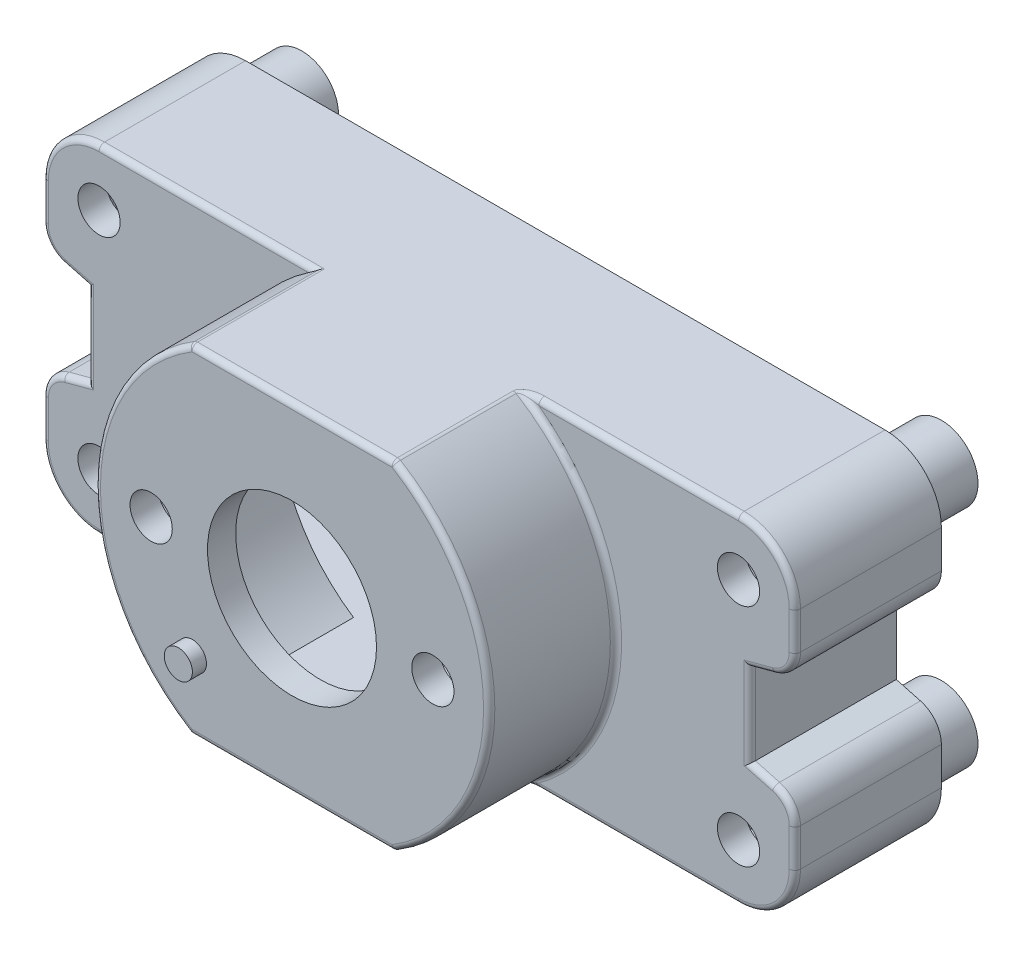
ISO-10303-21;
HEADER;
FILE_DESCRIPTION(('STEP AP214'),'2;1');
FILE_NAME('part.step','',(''),(''),'','','');
FILE_SCHEMA(('AUTOMOTIVE_DESIGN { 1 0 10303 214 1 1 1 1 }'));
ENDSEC;
DATA;
#1=APPLICATION_CONTEXT('core data for automotive mechanical design processes');
#2=APPLICATION_PROTOCOL_DEFINITION('international standard','automotive_design',2000,#1);
#3=PRODUCT_CONTEXT('',#1,'mechanical');
#4=PRODUCT('Part','Part','',(#3));
#5=PRODUCT_RELATED_PRODUCT_CATEGORY('part','',(#4));
#6=PRODUCT_DEFINITION_FORMATION('','',#4);
#7=PRODUCT_DEFINITION_CONTEXT('part definition',#1,'design');
#8=PRODUCT_DEFINITION('design','',#6,#7);
#9=PRODUCT_DEFINITION_SHAPE('','',#8);
#10=(LENGTH_UNIT() NAMED_UNIT(*) SI_UNIT(.MILLI.,.METRE.));
#11=(NAMED_UNIT(*) PLANE_ANGLE_UNIT() SI_UNIT($,.RADIAN.));
#12=(NAMED_UNIT(*) SI_UNIT($,.STERADIAN.) SOLID_ANGLE_UNIT());
#13=UNCERTAINTY_MEASURE_WITH_UNIT(LENGTH_MEASURE(1.E-05),#10,'distance_accuracy_value','');
#14=(GEOMETRIC_REPRESENTATION_CONTEXT(3) GLOBAL_UNCERTAINTY_ASSIGNED_CONTEXT((#13)) GLOBAL_UNIT_ASSIGNED_CONTEXT((#10,
#11,#12)) REPRESENTATION_CONTEXT('',''));
#15=CARTESIAN_POINT('',(0.,0.,0.));
#16=DIRECTION('',(0.,0.,1.));
#17=DIRECTION('',(1.,0.,0.));
#18=AXIS2_PLACEMENT_3D('',#15,#16,#17);
#19=CARTESIAN_POINT('',(0.,0.,9.7));
#20=DIRECTION('',(0.,0.,1.));
#21=DIRECTION('',(1.,0.,0.));
#22=AXIS2_PLACEMENT_3D('',#19,#20,#21);
#23=PLANE('',#22);
#24=CARTESIAN_POINT('',(0.,0.,9.7));
#25=DIRECTION('',(0.,0.,1.));
#26=DIRECTION('',(1.,0.,0.));
#27=AXIS2_PLACEMENT_3D('',#24,#25,#26);
#28=CIRCLE('',#27,6.8);
#29=CARTESIAN_POINT('',(3.54964786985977,-5.8,9.7));
#30=VERTEX_POINT('',#29);
#31=CARTESIAN_POINT('',(3.54964786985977,5.8,9.7));
#32=VERTEX_POINT('',#31);
#33=EDGE_CURVE('E803',#30,#32,#28,.T.);
#34=ORIENTED_EDGE('',*,*,#33,.T.);
#35=DIRECTION('',(-1.,0.,0.));
#36=VECTOR('',#35,1.);
#37=CARTESIAN_POINT('',(-3.60555127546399,5.8,9.7));
#38=LINE('',#37,#36);
#39=CARTESIAN_POINT('',(-3.54964786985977,5.8,9.7));
#40=VERTEX_POINT('',#39);
#41=EDGE_CURVE('E809',#32,#40,#38,.T.);
#42=ORIENTED_EDGE('',*,*,#41,.T.);
#43=CARTESIAN_POINT('',(0.,0.,9.7));
#44=DIRECTION('',(0.,0.,1.));
#45=DIRECTION('',(1.,0.,0.));
#46=AXIS2_PLACEMENT_3D('',#43,#44,#45);
#47=CIRCLE('',#46,6.8);
#48=CARTESIAN_POINT('',(-3.54964786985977,-5.8,9.7));
#49=VERTEX_POINT('',#48);
#50=EDGE_CURVE('E807',#40,#49,#47,.T.);
#51=ORIENTED_EDGE('',*,*,#50,.T.);
#52=DIRECTION('',(1.,0.,0.));
#53=VECTOR('',#52,1.);
#54=CARTESIAN_POINT('',(3.605551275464,-5.8,9.7));
#55=LINE('',#54,#53);
#56=EDGE_CURVE('E805',#49,#30,#55,.T.);
#57=ORIENTED_EDGE('',*,*,#56,.T.);
#58=EDGE_LOOP('',(#34,#42,#51,#57));
#59=FACE_BOUND('',#58,.T.);
#60=CARTESIAN_POINT('',(0.,0.,9.7));
#61=DIRECTION('',(0.,0.,1.));
#62=DIRECTION('',(1.,0.,0.));
#63=AXIS2_PLACEMENT_3D('',#60,#61,#62);
#64=CIRCLE('',#63,3.);
#65=CARTESIAN_POINT('',(3.,0.,9.7));
#66=VERTEX_POINT('',#65);
#67=EDGE_CURVE('E1463',#66,#66,#64,.T.);
#68=ORIENTED_EDGE('',*,*,#67,.F.);
#69=EDGE_LOOP('',(#68));
#70=FACE_BOUND('',#69,.T.);
#71=CARTESIAN_POINT('',(5.,0.,9.7));
#72=DIRECTION('',(0.,0.,1.));
#73=DIRECTION('',(1.,0.,0.));
#74=AXIS2_PLACEMENT_3D('',#71,#72,#73);
#75=CIRCLE('',#74,0.749999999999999);
#76=CARTESIAN_POINT('',(5.75,0.,9.7));
#77=VERTEX_POINT('',#76);
#78=EDGE_CURVE('E1486',#77,#77,#75,.T.);
#79=ORIENTED_EDGE('',*,*,#78,.F.);
#80=EDGE_LOOP('',(#79));
#81=FACE_BOUND('',#80,.T.);
#82=CARTESIAN_POINT('',(-5.,0.,9.7));
#83=DIRECTION('',(0.,0.,1.));
#84=DIRECTION('',(1.,0.,0.));
#85=AXIS2_PLACEMENT_3D('',#82,#83,#84);
#86=CIRCLE('',#85,0.749999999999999);
#87=CARTESIAN_POINT('',(-4.25,0.,9.7));
#88=VERTEX_POINT('',#87);
#89=EDGE_CURVE('E1487',#88,#88,#86,.T.);
#90=ORIENTED_EDGE('',*,*,#89,.F.);
#91=EDGE_LOOP('',(#90));
#92=FACE_BOUND('',#91,.T.);
#93=CARTESIAN_POINT('',(-3.53553390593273,-3.53553390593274,9.7));
#94=DIRECTION('',(0.,0.,1.));
#95=DIRECTION('',(1.,0.,0.));
#96=AXIS2_PLACEMENT_3D('',#93,#94,#95);
#97=CIRCLE('',#96,0.5);
#98=CARTESIAN_POINT('',(-3.03553390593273,-3.53553390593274,9.7));
#99=VERTEX_POINT('',#98);
#100=EDGE_CURVE('E2614',#99,#99,#97,.T.);
#101=ORIENTED_EDGE('',*,*,#100,.F.);
#102=EDGE_LOOP('',(#101));
#103=FACE_BOUND('',#102,.T.);
#104=ADVANCED_FACE('F33',(#59,#70,#81,#92,#103),#23,.T.);
#105=CARTESIAN_POINT('',(0.,0.,9.7));
#106=DIRECTION('',(0.,0.,-1.));
#107=DIRECTION('',(-1.,0.,0.));
#108=AXIS2_PLACEMENT_3D('',#105,#106,#107);
#109=CYLINDRICAL_SURFACE('',#108,6.);
#110=DIRECTION('',(0.,0.,-1.));
#111=VECTOR('',#110,1.);
#112=CARTESIAN_POINT('',(5.875,-1.21834929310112,21.9263940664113));
#113=LINE('',#112,#111);
#114=CARTESIAN_POINT('',(5.875,-1.21834929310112,8.7));
#115=VERTEX_POINT('',#114);
#116=CARTESIAN_POINT('',(5.875,-1.21834929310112,4.2));
#117=VERTEX_POINT('',#116);
#118=EDGE_CURVE('E1496',#115,#117,#113,.T.);
#119=ORIENTED_EDGE('',*,*,#118,.T.);
#120=CARTESIAN_POINT('',(0.,0.,4.2));
#121=DIRECTION('',(0.,0.,1.));
#122=DIRECTION('',(1.,0.,0.));
#123=AXIS2_PLACEMENT_3D('',#120,#121,#122);
#124=CIRCLE('',#123,6.);
#125=CARTESIAN_POINT('',(3.3166247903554,-5.,4.2));
#126=VERTEX_POINT('',#125);
#127=EDGE_CURVE('E629',#126,#117,#124,.T.);
#128=ORIENTED_EDGE('',*,*,#127,.F.);
#129=DIRECTION('',(0.,0.,-1.));
#130=VECTOR('',#129,1.);
#131=CARTESIAN_POINT('',(3.3166247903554,-5.,8.7));
#132=LINE('',#131,#130);
#133=CARTESIAN_POINT('',(3.3166247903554,-5.,8.7));
#134=VERTEX_POINT('',#133);
#135=EDGE_CURVE('E1583',#134,#126,#132,.T.);
#136=ORIENTED_EDGE('',*,*,#135,.F.);
#137=CARTESIAN_POINT('',(0.,0.,8.7));
#138=DIRECTION('',(0.,0.,1.));
#139=DIRECTION('',(1.,0.,0.));
#140=AXIS2_PLACEMENT_3D('',#137,#138,#139);
#141=CIRCLE('',#140,6.);
#142=EDGE_CURVE('E638',#134,#115,#141,.T.);
#143=ORIENTED_EDGE('',*,*,#142,.T.);
#144=EDGE_LOOP('',(#119,#128,#136,#143));
#145=FACE_BOUND('',#144,.T.);
#146=ADVANCED_FACE('F1169',(#145),#109,.F.);
#147=CARTESIAN_POINT('',(0.,0.,9.7));
#148=DIRECTION('',(0.,0.,-1.));
#149=DIRECTION('',(-1.,0.,0.));
#150=AXIS2_PLACEMENT_3D('',#147,#148,#149);
#151=CYLINDRICAL_SURFACE('',#150,6.);
#152=DIRECTION('',(0.,0.,-1.));
#153=VECTOR('',#152,1.);
#154=CARTESIAN_POINT('',(-5.87499999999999,-1.21834929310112,21.9263940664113));
#155=LINE('',#154,#153);
#156=CARTESIAN_POINT('',(-5.87499999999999,-1.21834929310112,8.7));
#157=VERTEX_POINT('',#156);
#158=CARTESIAN_POINT('',(-5.87499999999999,-1.21834929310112,4.2));
#159=VERTEX_POINT('',#158);
#160=EDGE_CURVE('E604',#157,#159,#155,.T.);
#161=ORIENTED_EDGE('',*,*,#160,.F.);
#162=CARTESIAN_POINT('',(0.,0.,8.7));
#163=DIRECTION('',(0.,0.,1.));
#164=DIRECTION('',(1.,0.,0.));
#165=AXIS2_PLACEMENT_3D('',#162,#163,#164);
#166=CIRCLE('',#165,6.);
#167=CARTESIAN_POINT('',(-3.3166247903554,-5.,8.7));
#168=VERTEX_POINT('',#167);
#169=EDGE_CURVE('E617',#157,#168,#166,.T.);
#170=ORIENTED_EDGE('',*,*,#169,.T.);
#171=DIRECTION('',(0.,0.,-1.));
#172=VECTOR('',#171,1.);
#173=CARTESIAN_POINT('',(-3.3166247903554,-5.,8.7));
#174=LINE('',#173,#172);
#175=CARTESIAN_POINT('',(-3.3166247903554,-5.,4.2));
#176=VERTEX_POINT('',#175);
#177=EDGE_CURVE('E657',#168,#176,#174,.T.);
#178=ORIENTED_EDGE('',*,*,#177,.T.);
#179=CARTESIAN_POINT('',(0.,0.,4.2));
#180=DIRECTION('',(0.,0.,1.));
#181=DIRECTION('',(1.,0.,0.));
#182=AXIS2_PLACEMENT_3D('',#179,#180,#181);
#183=CIRCLE('',#182,6.);
#184=EDGE_CURVE('E619',#159,#176,#183,.T.);
#185=ORIENTED_EDGE('',*,*,#184,.F.);
#186=EDGE_LOOP('',(#161,#170,#178,#185));
#187=FACE_BOUND('',#186,.T.);
#188=ADVANCED_FACE('F615',(#187),#151,.F.);
#189=CARTESIAN_POINT('',(11.35,4.,0.));
#190=DIRECTION('',(0.,0.,1.));
#191=DIRECTION('',(1.,0.,0.));
#192=AXIS2_PLACEMENT_3D('',#189,#190,#191);
#193=PLANE('',#192);
#194=CARTESIAN_POINT('',(-11.35,-4.,0.));
#195=DIRECTION('',(0.,0.,1.));
#196=DIRECTION('',(1.,0.,0.));
#197=AXIS2_PLACEMENT_3D('',#194,#195,#196);
#198=CIRCLE('',#197,1.3);
#199=CARTESIAN_POINT('',(-10.05,-4.,0.));
#200=VERTEX_POINT('',#199);
#201=EDGE_CURVE('E1455',#200,#200,#198,.F.);
#202=ORIENTED_EDGE('',*,*,#201,.F.);
#203=EDGE_LOOP('',(#202));
#204=FACE_BOUND('',#203,.T.);
#205=CARTESIAN_POINT('',(11.35,-4.,0.));
#206=DIRECTION('',(0.,0.,1.));
#207=DIRECTION('',(1.,0.,0.));
#208=AXIS2_PLACEMENT_3D('',#205,#206,#207);
#209=CIRCLE('',#208,1.3);
#210=CARTESIAN_POINT('',(12.65,-4.,0.));
#211=VERTEX_POINT('',#210);
#212=EDGE_CURVE('E1449',#211,#211,#209,.F.);
#213=ORIENTED_EDGE('',*,*,#212,.F.);
#214=EDGE_LOOP('',(#213));
#215=FACE_BOUND('',#214,.T.);
#216=CARTESIAN_POINT('',(11.35,4.,0.));
#217=DIRECTION('',(0.,0.,1.));
#218=DIRECTION('',(1.,0.,0.));
#219=AXIS2_PLACEMENT_3D('',#216,#217,#218);
#220=CIRCLE('',#219,2.);
#221=CARTESIAN_POINT('',(13.35,3.99999999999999,0.));
#222=VERTEX_POINT('',#221);
#223=CARTESIAN_POINT('',(11.35,6.,0.));
#224=VERTEX_POINT('',#223);
#225=EDGE_CURVE('E2426',#222,#224,#220,.T.);
#226=ORIENTED_EDGE('',*,*,#225,.F.);
#227=DIRECTION('',(0.,1.,0.));
#228=VECTOR('',#227,1.);
#229=CARTESIAN_POINT('',(13.35,2.66732698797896,0.));
#230=LINE('',#229,#228);
#231=CARTESIAN_POINT('',(13.35,2.66732698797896,0.));
#232=VERTEX_POINT('',#231);
#233=EDGE_CURVE('E2552',#232,#222,#230,.T.);
#234=ORIENTED_EDGE('',*,*,#233,.F.);
#235=CARTESIAN_POINT('',(12.35,2.66732698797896,0.));
#236=DIRECTION('',(0.,0.,1.));
#237=DIRECTION('',(-1.,0.,0.));
#238=AXIS2_PLACEMENT_3D('',#235,#236,#237);
#239=CIRCLE('',#238,1.);
#240=CARTESIAN_POINT('',(12.6088190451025,1.70140116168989,0.));
#241=VERTEX_POINT('',#240);
#242=EDGE_CURVE('E2549',#241,#232,#239,.T.);
#243=ORIENTED_EDGE('',*,*,#242,.F.);
#244=DIRECTION('',(0.965925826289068,0.258819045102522,0.));
#245=VECTOR('',#244,1.);
#246=CARTESIAN_POINT('',(11.75,1.4712812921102,0.));
#247=LINE('',#246,#245);
#248=CARTESIAN_POINT('',(11.75,1.4712812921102,0.));
#249=VERTEX_POINT('',#248);
#250=EDGE_CURVE('E2546',#249,#241,#247,.T.);
#251=ORIENTED_EDGE('',*,*,#250,.F.);
#252=DIRECTION('',(0.,1.,0.));
#253=VECTOR('',#252,1.);
#254=CARTESIAN_POINT('',(11.75,-1.4712812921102,0.));
#255=LINE('',#254,#253);
#256=CARTESIAN_POINT('',(11.75,-1.4712812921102,0.));
#257=VERTEX_POINT('',#256);
#258=EDGE_CURVE('E2543',#257,#249,#255,.T.);
#259=ORIENTED_EDGE('',*,*,#258,.F.);
#260=DIRECTION('',(-0.965925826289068,0.258819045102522,0.));
#261=VECTOR('',#260,1.);
#262=CARTESIAN_POINT('',(12.6088190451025,-1.70140116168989,0.));
#263=LINE('',#262,#261);
#264=CARTESIAN_POINT('',(12.6088190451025,-1.70140116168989,0.));
#265=VERTEX_POINT('',#264);
#266=EDGE_CURVE('E2540',#265,#257,#263,.T.);
#267=ORIENTED_EDGE('',*,*,#266,.F.);
#268=CARTESIAN_POINT('',(12.35,-2.66732698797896,0.));
#269=DIRECTION('',(0.,0.,1.));
#270=DIRECTION('',(1.,0.,0.));
#271=AXIS2_PLACEMENT_3D('',#268,#269,#270);
#272=CIRCLE('',#271,1.);
#273=CARTESIAN_POINT('',(13.35,-2.66732698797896,0.));
#274=VERTEX_POINT('',#273);
#275=EDGE_CURVE('E2537',#274,#265,#272,.T.);
#276=ORIENTED_EDGE('',*,*,#275,.F.);
#277=DIRECTION('',(0.,1.,0.));
#278=VECTOR('',#277,1.);
#279=CARTESIAN_POINT('',(13.35,-3.99999999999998,0.));
#280=LINE('',#279,#278);
#281=CARTESIAN_POINT('',(13.35,-3.99999999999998,0.));
#282=VERTEX_POINT('',#281);
#283=EDGE_CURVE('E2534',#282,#274,#280,.T.);
#284=ORIENTED_EDGE('',*,*,#283,.F.);
#285=CARTESIAN_POINT('',(11.35,-4.,0.));
#286=DIRECTION('',(0.,0.,1.));
#287=DIRECTION('',(1.,0.,0.));
#288=AXIS2_PLACEMENT_3D('',#285,#286,#287);
#289=CIRCLE('',#288,2.);
#290=CARTESIAN_POINT('',(11.35,-6.,0.));
#291=VERTEX_POINT('',#290);
#292=EDGE_CURVE('E2531',#291,#282,#289,.T.);
#293=ORIENTED_EDGE('',*,*,#292,.F.);
#294=DIRECTION('',(1.,0.,0.));
#295=VECTOR('',#294,1.);
#296=CARTESIAN_POINT('',(-11.35,-6.,0.));
#297=LINE('',#296,#295);
#298=CARTESIAN_POINT('',(-11.35,-6.,0.));
#299=VERTEX_POINT('',#298);
#300=EDGE_CURVE('E2528',#299,#291,#297,.T.);
#301=ORIENTED_EDGE('',*,*,#300,.F.);
#302=CARTESIAN_POINT('',(-11.35,-4.,0.));
#303=DIRECTION('',(0.,0.,1.));
#304=DIRECTION('',(1.,0.,0.));
#305=AXIS2_PLACEMENT_3D('',#302,#303,#304);
#306=CIRCLE('',#305,2.);
#307=CARTESIAN_POINT('',(-13.35,-3.99999999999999,0.));
#308=VERTEX_POINT('',#307);
#309=EDGE_CURVE('E2526',#308,#299,#306,.T.);
#310=ORIENTED_EDGE('',*,*,#309,.F.);
#311=DIRECTION('',(0.,-1.,0.));
#312=VECTOR('',#311,1.);
#313=CARTESIAN_POINT('',(-13.35,-2.66732698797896,0.));
#314=LINE('',#313,#312);
#315=CARTESIAN_POINT('',(-13.35,-2.66732698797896,0.));
#316=VERTEX_POINT('',#315);
#317=EDGE_CURVE('E1410',#316,#308,#314,.T.);
#318=ORIENTED_EDGE('',*,*,#317,.F.);
#319=CARTESIAN_POINT('',(-12.35,-2.66732698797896,0.));
#320=DIRECTION('',(0.,0.,1.));
#321=DIRECTION('',(-1.,0.,0.));
#322=AXIS2_PLACEMENT_3D('',#319,#320,#321);
#323=CIRCLE('',#322,1.);
#324=CARTESIAN_POINT('',(-12.6088190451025,-1.70140116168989,0.));
#325=VERTEX_POINT('',#324);
#326=EDGE_CURVE('E2523',#325,#316,#323,.T.);
#327=ORIENTED_EDGE('',*,*,#326,.F.);
#328=DIRECTION('',(-0.965925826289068,-0.258819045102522,0.));
#329=VECTOR('',#328,1.);
#330=CARTESIAN_POINT('',(-11.75,-1.4712812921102,0.));
#331=LINE('',#330,#329);
#332=CARTESIAN_POINT('',(-11.75,-1.4712812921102,0.));
#333=VERTEX_POINT('',#332);
#334=EDGE_CURVE('E1427',#333,#325,#331,.T.);
#335=ORIENTED_EDGE('',*,*,#334,.F.);
#336=DIRECTION('',(0.,-1.,0.));
#337=VECTOR('',#336,1.);
#338=CARTESIAN_POINT('',(-11.75,1.4712812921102,0.));
#339=LINE('',#338,#337);
#340=CARTESIAN_POINT('',(-11.75,1.4712812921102,0.));
#341=VERTEX_POINT('',#340);
#342=EDGE_CURVE('E2519',#341,#333,#339,.T.);
#343=ORIENTED_EDGE('',*,*,#342,.F.);
#344=DIRECTION('',(0.965925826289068,-0.258819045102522,0.));
#345=VECTOR('',#344,1.);
#346=CARTESIAN_POINT('',(-12.6088190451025,1.70140116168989,0.));
#347=LINE('',#346,#345);
#348=CARTESIAN_POINT('',(-12.6088190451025,1.70140116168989,0.));
#349=VERTEX_POINT('',#348);
#350=EDGE_CURVE('E2516',#349,#341,#347,.T.);
#351=ORIENTED_EDGE('',*,*,#350,.F.);
#352=CARTESIAN_POINT('',(-12.35,2.66732698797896,0.));
#353=DIRECTION('',(0.,0.,1.));
#354=DIRECTION('',(1.,0.,0.));
#355=AXIS2_PLACEMENT_3D('',#352,#353,#354);
#356=CIRCLE('',#355,1.);
#357=CARTESIAN_POINT('',(-13.35,2.66732698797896,0.));
#358=VERTEX_POINT('',#357);
#359=EDGE_CURVE('E2513',#358,#349,#356,.T.);
#360=ORIENTED_EDGE('',*,*,#359,.F.);
#361=DIRECTION('',(0.,-1.,0.));
#362=VECTOR('',#361,1.);
#363=CARTESIAN_POINT('',(-13.35,3.99999999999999,0.));
#364=LINE('',#363,#362);
#365=CARTESIAN_POINT('',(-13.35,3.99999999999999,0.));
#366=VERTEX_POINT('',#365);
#367=EDGE_CURVE('E2510',#366,#358,#364,.T.);
#368=ORIENTED_EDGE('',*,*,#367,.F.);
#369=CARTESIAN_POINT('',(-11.35,4.,0.));
#370=DIRECTION('',(0.,0.,1.));
#371=DIRECTION('',(1.,0.,0.));
#372=AXIS2_PLACEMENT_3D('',#369,#370,#371);
#373=CIRCLE('',#372,2.);
#374=CARTESIAN_POINT('',(-11.35,6.,0.));
#375=VERTEX_POINT('',#374);
#376=EDGE_CURVE('E2507',#375,#366,#373,.T.);
#377=ORIENTED_EDGE('',*,*,#376,.F.);
#378=DIRECTION('',(-1.,0.,0.));
#379=VECTOR('',#378,1.);
#380=CARTESIAN_POINT('',(11.35,6.,0.));
#381=LINE('',#380,#379);
#382=EDGE_CURVE('E2504',#224,#375,#381,.T.);
#383=ORIENTED_EDGE('',*,*,#382,.F.);
#384=EDGE_LOOP('',(#226,#234,#243,#251,#259,#267,#276,#284,#293,#301,#310,#318,#327,#335,#343,
#351,#360,#368,#377,#383));
#385=FACE_BOUND('',#384,.T.);
#386=CARTESIAN_POINT('',(-11.25,-3.9,0.));
#387=DIRECTION('',(0.,0.,-1.));
#388=DIRECTION('',(1.,0.,0.));
#389=AXIS2_PLACEMENT_3D('',#386,#387,#388);
#390=CIRCLE('',#389,2.);
#391=CARTESIAN_POINT('',(-10.75,-1.96350832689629,0.));
#392=VERTEX_POINT('',#391);
#393=CARTESIAN_POINT('',(-9.25,-3.90000000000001,0.));
#394=VERTEX_POINT('',#393);
#395=EDGE_CURVE('E2432',#392,#394,#390,.T.);
#396=ORIENTED_EDGE('',*,*,#395,.T.);
#397=DIRECTION('',(0.,-1.,0.));
#398=VECTOR('',#397,1.);
#399=CARTESIAN_POINT('',(-9.25,-3.90000000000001,0.));
#400=LINE('',#399,#398);
#401=CARTESIAN_POINT('',(-9.25,-4.99999999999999,0.));
#402=VERTEX_POINT('',#401);
#403=EDGE_CURVE('E2440',#394,#402,#400,.T.);
#404=ORIENTED_EDGE('',*,*,#403,.T.);
#405=DIRECTION('',(1.,0.,0.));
#406=VECTOR('',#405,1.);
#407=CARTESIAN_POINT('',(-9.25,-4.99999999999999,0.));
#408=LINE('',#407,#406);
#409=CARTESIAN_POINT('',(9.25,-4.99999999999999,0.));
#410=VERTEX_POINT('',#409);
#411=EDGE_CURVE('E2447',#402,#410,#408,.T.);
#412=ORIENTED_EDGE('',*,*,#411,.T.);
#413=DIRECTION('',(0.,1.,0.));
#414=VECTOR('',#413,1.);
#415=CARTESIAN_POINT('',(9.25,-3.90000000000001,0.));
#416=LINE('',#415,#414);
#417=CARTESIAN_POINT('',(9.25,-3.90000000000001,0.));
#418=VERTEX_POINT('',#417);
#419=EDGE_CURVE('E2455',#410,#418,#416,.T.);
#420=ORIENTED_EDGE('',*,*,#419,.T.);
#421=CARTESIAN_POINT('',(11.25,-3.9,0.));
#422=DIRECTION('',(0.,0.,-1.));
#423=DIRECTION('',(1.,0.,0.));
#424=AXIS2_PLACEMENT_3D('',#421,#422,#423);
#425=CIRCLE('',#424,2.);
#426=CARTESIAN_POINT('',(10.75,-1.96350832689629,0.));
#427=VERTEX_POINT('',#426);
#428=EDGE_CURVE('E2458',#418,#427,#425,.T.);
#429=ORIENTED_EDGE('',*,*,#428,.T.);
#430=DIRECTION('',(0.,1.,0.));
#431=VECTOR('',#430,1.);
#432=CARTESIAN_POINT('',(10.75,1.96350832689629,0.));
#433=LINE('',#432,#431);
#434=CARTESIAN_POINT('',(10.75,1.96350832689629,0.));
#435=VERTEX_POINT('',#434);
#436=EDGE_CURVE('E2461',#427,#435,#433,.T.);
#437=ORIENTED_EDGE('',*,*,#436,.T.);
#438=CARTESIAN_POINT('',(11.25,3.9,0.));
#439=DIRECTION('',(0.,0.,-1.));
#440=DIRECTION('',(1.,0.,0.));
#441=AXIS2_PLACEMENT_3D('',#438,#439,#440);
#442=CIRCLE('',#441,2.);
#443=CARTESIAN_POINT('',(9.25,3.90000000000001,0.));
#444=VERTEX_POINT('',#443);
#445=EDGE_CURVE('E2464',#435,#444,#442,.T.);
#446=ORIENTED_EDGE('',*,*,#445,.T.);
#447=DIRECTION('',(0.,1.,0.));
#448=VECTOR('',#447,1.);
#449=CARTESIAN_POINT('',(9.25,3.90000000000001,0.));
#450=LINE('',#449,#448);
#451=CARTESIAN_POINT('',(9.25,4.99999999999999,0.));
#452=VERTEX_POINT('',#451);
#453=EDGE_CURVE('E2467',#444,#452,#450,.T.);
#454=ORIENTED_EDGE('',*,*,#453,.T.);
#455=DIRECTION('',(-1.,0.,0.));
#456=VECTOR('',#455,1.);
#457=CARTESIAN_POINT('',(-9.25,4.99999999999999,0.));
#458=LINE('',#457,#456);
#459=CARTESIAN_POINT('',(-9.25,4.99999999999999,0.));
#460=VERTEX_POINT('',#459);
#461=EDGE_CURVE('E2470',#452,#460,#458,.T.);
#462=ORIENTED_EDGE('',*,*,#461,.T.);
#463=DIRECTION('',(0.,-1.,0.));
#464=VECTOR('',#463,1.);
#465=CARTESIAN_POINT('',(-9.25,3.90000000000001,0.));
#466=LINE('',#465,#464);
#467=CARTESIAN_POINT('',(-9.25,3.90000000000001,0.));
#468=VERTEX_POINT('',#467);
#469=EDGE_CURVE('E2473',#460,#468,#466,.T.);
#470=ORIENTED_EDGE('',*,*,#469,.T.);
#471=CARTESIAN_POINT('',(-11.25,3.9,0.));
#472=DIRECTION('',(0.,0.,-1.));
#473=DIRECTION('',(1.,0.,0.));
#474=AXIS2_PLACEMENT_3D('',#471,#472,#473);
#475=CIRCLE('',#474,2.);
#476=CARTESIAN_POINT('',(-10.75,1.96350832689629,0.));
#477=VERTEX_POINT('',#476);
#478=EDGE_CURVE('E2476',#468,#477,#475,.T.);
#479=ORIENTED_EDGE('',*,*,#478,.T.);
#480=DIRECTION('',(0.,-1.,0.));
#481=VECTOR('',#480,1.);
#482=CARTESIAN_POINT('',(-10.75,1.96350832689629,0.));
#483=LINE('',#482,#481);
#484=EDGE_CURVE('E2443',#477,#392,#483,.T.);
#485=ORIENTED_EDGE('',*,*,#484,.T.);
#486=EDGE_LOOP('',(#396,#404,#412,#420,#429,#437,#446,#454,#462,#470,#479,#485));
#487=FACE_BOUND('',#486,.T.);
#488=CARTESIAN_POINT('',(11.35,4.,0.));
#489=DIRECTION('',(0.,0.,1.));
#490=DIRECTION('',(1.,0.,0.));
#491=AXIS2_PLACEMENT_3D('',#488,#489,#490);
#492=CIRCLE('',#491,1.3);
#493=CARTESIAN_POINT('',(12.65,4.,0.));
#494=VERTEX_POINT('',#493);
#495=EDGE_CURVE('E1452',#494,#494,#492,.F.);
#496=ORIENTED_EDGE('',*,*,#495,.F.);
#497=EDGE_LOOP('',(#496));
#498=FACE_BOUND('',#497,.T.);
#499=CARTESIAN_POINT('',(-11.35,4.,0.));
#500=DIRECTION('',(0.,0.,1.));
#501=DIRECTION('',(1.,0.,0.));
#502=AXIS2_PLACEMENT_3D('',#499,#500,#501);
#503=CIRCLE('',#502,1.3);
#504=CARTESIAN_POINT('',(-10.05,4.,0.));
#505=VERTEX_POINT('',#504);
#506=EDGE_CURVE('E705',#505,#505,#503,.F.);
#507=ORIENTED_EDGE('',*,*,#506,.F.);
#508=EDGE_LOOP('',(#507));
#509=FACE_BOUND('',#508,.T.);
#510=ADVANCED_FACE('F1978',(#204,#215,#385,#487,#498,#509),#193,.F.);
#511=CARTESIAN_POINT('',(11.35,4.,4.2));
#512=DIRECTION('',(0.,0.,1.));
#513=DIRECTION('',(1.,0.,0.));
#514=AXIS2_PLACEMENT_3D('',#511,#512,#513);
#515=PLANE('',#514);
#516=ORIENTED_EDGE('',*,*,#127,.T.);
#517=CARTESIAN_POINT('',(5.,0.,4.2));
#518=DIRECTION('',(0.,0.,-1.));
#519=DIRECTION('',(-1.,0.,0.));
#520=AXIS2_PLACEMENT_3D('',#517,#518,#519);
#521=CIRCLE('',#520,1.5);
#522=CARTESIAN_POINT('',(5.875,1.21834929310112,4.2));
#523=VERTEX_POINT('',#522);
#524=EDGE_CURVE('E2620',#523,#117,#521,.T.);
#525=ORIENTED_EDGE('',*,*,#524,.F.);
#526=CARTESIAN_POINT('',(3.31662479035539,5.,4.2));
#527=VERTEX_POINT('',#526);
#528=EDGE_CURVE('E632',#523,#527,#124,.T.);
#529=ORIENTED_EDGE('',*,*,#528,.T.);
#530=DIRECTION('',(-1.,0.,0.));
#531=VECTOR('',#530,1.);
#532=CARTESIAN_POINT('',(-9.25,4.99999999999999,4.2));
#533=LINE('',#532,#531);
#534=CARTESIAN_POINT('',(9.25,4.99999999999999,4.2));
#535=VERTEX_POINT('',#534);
#536=EDGE_CURVE('E2635',#535,#527,#533,.T.);
#537=ORIENTED_EDGE('',*,*,#536,.F.);
#538=DIRECTION('',(0.,1.,0.));
#539=VECTOR('',#538,1.);
#540=CARTESIAN_POINT('',(9.25,3.90000000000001,4.2));
#541=LINE('',#540,#539);
#542=CARTESIAN_POINT('',(9.25,3.90000000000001,4.2));
#543=VERTEX_POINT('',#542);
#544=EDGE_CURVE('E2638',#543,#535,#541,.T.);
#545=ORIENTED_EDGE('',*,*,#544,.F.);
#546=CARTESIAN_POINT('',(11.25,3.9,4.2));
#547=DIRECTION('',(0.,0.,1.));
#548=DIRECTION('',(1.,0.,0.));
#549=AXIS2_PLACEMENT_3D('',#546,#547,#548);
#550=CIRCLE('',#549,2.);
#551=CARTESIAN_POINT('',(10.75,1.96350832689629,4.2));
#552=VERTEX_POINT('',#551);
#553=EDGE_CURVE('E2642',#552,#543,#550,.F.);
#554=ORIENTED_EDGE('',*,*,#553,.F.);
#555=DIRECTION('',(0.,1.,0.));
#556=VECTOR('',#555,1.);
#557=CARTESIAN_POINT('',(10.75,1.96350832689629,4.2));
#558=LINE('',#557,#556);
#559=CARTESIAN_POINT('',(10.75,-1.96350832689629,4.2));
#560=VERTEX_POINT('',#559);
#561=EDGE_CURVE('E2645',#560,#552,#558,.T.);
#562=ORIENTED_EDGE('',*,*,#561,.F.);
#563=CARTESIAN_POINT('',(11.25,-3.9,4.2));
#564=DIRECTION('',(0.,0.,1.));
#565=DIRECTION('',(1.,0.,0.));
#566=AXIS2_PLACEMENT_3D('',#563,#564,#565);
#567=CIRCLE('',#566,2.);
#568=CARTESIAN_POINT('',(9.25,-3.90000000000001,4.2));
#569=VERTEX_POINT('',#568);
#570=EDGE_CURVE('E2648',#569,#560,#567,.F.);
#571=ORIENTED_EDGE('',*,*,#570,.F.);
#572=DIRECTION('',(0.,1.,0.));
#573=VECTOR('',#572,1.);
#574=CARTESIAN_POINT('',(9.25,-3.90000000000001,4.2));
#575=LINE('',#574,#573);
#576=CARTESIAN_POINT('',(9.25,-4.99999999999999,4.2));
#577=VERTEX_POINT('',#576);
#578=EDGE_CURVE('E2651',#577,#569,#575,.T.);
#579=ORIENTED_EDGE('',*,*,#578,.F.);
#580=DIRECTION('',(1.,0.,0.));
#581=VECTOR('',#580,1.);
#582=CARTESIAN_POINT('',(-9.25,-4.99999999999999,4.2));
#583=LINE('',#582,#581);
#584=EDGE_CURVE('E2654',#126,#577,#583,.T.);
#585=ORIENTED_EDGE('',*,*,#584,.F.);
#586=EDGE_LOOP('',(#516,#525,#529,#537,#545,#554,#562,#571,#579,#585));
#587=FACE_BOUND('',#586,.T.);
#588=ADVANCED_FACE('F1983',(#587),#515,.F.);
#589=CARTESIAN_POINT('',(11.35,4.,5.2));
#590=DIRECTION('',(0.,0.,1.));
#591=DIRECTION('',(1.,0.,0.));
#592=AXIS2_PLACEMENT_3D('',#589,#590,#591);
#593=PLANE('',#592);
#594=CARTESIAN_POINT('',(-11.35,4.,5.2));
#595=DIRECTION('',(0.,0.,1.));
#596=DIRECTION('',(1.,0.,0.));
#597=AXIS2_PLACEMENT_3D('',#594,#595,#596);
#598=CIRCLE('',#597,0.75);
#599=CARTESIAN_POINT('',(-10.6,4.,5.2));
#600=VERTEX_POINT('',#599);
#601=EDGE_CURVE('E1503',#600,#600,#598,.T.);
#602=ORIENTED_EDGE('',*,*,#601,.F.);
#603=EDGE_LOOP('',(#602));
#604=FACE_BOUND('',#603,.T.);
#605=CARTESIAN_POINT('',(-11.35,-4.,5.2));
#606=DIRECTION('',(0.,0.,1.));
#607=DIRECTION('',(1.,0.,0.));
#608=AXIS2_PLACEMENT_3D('',#605,#606,#607);
#609=CIRCLE('',#608,0.75);
#610=CARTESIAN_POINT('',(-10.6,-4.,5.2));
#611=VERTEX_POINT('',#610);
#612=EDGE_CURVE('E1510',#611,#611,#609,.T.);
#613=ORIENTED_EDGE('',*,*,#612,.F.);
#614=EDGE_LOOP('',(#613));
#615=FACE_BOUND('',#614,.T.);
#616=CARTESIAN_POINT('',(0.,0.,5.2));
#617=DIRECTION('',(0.,0.,1.));
#618=DIRECTION('',(1.,0.,0.));
#619=AXIS2_PLACEMENT_3D('',#616,#617,#618);
#620=CIRCLE('',#619,7.);
#621=CARTESIAN_POINT('',(-3.91918358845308,5.8,5.2));
#622=VERTEX_POINT('',#621);
#623=CARTESIAN_POINT('',(-3.91918358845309,-5.8,5.2));
#624=VERTEX_POINT('',#623);
#625=EDGE_CURVE('E691',#622,#624,#620,.T.);
#626=ORIENTED_EDGE('',*,*,#625,.F.);
#627=DIRECTION('',(-1.,0.,0.));
#628=VECTOR('',#627,1.);
#629=CARTESIAN_POINT('',(-11.35,5.8,5.2));
#630=LINE('',#629,#628);
#631=CARTESIAN_POINT('',(-11.35,5.8,5.2));
#632=VERTEX_POINT('',#631);
#633=EDGE_CURVE('E723',#622,#632,#630,.T.);
#634=ORIENTED_EDGE('',*,*,#633,.T.);
#635=CARTESIAN_POINT('',(-11.35,4.,5.2));
#636=DIRECTION('',(0.,0.,1.));
#637=DIRECTION('',(1.,0.,0.));
#638=AXIS2_PLACEMENT_3D('',#635,#636,#637);
#639=CIRCLE('',#638,1.8);
#640=CARTESIAN_POINT('',(-13.15,3.99999999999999,5.2));
#641=VERTEX_POINT('',#640);
#642=EDGE_CURVE('E721',#632,#641,#639,.T.);
#643=ORIENTED_EDGE('',*,*,#642,.T.);
#644=DIRECTION('',(0.,-1.,0.));
#645=VECTOR('',#644,1.);
#646=CARTESIAN_POINT('',(-13.15,2.66732698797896,5.2));
#647=LINE('',#646,#645);
#648=CARTESIAN_POINT('',(-13.15,2.66732698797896,5.2));
#649=VERTEX_POINT('',#648);
#650=EDGE_CURVE('E719',#641,#649,#647,.T.);
#651=ORIENTED_EDGE('',*,*,#650,.T.);
#652=CARTESIAN_POINT('',(-12.35,2.66732698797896,5.2));
#653=DIRECTION('',(0.,0.,1.));
#654=DIRECTION('',(1.,0.,0.));
#655=AXIS2_PLACEMENT_3D('',#652,#653,#654);
#656=CIRCLE('',#655,0.8);
#657=CARTESIAN_POINT('',(-12.557055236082,1.8945863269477,5.2));
#658=VERTEX_POINT('',#657);
#659=EDGE_CURVE('E717',#649,#658,#656,.T.);
#660=ORIENTED_EDGE('',*,*,#659,.T.);
#661=DIRECTION('',(0.965925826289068,-0.258819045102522,0.));
#662=VECTOR('',#661,1.);
#663=CARTESIAN_POINT('',(-11.6982361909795,1.66446645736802,5.2));
#664=LINE('',#663,#662);
#665=CARTESIAN_POINT('',(-11.55,1.62474668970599,5.2));
#666=VERTEX_POINT('',#665);
#667=EDGE_CURVE('E715',#658,#666,#664,.T.);
#668=ORIENTED_EDGE('',*,*,#667,.T.);
#669=DIRECTION('',(0.,-1.,0.));
#670=VECTOR('',#669,1.);
#671=CARTESIAN_POINT('',(-11.55,-1.4712812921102,5.2));
#672=LINE('',#671,#670);
#673=CARTESIAN_POINT('',(-11.55,-1.62474668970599,5.2));
#674=VERTEX_POINT('',#673);
#675=EDGE_CURVE('E713',#666,#674,#672,.T.);
#676=ORIENTED_EDGE('',*,*,#675,.T.);
#677=DIRECTION('',(-0.965925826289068,-0.258819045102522,0.));
#678=VECTOR('',#677,1.);
#679=CARTESIAN_POINT('',(-12.557055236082,-1.8945863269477,5.2));
#680=LINE('',#679,#678);
#681=CARTESIAN_POINT('',(-12.557055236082,-1.8945863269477,5.2));
#682=VERTEX_POINT('',#681);
#683=EDGE_CURVE('E711',#674,#682,#680,.T.);
#684=ORIENTED_EDGE('',*,*,#683,.T.);
#685=CARTESIAN_POINT('',(-12.35,-2.66732698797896,5.2));
#686=DIRECTION('',(0.,0.,1.));
#687=DIRECTION('',(1.,0.,0.));
#688=AXIS2_PLACEMENT_3D('',#685,#686,#687);
#689=CIRCLE('',#688,0.8);
#690=CARTESIAN_POINT('',(-13.15,-2.66732698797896,5.2));
#691=VERTEX_POINT('',#690);
#692=EDGE_CURVE('E709',#682,#691,#689,.T.);
#693=ORIENTED_EDGE('',*,*,#692,.T.);
#694=DIRECTION('',(0.,-1.,0.));
#695=VECTOR('',#694,1.);
#696=CARTESIAN_POINT('',(-13.15,-3.99999999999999,5.2));
#697=LINE('',#696,#695);
#698=CARTESIAN_POINT('',(-13.15,-3.99999999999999,5.2));
#699=VERTEX_POINT('',#698);
#700=EDGE_CURVE('E707',#691,#699,#697,.T.);
#701=ORIENTED_EDGE('',*,*,#700,.T.);
#702=CARTESIAN_POINT('',(-11.35,-4.,5.2));
#703=DIRECTION('',(0.,0.,1.));
#704=DIRECTION('',(1.,0.,0.));
#705=AXIS2_PLACEMENT_3D('',#702,#703,#704);
#706=CIRCLE('',#705,1.8);
#707=CARTESIAN_POINT('',(-11.35,-5.8,5.2));
#708=VERTEX_POINT('',#707);
#709=EDGE_CURVE('E704',#699,#708,#706,.T.);
#710=ORIENTED_EDGE('',*,*,#709,.T.);
#711=DIRECTION('',(1.,0.,0.));
#712=VECTOR('',#711,1.);
#713=CARTESIAN_POINT('',(-3.60555127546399,-5.8,5.2));
#714=LINE('',#713,#712);
#715=EDGE_CURVE('E702',#708,#624,#714,.T.);
#716=ORIENTED_EDGE('',*,*,#715,.T.);
#717=EDGE_LOOP('',(#626,#634,#643,#651,#660,#668,#676,#684,#693,#701,#710,#716));
#718=FACE_BOUND('',#717,.T.);
#719=ADVANCED_FACE('F1394',(#604,#615,#718),#593,.T.);
#720=CARTESIAN_POINT('',(-11.25,-3.9,5.2));
#721=DIRECTION('',(0.,0.,-1.));
#722=DIRECTION('',(-1.,0.,0.));
#723=AXIS2_PLACEMENT_3D('',#720,#721,#722);
#724=CYLINDRICAL_SURFACE('',#723,2.);
#725=DIRECTION('',(0.,0.,-1.));
#726=VECTOR('',#725,1.);
#727=CARTESIAN_POINT('',(-10.75,-1.96350832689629,5.2));
#728=LINE('',#727,#726);
#729=CARTESIAN_POINT('',(-10.75,-1.96350832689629,4.2));
#730=VERTEX_POINT('',#729);
#731=EDGE_CURVE('E2479',#730,#392,#728,.T.);
#732=ORIENTED_EDGE('',*,*,#731,.F.);
#733=CARTESIAN_POINT('',(-11.25,-3.9,4.2));
#734=DIRECTION('',(0.,0.,1.));
#735=DIRECTION('',(1.,0.,0.));
#736=AXIS2_PLACEMENT_3D('',#733,#734,#735);
#737=CIRCLE('',#736,2.);
#738=CARTESIAN_POINT('',(-9.25,-3.90000000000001,4.2));
#739=VERTEX_POINT('',#738);
#740=EDGE_CURVE('E2445',#730,#739,#737,.F.);
#741=ORIENTED_EDGE('',*,*,#740,.T.);
#742=DIRECTION('',(0.,0.,-1.));
#743=VECTOR('',#742,1.);
#744=CARTESIAN_POINT('',(-9.25,-3.90000000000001,5.2));
#745=LINE('',#744,#743);
#746=EDGE_CURVE('E2501',#739,#394,#745,.T.);
#747=ORIENTED_EDGE('',*,*,#746,.T.);
#748=ORIENTED_EDGE('',*,*,#395,.F.);
#749=EDGE_LOOP('',(#732,#741,#747,#748));
#750=FACE_BOUND('',#749,.T.);
#751=ADVANCED_FACE('F2101',(#750),#724,.T.);
#752=CARTESIAN_POINT('',(-9.25,-3.90000000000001,5.2));
#753=DIRECTION('',(1.,0.,0.));
#754=DIRECTION('',(0.,0.,-1.));
#755=AXIS2_PLACEMENT_3D('',#752,#753,#754);
#756=PLANE('',#755);
#757=ORIENTED_EDGE('',*,*,#746,.F.);
#758=DIRECTION('',(0.,-1.,0.));
#759=VECTOR('',#758,1.);
#760=CARTESIAN_POINT('',(-9.25,-3.90000000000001,4.2));
#761=LINE('',#760,#759);
#762=CARTESIAN_POINT('',(-9.25,-4.99999999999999,4.2));
#763=VERTEX_POINT('',#762);
#764=EDGE_CURVE('E2450',#739,#763,#761,.T.);
#765=ORIENTED_EDGE('',*,*,#764,.T.);
#766=DIRECTION('',(0.,0.,-1.));
#767=VECTOR('',#766,1.);
#768=CARTESIAN_POINT('',(-9.25,-4.99999999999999,5.2));
#769=LINE('',#768,#767);
#770=EDGE_CURVE('E2499',#763,#402,#769,.T.);
#771=ORIENTED_EDGE('',*,*,#770,.T.);
#772=ORIENTED_EDGE('',*,*,#403,.F.);
#773=EDGE_LOOP('',(#757,#765,#771,#772));
#774=FACE_BOUND('',#773,.T.);
#775=ADVANCED_FACE('F1950',(#774),#756,.T.);
#776=CARTESIAN_POINT('',(-9.25,-4.99999999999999,5.2));
#777=DIRECTION('',(0.,1.,0.));
#778=DIRECTION('',(0.,0.,1.));
#779=AXIS2_PLACEMENT_3D('',#776,#777,#778);
#780=PLANE('',#779);
#781=ORIENTED_EDGE('',*,*,#770,.F.);
#782=EDGE_CURVE('E2655',#763,#176,#583,.T.);
#783=ORIENTED_EDGE('',*,*,#782,.T.);
#784=ORIENTED_EDGE('',*,*,#177,.F.);
#785=DIRECTION('',(1.,0.,0.));
#786=VECTOR('',#785,1.);
#787=CARTESIAN_POINT('',(-11.35,-5.,8.7));
#788=LINE('',#787,#786);
#789=EDGE_CURVE('E626',#168,#134,#788,.T.);
#790=ORIENTED_EDGE('',*,*,#789,.T.);
#791=ORIENTED_EDGE('',*,*,#135,.T.);
#792=ORIENTED_EDGE('',*,*,#584,.T.);
#793=DIRECTION('',(0.,0.,-1.));
#794=VECTOR('',#793,1.);
#795=CARTESIAN_POINT('',(9.25,-4.99999999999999,5.2));
#796=LINE('',#795,#794);
#797=EDGE_CURVE('E2497',#577,#410,#796,.T.);
#798=ORIENTED_EDGE('',*,*,#797,.T.);
#799=ORIENTED_EDGE('',*,*,#411,.F.);
#800=EDGE_LOOP('',(#781,#783,#784,#790,#791,#792,#798,#799));
#801=FACE_BOUND('',#800,.T.);
#802=ADVANCED_FACE('F1944',(#801),#780,.T.);
#803=CARTESIAN_POINT('',(9.25,-3.90000000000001,5.2));
#804=DIRECTION('',(-1.,0.,0.));
#805=DIRECTION('',(0.,0.,1.));
#806=AXIS2_PLACEMENT_3D('',#803,#804,#805);
#807=PLANE('',#806);
#808=ORIENTED_EDGE('',*,*,#797,.F.);
#809=ORIENTED_EDGE('',*,*,#578,.T.);
#810=DIRECTION('',(0.,0.,-1.));
#811=VECTOR('',#810,1.);
#812=CARTESIAN_POINT('',(9.25,-3.90000000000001,5.2));
#813=LINE('',#812,#811);
#814=EDGE_CURVE('E2495',#569,#418,#813,.T.);
#815=ORIENTED_EDGE('',*,*,#814,.T.);
#816=ORIENTED_EDGE('',*,*,#419,.F.);
#817=EDGE_LOOP('',(#808,#809,#815,#816));
#818=FACE_BOUND('',#817,.T.);
#819=ADVANCED_FACE('F1949',(#818),#807,.T.);
#820=CARTESIAN_POINT('',(11.25,-3.9,5.2));
#821=DIRECTION('',(0.,0.,-1.));
#822=DIRECTION('',(-1.,0.,0.));
#823=AXIS2_PLACEMENT_3D('',#820,#821,#822);
#824=CYLINDRICAL_SURFACE('',#823,2.);
#825=ORIENTED_EDGE('',*,*,#814,.F.);
#826=ORIENTED_EDGE('',*,*,#570,.T.);
#827=DIRECTION('',(0.,0.,-1.));
#828=VECTOR('',#827,1.);
#829=CARTESIAN_POINT('',(10.75,-1.96350832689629,5.2));
#830=LINE('',#829,#828);
#831=EDGE_CURVE('E2493',#560,#427,#830,.T.);
#832=ORIENTED_EDGE('',*,*,#831,.T.);
#833=ORIENTED_EDGE('',*,*,#428,.F.);
#834=EDGE_LOOP('',(#825,#826,#832,#833));
#835=FACE_BOUND('',#834,.T.);
#836=ADVANCED_FACE('F2126',(#835),#824,.T.);
#837=CARTESIAN_POINT('',(10.75,1.96350832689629,5.2));
#838=DIRECTION('',(-1.,0.,0.));
#839=DIRECTION('',(0.,0.,1.));
#840=AXIS2_PLACEMENT_3D('',#837,#838,#839);
#841=PLANE('',#840);
#842=ORIENTED_EDGE('',*,*,#831,.F.);
#843=ORIENTED_EDGE('',*,*,#561,.T.);
#844=DIRECTION('',(0.,0.,-1.));
#845=VECTOR('',#844,1.);
#846=CARTESIAN_POINT('',(10.75,1.96350832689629,5.2));
#847=LINE('',#846,#845);
#848=EDGE_CURVE('E2491',#552,#435,#847,.T.);
#849=ORIENTED_EDGE('',*,*,#848,.T.);
#850=ORIENTED_EDGE('',*,*,#436,.F.);
#851=EDGE_LOOP('',(#842,#843,#849,#850));
#852=FACE_BOUND('',#851,.T.);
#853=ADVANCED_FACE('F2134',(#852),#841,.T.);
#854=CARTESIAN_POINT('',(11.25,3.9,5.2));
#855=DIRECTION('',(0.,0.,-1.));
#856=DIRECTION('',(-1.,0.,0.));
#857=AXIS2_PLACEMENT_3D('',#854,#855,#856);
#858=CYLINDRICAL_SURFACE('',#857,2.);
#859=ORIENTED_EDGE('',*,*,#848,.F.);
#860=ORIENTED_EDGE('',*,*,#553,.T.);
#861=DIRECTION('',(0.,0.,-1.));
#862=VECTOR('',#861,1.);
#863=CARTESIAN_POINT('',(9.25,3.90000000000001,5.2));
#864=LINE('',#863,#862);
#865=EDGE_CURVE('E2489',#543,#444,#864,.T.);
#866=ORIENTED_EDGE('',*,*,#865,.T.);
#867=ORIENTED_EDGE('',*,*,#445,.F.);
#868=EDGE_LOOP('',(#859,#860,#866,#867));
#869=FACE_BOUND('',#868,.T.);
#870=ADVANCED_FACE('F2142',(#869),#858,.T.);
#871=CARTESIAN_POINT('',(9.25,3.90000000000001,5.2));
#872=DIRECTION('',(-1.,0.,0.));
#873=DIRECTION('',(0.,0.,1.));
#874=AXIS2_PLACEMENT_3D('',#871,#872,#873);
#875=PLANE('',#874);
#876=ORIENTED_EDGE('',*,*,#865,.F.);
#877=ORIENTED_EDGE('',*,*,#544,.T.);
#878=DIRECTION('',(0.,0.,-1.));
#879=VECTOR('',#878,1.);
#880=CARTESIAN_POINT('',(9.25,4.99999999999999,5.2));
#881=LINE('',#880,#879);
#882=EDGE_CURVE('E2487',#535,#452,#881,.T.);
#883=ORIENTED_EDGE('',*,*,#882,.T.);
#884=ORIENTED_EDGE('',*,*,#453,.F.);
#885=EDGE_LOOP('',(#876,#877,#883,#884));
#886=FACE_BOUND('',#885,.T.);
#887=ADVANCED_FACE('F1968',(#886),#875,.T.);
#888=CARTESIAN_POINT('',(-9.25,4.99999999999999,5.2));
#889=DIRECTION('',(0.,-1.,0.));
#890=DIRECTION('',(0.,0.,-1.));
#891=AXIS2_PLACEMENT_3D('',#888,#889,#890);
#892=PLANE('',#891);
#893=ORIENTED_EDGE('',*,*,#882,.F.);
#894=ORIENTED_EDGE('',*,*,#536,.T.);
#895=DIRECTION('',(0.,0.,-1.));
#896=VECTOR('',#895,1.);
#897=CARTESIAN_POINT('',(3.31662479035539,5.,8.7));
#898=LINE('',#897,#896);
#899=CARTESIAN_POINT('',(3.31662479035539,5.,8.7));
#900=VERTEX_POINT('',#899);
#901=EDGE_CURVE('E1579',#900,#527,#898,.T.);
#902=ORIENTED_EDGE('',*,*,#901,.F.);
#903=DIRECTION('',(-1.,0.,0.));
#904=VECTOR('',#903,1.);
#905=CARTESIAN_POINT('',(11.35,5.,8.7));
#906=LINE('',#905,#904);
#907=CARTESIAN_POINT('',(-3.3166247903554,5.,8.7));
#908=VERTEX_POINT('',#907);
#909=EDGE_CURVE('E641',#900,#908,#906,.T.);
#910=ORIENTED_EDGE('',*,*,#909,.T.);
#911=DIRECTION('',(0.,0.,-1.));
#912=VECTOR('',#911,1.);
#913=CARTESIAN_POINT('',(-3.3166247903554,5.,8.7));
#914=LINE('',#913,#912);
#915=CARTESIAN_POINT('',(-3.3166247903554,4.99999999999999,4.2));
#916=VERTEX_POINT('',#915);
#917=EDGE_CURVE('E1577',#908,#916,#914,.T.);
#918=ORIENTED_EDGE('',*,*,#917,.T.);
#919=CARTESIAN_POINT('',(-9.25,4.99999999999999,4.2));
#920=VERTEX_POINT('',#919);
#921=EDGE_CURVE('E2631',#916,#920,#533,.T.);
#922=ORIENTED_EDGE('',*,*,#921,.T.);
#923=DIRECTION('',(0.,0.,-1.));
#924=VECTOR('',#923,1.);
#925=CARTESIAN_POINT('',(-9.25,4.99999999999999,5.2));
#926=LINE('',#925,#924);
#927=EDGE_CURVE('E2485',#920,#460,#926,.T.);
#928=ORIENTED_EDGE('',*,*,#927,.T.);
#929=ORIENTED_EDGE('',*,*,#461,.F.);
#930=EDGE_LOOP('',(#893,#894,#902,#910,#918,#922,#928,#929));
#931=FACE_BOUND('',#930,.T.);
#932=ADVANCED_FACE('F1962',(#931),#892,.T.);
#933=CARTESIAN_POINT('',(-9.25,3.90000000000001,5.2));
#934=DIRECTION('',(1.,0.,0.));
#935=DIRECTION('',(0.,0.,-1.));
#936=AXIS2_PLACEMENT_3D('',#933,#934,#935);
#937=PLANE('',#936);
#938=ORIENTED_EDGE('',*,*,#927,.F.);
#939=DIRECTION('',(0.,-1.,0.));
#940=VECTOR('',#939,1.);
#941=CARTESIAN_POINT('',(-9.25,3.90000000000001,4.2));
#942=LINE('',#941,#940);
#943=CARTESIAN_POINT('',(-9.25,3.9,4.2));
#944=VERTEX_POINT('',#943);
#945=EDGE_CURVE('E2633',#920,#944,#942,.T.);
#946=ORIENTED_EDGE('',*,*,#945,.T.);
#947=DIRECTION('',(0.,0.,-1.));
#948=VECTOR('',#947,1.);
#949=CARTESIAN_POINT('',(-9.25,3.90000000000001,5.2));
#950=LINE('',#949,#948);
#951=EDGE_CURVE('E2483',#944,#468,#950,.T.);
#952=ORIENTED_EDGE('',*,*,#951,.T.);
#953=ORIENTED_EDGE('',*,*,#469,.F.);
#954=EDGE_LOOP('',(#938,#946,#952,#953));
#955=FACE_BOUND('',#954,.T.);
#956=ADVANCED_FACE('F1967',(#955),#937,.T.);
#957=CARTESIAN_POINT('',(-11.25,3.9,5.2));
#958=DIRECTION('',(0.,0.,-1.));
#959=DIRECTION('',(-1.,0.,0.));
#960=AXIS2_PLACEMENT_3D('',#957,#958,#959);
#961=CYLINDRICAL_SURFACE('',#960,2.);
#962=ORIENTED_EDGE('',*,*,#951,.F.);
#963=CARTESIAN_POINT('',(-11.25,3.9,4.2));
#964=DIRECTION('',(0.,0.,1.));
#965=DIRECTION('',(1.,0.,0.));
#966=AXIS2_PLACEMENT_3D('',#963,#964,#965);
#967=CIRCLE('',#966,2.);
#968=CARTESIAN_POINT('',(-10.75,1.96350832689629,4.2));
#969=VERTEX_POINT('',#968);
#970=EDGE_CURVE('E694',#944,#969,#967,.F.);
#971=ORIENTED_EDGE('',*,*,#970,.T.);
#972=DIRECTION('',(0.,0.,-1.));
#973=VECTOR('',#972,1.);
#974=CARTESIAN_POINT('',(-10.75,1.96350832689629,5.2));
#975=LINE('',#974,#973);
#976=EDGE_CURVE('E2481',#969,#477,#975,.T.);
#977=ORIENTED_EDGE('',*,*,#976,.T.);
#978=ORIENTED_EDGE('',*,*,#478,.F.);
#979=EDGE_LOOP('',(#962,#971,#977,#978));
#980=FACE_BOUND('',#979,.T.);
#981=ADVANCED_FACE('F2165',(#980),#961,.T.);
#982=CARTESIAN_POINT('',(-10.75,1.96350832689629,5.2));
#983=DIRECTION('',(1.,0.,0.));
#984=DIRECTION('',(0.,0.,-1.));
#985=AXIS2_PLACEMENT_3D('',#982,#983,#984);
#986=PLANE('',#985);
#987=ORIENTED_EDGE('',*,*,#976,.F.);
#988=DIRECTION('',(0.,-1.,0.));
#989=VECTOR('',#988,1.);
#990=CARTESIAN_POINT('',(-10.75,1.96350832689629,4.2));
#991=LINE('',#990,#989);
#992=EDGE_CURVE('E1446',#969,#730,#991,.T.);
#993=ORIENTED_EDGE('',*,*,#992,.T.);
#994=ORIENTED_EDGE('',*,*,#731,.T.);
#995=ORIENTED_EDGE('',*,*,#484,.F.);
#996=EDGE_LOOP('',(#987,#993,#994,#995));
#997=FACE_BOUND('',#996,.T.);
#998=ADVANCED_FACE('F2173',(#997),#986,.T.);
#999=DIRECTION('',(0.,1.,0.));
#1000=VECTOR('',#999,1.);
#1001=CARTESIAN_POINT('',(13.15,3.99999999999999,5.2));
#1002=LINE('',#1001,#1000);
#1003=CARTESIAN_POINT('',(13.15,2.66732698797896,5.2));
#1004=VERTEX_POINT('',#1003);
#1005=CARTESIAN_POINT('',(13.15,3.99999999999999,5.2));
#1006=VERTEX_POINT('',#1005);
#1007=EDGE_CURVE('E772',#1004,#1006,#1002,.T.);
#1008=ORIENTED_EDGE('',*,*,#1007,.T.);
#1009=CARTESIAN_POINT('',(11.35,4.,5.2));
#1010=DIRECTION('',(0.,0.,1.));
#1011=DIRECTION('',(1.,0.,0.));
#1012=AXIS2_PLACEMENT_3D('',#1009,#1010,#1011);
#1013=CIRCLE('',#1012,1.8);
#1014=CARTESIAN_POINT('',(11.35,5.8,5.2));
#1015=VERTEX_POINT('',#1014);
#1016=EDGE_CURVE('E774',#1006,#1015,#1013,.T.);
#1017=ORIENTED_EDGE('',*,*,#1016,.T.);
#1018=DIRECTION('',(-1.,0.,0.));
#1019=VECTOR('',#1018,1.);
#1020=CARTESIAN_POINT('',(3.60555127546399,5.8,5.2));
#1021=LINE('',#1020,#1019);
#1022=CARTESIAN_POINT('',(4.2661458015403,5.8,5.2));
#1023=VERTEX_POINT('',#1022);
#1024=EDGE_CURVE('E763',#1015,#1023,#1021,.T.);
#1025=ORIENTED_EDGE('',*,*,#1024,.T.);
#1026=CARTESIAN_POINT('',(0.,0.,5.2));
#1027=DIRECTION('',(0.,0.,1.));
#1028=DIRECTION('',(1.,0.,0.));
#1029=AXIS2_PLACEMENT_3D('',#1026,#1027,#1028);
#1030=CIRCLE('',#1029,7.2);
#1031=CARTESIAN_POINT('',(4.26614580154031,-5.8,5.2));
#1032=VERTEX_POINT('',#1031);
#1033=EDGE_CURVE('E753',#1023,#1032,#1030,.F.);
#1034=ORIENTED_EDGE('',*,*,#1033,.T.);
#1035=DIRECTION('',(1.,0.,0.));
#1036=VECTOR('',#1035,1.);
#1037=CARTESIAN_POINT('',(11.35,-5.8,5.2));
#1038=LINE('',#1037,#1036);
#1039=CARTESIAN_POINT('',(11.35,-5.8,5.2));
#1040=VERTEX_POINT('',#1039);
#1041=EDGE_CURVE('E751',#1032,#1040,#1038,.T.);
#1042=ORIENTED_EDGE('',*,*,#1041,.T.);
#1043=CARTESIAN_POINT('',(11.35,-4.,5.2));
#1044=DIRECTION('',(0.,0.,1.));
#1045=DIRECTION('',(1.,0.,0.));
#1046=AXIS2_PLACEMENT_3D('',#1043,#1044,#1045);
#1047=CIRCLE('',#1046,1.8);
#1048=CARTESIAN_POINT('',(13.15,-3.99999999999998,5.2));
#1049=VERTEX_POINT('',#1048);
#1050=EDGE_CURVE('E755',#1040,#1049,#1047,.T.);
#1051=ORIENTED_EDGE('',*,*,#1050,.T.);
#1052=DIRECTION('',(0.,1.,0.));
#1053=VECTOR('',#1052,1.);
#1054=CARTESIAN_POINT('',(13.15,-2.66732698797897,5.2));
#1055=LINE('',#1054,#1053);
#1056=CARTESIAN_POINT('',(13.15,-2.66732698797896,5.2));
#1057=VERTEX_POINT('',#1056);
#1058=EDGE_CURVE('E757',#1049,#1057,#1055,.T.);
#1059=ORIENTED_EDGE('',*,*,#1058,.T.);
#1060=CARTESIAN_POINT('',(12.35,-2.66732698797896,5.2));
#1061=DIRECTION('',(0.,0.,1.));
#1062=DIRECTION('',(1.,0.,0.));
#1063=AXIS2_PLACEMENT_3D('',#1060,#1061,#1062);
#1064=CIRCLE('',#1063,0.8);
#1065=CARTESIAN_POINT('',(12.557055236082,-1.8945863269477,5.2));
#1066=VERTEX_POINT('',#1065);
#1067=EDGE_CURVE('E759',#1057,#1066,#1064,.T.);
#1068=ORIENTED_EDGE('',*,*,#1067,.T.);
#1069=DIRECTION('',(-0.965925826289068,0.258819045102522,0.));
#1070=VECTOR('',#1069,1.);
#1071=CARTESIAN_POINT('',(11.6982361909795,-1.66446645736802,5.2));
#1072=LINE('',#1071,#1070);
#1073=CARTESIAN_POINT('',(11.55,-1.62474668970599,5.2));
#1074=VERTEX_POINT('',#1073);
#1075=EDGE_CURVE('E761',#1066,#1074,#1072,.T.);
#1076=ORIENTED_EDGE('',*,*,#1075,.T.);
#1077=DIRECTION('',(0.,1.,0.));
#1078=VECTOR('',#1077,1.);
#1079=CARTESIAN_POINT('',(11.55,1.4712812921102,5.2));
#1080=LINE('',#1079,#1078);
#1081=CARTESIAN_POINT('',(11.55,1.62474668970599,5.2));
#1082=VERTEX_POINT('',#1081);
#1083=EDGE_CURVE('E766',#1074,#1082,#1080,.T.);
#1084=ORIENTED_EDGE('',*,*,#1083,.T.);
#1085=DIRECTION('',(0.965925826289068,0.258819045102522,0.));
#1086=VECTOR('',#1085,1.);
#1087=CARTESIAN_POINT('',(12.557055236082,1.8945863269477,5.2));
#1088=LINE('',#1087,#1086);
#1089=CARTESIAN_POINT('',(12.557055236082,1.8945863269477,5.2));
#1090=VERTEX_POINT('',#1089);
#1091=EDGE_CURVE('E768',#1082,#1090,#1088,.T.);
#1092=ORIENTED_EDGE('',*,*,#1091,.T.);
#1093=CARTESIAN_POINT('',(12.35,2.66732698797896,5.2));
#1094=DIRECTION('',(0.,0.,1.));
#1095=DIRECTION('',(1.,0.,0.));
#1096=AXIS2_PLACEMENT_3D('',#1093,#1094,#1095);
#1097=CIRCLE('',#1096,0.8);
#1098=EDGE_CURVE('E770',#1090,#1004,#1097,.T.);
#1099=ORIENTED_EDGE('',*,*,#1098,.T.);
#1100=EDGE_LOOP('',(#1008,#1017,#1025,#1034,#1042,#1051,#1059,#1068,#1076,#1084,#1092,#1099));
#1101=FACE_BOUND('',#1100,.T.);
#1102=CARTESIAN_POINT('',(11.35,-4.,5.2));
#1103=DIRECTION('',(0.,0.,1.));
#1104=DIRECTION('',(1.,0.,0.));
#1105=AXIS2_PLACEMENT_3D('',#1102,#1103,#1104);
#1106=CIRCLE('',#1105,0.75);
#1107=CARTESIAN_POINT('',(12.1,-4.,5.2));
#1108=VERTEX_POINT('',#1107);
#1109=EDGE_CURVE('E1517',#1108,#1108,#1106,.T.);
#1110=ORIENTED_EDGE('',*,*,#1109,.F.);
#1111=EDGE_LOOP('',(#1110));
#1112=FACE_BOUND('',#1111,.T.);
#1113=CARTESIAN_POINT('',(11.35,4.,5.2));
#1114=DIRECTION('',(0.,0.,1.));
#1115=DIRECTION('',(1.,0.,0.));
#1116=AXIS2_PLACEMENT_3D('',#1113,#1114,#1115);
#1117=CIRCLE('',#1116,0.749999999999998);
#1118=CARTESIAN_POINT('',(12.1,4.,5.2));
#1119=VERTEX_POINT('',#1118);
#1120=EDGE_CURVE('E1464',#1119,#1119,#1117,.T.);
#1121=ORIENTED_EDGE('',*,*,#1120,.F.);
#1122=EDGE_LOOP('',(#1121));
#1123=FACE_BOUND('',#1122,.T.);
#1124=ADVANCED_FACE('F2104',(#1101,#1112,#1123),#593,.T.);
#1125=CARTESIAN_POINT('',(11.35,4.,5.2));
#1126=DIRECTION('',(0.,0.,-1.));
#1127=DIRECTION('',(-1.,0.,0.));
#1128=AXIS2_PLACEMENT_3D('',#1125,#1126,#1127);
#1129=CYLINDRICAL_SURFACE('',#1128,2.);
#1130=DIRECTION('',(0.,0.,-1.));
#1131=VECTOR('',#1130,1.);
#1132=CARTESIAN_POINT('',(11.35,6.,5.2));
#1133=LINE('',#1132,#1131);
#1134=CARTESIAN_POINT('',(11.35,6.,5.));
#1135=VERTEX_POINT('',#1134);
#1136=EDGE_CURVE('E1444',#1135,#224,#1133,.T.);
#1137=ORIENTED_EDGE('',*,*,#1136,.F.);
#1138=CARTESIAN_POINT('',(11.35,4.,5.));
#1139=DIRECTION('',(0.,0.,1.));
#1140=DIRECTION('',(1.,0.,0.));
#1141=AXIS2_PLACEMENT_3D('',#1138,#1139,#1140);
#1142=CIRCLE('',#1141,2.);
#1143=CARTESIAN_POINT('',(13.35,3.99999999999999,5.));
#1144=VERTEX_POINT('',#1143);
#1145=EDGE_CURVE('E776',#1135,#1144,#1142,.F.);
#1146=ORIENTED_EDGE('',*,*,#1145,.T.);
#1147=DIRECTION('',(0.,0.,-1.));
#1148=VECTOR('',#1147,1.);
#1149=CARTESIAN_POINT('',(13.35,3.99999999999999,5.2));
#1150=LINE('',#1149,#1148);
#1151=EDGE_CURVE('E2555',#1144,#222,#1150,.T.);
#1152=ORIENTED_EDGE('',*,*,#1151,.T.);
#1153=ORIENTED_EDGE('',*,*,#225,.T.);
#1154=EDGE_LOOP('',(#1137,#1146,#1152,#1153));
#1155=FACE_BOUND('',#1154,.T.);
#1156=ADVANCED_FACE('F849',(#1155),#1129,.T.);
#1157=CARTESIAN_POINT('',(11.35,6.,5.2));
#1158=DIRECTION('',(0.,-1.,0.));
#1159=DIRECTION('',(1.,0.,0.));
#1160=AXIS2_PLACEMENT_3D('',#1157,#1158,#1159);
#1161=PLANE('',#1160);
#1162=DIRECTION('',(0.,0.,-1.));
#1163=VECTOR('',#1162,1.);
#1164=CARTESIAN_POINT('',(3.54964786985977,6.,5.2));
#1165=LINE('',#1164,#1163);
#1166=CARTESIAN_POINT('',(3.54964786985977,6.,9.5));
#1167=VERTEX_POINT('',#1166);
#1168=CARTESIAN_POINT('',(3.54964786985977,6.,5.4));
#1169=VERTEX_POINT('',#1168);
#1170=EDGE_CURVE('E730',#1167,#1169,#1165,.T.);
#1171=ORIENTED_EDGE('',*,*,#1170,.T.);
#1172=CARTESIAN_POINT('',(3.7107215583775,5.95542387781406,5.48040559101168));
#1173=CARTESIAN_POINT('',(3.6683733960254,6.,5.51556628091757));
#1174=CARTESIAN_POINT('',(3.61387962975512,6.,5.56081118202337));
#1175=CARTESIAN_POINT('',(3.70225579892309,5.95770004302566,5.47461281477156));
#1176=CARTESIAN_POINT('',(3.65908310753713,6.,5.50756611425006));
#1177=CARTESIAN_POINT('',(3.60425326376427,6.,5.54922562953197));
#1178=CARTESIAN_POINT('',(3.69437423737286,5.95981401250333,5.4684893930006));
#1179=CARTESIAN_POINT('',(3.65039420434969,6.,5.49895556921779));
#1180=CARTESIAN_POINT('',(3.59530601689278,6.,5.5369787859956));
#1181=CARTESIAN_POINT('',(3.68023523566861,5.96360043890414,5.45556947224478));
#1182=CARTESIAN_POINT('',(3.63482871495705,6.,5.48061384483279));
#1183=CARTESIAN_POINT('',(3.5792722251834,6.,5.51113894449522));
#1184=CARTESIAN_POINT('',(3.67399746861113,5.96526755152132,5.44876605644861));
#1185=CARTESIAN_POINT('',(3.62795301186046,6.,5.47086346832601));
#1186=CARTESIAN_POINT('',(3.57220820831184,6.,5.49753211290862));
#1187=CARTESIAN_POINT('',(3.66414823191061,5.96789709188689,5.43506512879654));
#1188=CARTESIAN_POINT('',(3.61711270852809,6.,5.45109774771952));
#1189=CARTESIAN_POINT('',(3.56106219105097,6.,5.4701302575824));
#1190=CARTESIAN_POINT('',(3.66039369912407,5.96889793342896,5.42820178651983));
#1191=CARTESIAN_POINT('',(3.61297446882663,6.,5.44113013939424));
#1192=CARTESIAN_POINT('',(3.55681767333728,6.,5.45640357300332));
#1193=CARTESIAN_POINT('',(3.65535163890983,5.97024153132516,5.414223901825));
#1194=CARTESIAN_POINT('',(3.60742698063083,6.,5.42078023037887));
#1195=CARTESIAN_POINT('',(3.55111888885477,6.,5.42844780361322));
#1196=CARTESIAN_POINT('',(3.65404997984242,5.97058805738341,5.40711104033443));
#1197=CARTESIAN_POINT('',(3.60599239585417,6.,5.41038379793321));
#1198=CARTESIAN_POINT('',(3.54964863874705,6.,5.41422208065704));
#1199=CARTESIAN_POINT('',(3.65404865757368,5.97058839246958,5.39371774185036));
#1200=CARTESIAN_POINT('',(3.60599068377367,6.,5.39082642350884));
#1201=CARTESIAN_POINT('',(3.54964719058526,6.,5.38743548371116));
#1202=CARTESIAN_POINT('',(3.65506341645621,5.97031822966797,5.38743690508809));
#1203=CARTESIAN_POINT('',(3.60710872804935,6.,5.3816484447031));
#1204=CARTESIAN_POINT('',(3.55079342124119,6.,5.37487381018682));
#1205=CARTESIAN_POINT('',(3.65900578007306,5.96926785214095,5.37506553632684));
#1206=CARTESIAN_POINT('',(3.61144651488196,6.,5.36362393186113));
#1207=CARTESIAN_POINT('',(3.5552487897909,6.,5.35013107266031));
#1208=CARTESIAN_POINT('',(3.66193657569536,5.96848678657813,5.36897533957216));
#1209=CARTESIAN_POINT('',(3.61467576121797,6.,5.35476599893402));
#1210=CARTESIAN_POINT('',(3.55856153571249,6.,5.33795067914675));
#1211=CARTESIAN_POINT('',(3.67494834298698,5.96501473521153,5.34849909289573));
#1212=CARTESIAN_POINT('',(3.62902225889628,6.,5.32509876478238));
#1213=CARTESIAN_POINT('',(3.57328127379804,6.,5.29699818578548));
#1214=CARTESIAN_POINT('',(3.68922437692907,5.96119937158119,5.33496207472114));
#1215=CARTESIAN_POINT('',(3.64482022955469,6.,5.30574579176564));
#1216=CARTESIAN_POINT('',(3.5894478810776,6.,5.26992414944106));
#1217=CARTESIAN_POINT('',(3.71928335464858,5.95312431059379,5.31335905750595));
#1218=CARTESIAN_POINT('',(3.67787298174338,6.,5.27565905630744));
#1219=CARTESIAN_POINT('',(3.62360825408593,6.,5.22671811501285));
#1220=CARTESIAN_POINT('',(3.73401038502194,5.94915614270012,5.30474693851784));
#1221=CARTESIAN_POINT('',(3.69412538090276,6.,5.26392464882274));
#1222=CARTESIAN_POINT('',(3.64037920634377,6.,5.20949387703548));
#1223=CARTESIAN_POINT('',(3.76547622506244,5.94064301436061,5.28884570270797));
#1224=CARTESIAN_POINT('',(3.72878084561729,6.,5.24282169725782));
#1225=CARTESIAN_POINT('',(3.67631668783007,6.,5.17769140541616));
#1226=CARTESIAN_POINT('',(3.78221897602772,5.93609692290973,5.28155925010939));
#1227=CARTESIAN_POINT('',(3.747247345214,6.,5.23346797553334));
#1228=CARTESIAN_POINT('',(3.69548791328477,6.,5.1631185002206));
#1229=CARTESIAN_POINT('',(3.83013627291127,5.9230305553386,5.26304045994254));
#1230=CARTESIAN_POINT('',(3.80028041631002,6.,5.21045820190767));
#1231=CARTESIAN_POINT('',(3.75052937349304,6.,5.12608091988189));
#1232=CARTESIAN_POINT('',(3.86260032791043,5.9141178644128,5.25302310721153));
#1233=CARTESIAN_POINT('',(3.83610350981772,6.,5.19924610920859));
#1234=CARTESIAN_POINT('',(3.78800847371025,6.,5.10604621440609));
#1235=CARTESIAN_POINT('',(3.92934459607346,5.89565604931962,5.23578788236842));
#1236=CARTESIAN_POINT('',(3.90933553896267,6.,5.18225265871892));
#1237=CARTESIAN_POINT('',(3.86553017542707,6.,5.07157576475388));
#1238=CARTESIAN_POINT('',(3.96363200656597,5.88610435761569,5.22858221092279));
#1239=CARTESIAN_POINT('',(3.94691786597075,6.,5.17663878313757));
#1240=CARTESIAN_POINT('',(3.90558308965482,6.,5.05716442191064));
#1241=CARTESIAN_POINT('',(4.02456536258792,5.8690106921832,5.21809354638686));
#1242=CARTESIAN_POINT('',(4.01286489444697,6.,5.17121351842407));
#1243=CARTESIAN_POINT('',(3.97720376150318,6.,5.03618709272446));
#1244=CARTESIAN_POINT('',(4.05104461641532,5.86154406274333,5.21428288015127));
#1245=CARTESIAN_POINT('',(4.04152978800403,6.,5.1703924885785));
#1246=CARTESIAN_POINT('',(4.00846962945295,6.,5.02856576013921));
#1247=CARTESIAN_POINT('',(4.10421250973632,5.84647744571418,5.20800044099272));
#1248=CARTESIAN_POINT('',(4.09857424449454,6.,5.17159408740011));
#1249=CARTESIAN_POINT('',(4.07154479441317,6.,5.01600088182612));
#1250=CARTESIAN_POINT('',(4.13090122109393,5.83887741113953,5.2055291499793));
#1251=CARTESIAN_POINT('',(4.12699827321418,6.,5.17370587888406));
#1252=CARTESIAN_POINT('',(4.10335428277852,6.,5.01105829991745));
#1253=CARTESIAN_POINT('',(4.18386239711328,5.82372633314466,5.20192952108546));
#1254=CARTESIAN_POINT('',(4.18263651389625,6.,5.18074578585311));
#1255=CARTESIAN_POINT('',(4.16677647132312,6.,5.00385904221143));
#1256=CARTESIAN_POINT('',(4.2101349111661,5.81617635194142,5.20078099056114));
#1257=CARTESIAN_POINT('',(4.2099054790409,6.,5.18573270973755));
#1258=CARTESIAN_POINT('',(4.19838459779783,6.,5.00156198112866));
#1259=CARTESIAN_POINT('',(4.26248329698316,5.80107042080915,5.19978899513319));
#1260=CARTESIAN_POINT('',(4.26315680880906,6.,5.19855915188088));
#1261=CARTESIAN_POINT('',(4.26165530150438,6.,4.99957799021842));
#1262=CARTESIAN_POINT('',(4.28855931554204,5.79351448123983,5.19994443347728));
#1263=CARTESIAN_POINT('',(4.28914964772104,6.,5.2065171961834));
#1264=CARTESIAN_POINT('',(4.29331781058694,6.,4.99988886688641));
#1265=CARTESIAN_POINT('',(4.31446263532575,5.7859796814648,5.20076613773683));
#1266=CARTESIAN_POINT('',(4.31367450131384,6.,5.21578563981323));
#1267=CARTESIAN_POINT('',(4.32491724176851,6.,5.00153227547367));
#1268=(BOUNDED_SURFACE() B_SPLINE_SURFACE(3,2,((#1172,#1173,#1174),(#1175,#1176,#1177),(#1178,
#1179,#1180),(#1181,#1182,#1183),(#1184,#1185,#1186),(#1187,#1188,#1189),(#1190,#1191,#1192),
(#1193,#1194,#1195),(#1196,#1197,#1198),(#1199,#1200,#1201),(#1202,#1203,#1204),(#1205,#1206,
#1207),(#1208,#1209,#1210),(#1211,#1212,#1213),(#1214,#1215,#1216),(#1217,#1218,#1219),(#1220,
#1221,#1222),(#1223,#1224,#1225),(#1226,#1227,#1228),(#1229,#1230,#1231),(#1232,#1233,#1234),
(#1235,#1236,#1237),(#1238,#1239,#1240),(#1241,#1242,#1243),(#1244,#1245,#1246),(#1247,#1248,
#1249),(#1250,#1251,#1252),(#1253,#1254,#1255),(#1256,#1257,#1258),(#1259,#1260,#1261),(#1262,
#1263,#1264),(#1265,#1266,#1267)),.UNSPECIFIED.,.F.,.F.,.F.) B_SPLINE_SURFACE_WITH_KNOTS((4,2,2,
2,2,2,2,2,2,2,2,2,2,2,2,4),(3,3),(0.,0.0452763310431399,0.0910721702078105,0.133923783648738,
0.176527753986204,0.214166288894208,0.251867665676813,0.344529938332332,0.416411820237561,
0.48843660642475,0.615252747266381,0.7426132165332,0.839040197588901,0.935501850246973,
1.03047058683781,1.12535945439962),(0.,1.),
.UNSPECIFIED.) GEOMETRIC_REPRESENTATION_ITEM() RATIONAL_B_SPLINE_SURFACE(((1.,0.942634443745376,
1.),(1.,0.94565307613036,1.),(1.,0.948441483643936,1.),(1.,0.953418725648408,1.),(1.,
0.955600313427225,1.),(1.,0.959033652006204,1.),(1.,0.960336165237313,1.),(1.,0.962083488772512,
1.),(1.,0.962533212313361,1.),(1.,0.962533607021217,1.),(1.,0.962182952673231,1.),(1.,
0.960817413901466,1.),(1.,0.959801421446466,1.),(1.,0.955273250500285,1.),(1.,0.950281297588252,
1.),(1.,0.939591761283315,1.),(1.,0.934303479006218,1.),(1.,0.922843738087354,1.),(1.,
0.916670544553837,1.),(1.,0.89872510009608,1.),(1.,0.886265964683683,1.),(1.,0.859835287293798,
1.),(1.,0.845857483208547,1.),(1.,0.820152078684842,1.),(1.,0.808702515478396,1.),(1.,
0.785068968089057,1.),(1.,0.772884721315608,1.),(1.,0.747976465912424,1.),(1.,0.735263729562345,
1.),(1.,0.709116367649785,1.),(1.,0.695682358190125,1.),(1.,0.681871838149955,1.))) REPRESENTATION_ITEM('') SURFACE());
#1269=CARTESIAN_POINT('',(4.32491724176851,6.,5.00153227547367));
#1270=CARTESIAN_POINT('',(4.29331781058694,6.,4.99988886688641));
#1271=CARTESIAN_POINT('',(4.26165530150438,6.,4.99957799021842));
#1272=CARTESIAN_POINT('',(4.19838459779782,6.,5.00156198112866));
#1273=CARTESIAN_POINT('',(4.16677647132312,6.,5.00385904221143));
#1274=CARTESIAN_POINT('',(4.10335428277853,6.,5.01105829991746));
#1275=CARTESIAN_POINT('',(4.07154479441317,6.,5.01600088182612));
#1276=CARTESIAN_POINT('',(4.00846962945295,6.,5.02856576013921));
#1277=CARTESIAN_POINT('',(3.97720376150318,6.,5.03618709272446));
#1278=CARTESIAN_POINT('',(3.90558308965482,6.,5.05716442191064));
#1279=CARTESIAN_POINT('',(3.86553017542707,6.,5.07157576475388));
#1280=CARTESIAN_POINT('',(3.78800847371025,6.,5.10604621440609));
#1281=CARTESIAN_POINT('',(3.75052937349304,6.,5.12608091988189));
#1282=CARTESIAN_POINT('',(3.69548791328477,6.,5.1631185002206));
#1283=CARTESIAN_POINT('',(3.67631668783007,6.,5.17769140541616));
#1284=CARTESIAN_POINT('',(3.64037920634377,6.,5.20949387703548));
#1285=CARTESIAN_POINT('',(3.62360825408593,6.,5.22671811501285));
#1286=CARTESIAN_POINT('',(3.5894478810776,6.,5.26992414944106));
#1287=CARTESIAN_POINT('',(3.57328127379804,6.,5.29699818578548));
#1288=CARTESIAN_POINT('',(3.55856153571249,6.,5.33795067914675));
#1289=CARTESIAN_POINT('',(3.5552487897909,6.,5.35013107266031));
#1290=CARTESIAN_POINT('',(3.55079342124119,6.,5.37487381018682));
#1291=CARTESIAN_POINT('',(3.54964719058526,6.,5.38743548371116));
#1292=CARTESIAN_POINT('',(3.54964863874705,6.,5.41422208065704));
#1293=CARTESIAN_POINT('',(3.55111888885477,6.,5.42844780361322));
#1294=CARTESIAN_POINT('',(3.55681767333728,6.,5.45640357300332));
#1295=CARTESIAN_POINT('',(3.56106219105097,6.,5.4701302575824));
#1296=CARTESIAN_POINT('',(3.57220820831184,6.,5.49753211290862));
#1297=CARTESIAN_POINT('',(3.5792722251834,6.,5.51113894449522));
#1298=CARTESIAN_POINT('',(3.59530601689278,6.,5.5369787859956));
#1299=CARTESIAN_POINT('',(3.60425326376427,6.,5.54922562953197));
#1300=CARTESIAN_POINT('',(3.61387962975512,6.,5.56081118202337));
#1301=B_SPLINE_CURVE_WITH_KNOTS('',3,(#1269,#1270,#1271,#1272,#1273,#1274,#1275,#1276,#1277,
#1278,#1279,#1280,#1281,#1282,#1283,#1284,#1285,#1286,#1287,#1288,#1289,#1290,#1291,#1292,#1293,
#1294,#1295,#1296,#1297,#1298,#1299,#1300),.UNSPECIFIED.,.F.,.F.,(4,2,2,2,2,2,2,2,2,2,2,2,2,2,2,
4),(0.,0.0948888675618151,0.189857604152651,0.286319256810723,0.382746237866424,
0.510106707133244,0.636922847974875,0.708947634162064,0.780829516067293,0.873491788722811,
0.911193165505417,0.948831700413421,0.991435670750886,1.03428728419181,1.08008312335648,
1.12535945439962),.UNSPECIFIED.);
#1302=CARTESIAN_POINT('',(4.2661458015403,6.,5.));
#1303=VERTEX_POINT('',#1302);
#1304=EDGE_CURVE('E830',#1169,#1303,#1301,.F.);
#1305=ORIENTED_EDGE('',*,*,#1304,.T.);
#1306=DIRECTION('',(-1.,0.,0.));
#1307=VECTOR('',#1306,1.);
#1308=CARTESIAN_POINT('',(11.35,6.,5.));
#1309=LINE('',#1308,#1307);
#1310=EDGE_CURVE('E735',#1303,#1135,#1309,.F.);
#1311=ORIENTED_EDGE('',*,*,#1310,.T.);
#1312=ORIENTED_EDGE('',*,*,#1136,.T.);
#1313=ORIENTED_EDGE('',*,*,#382,.T.);
#1314=DIRECTION('',(0.,0.,-1.));
#1315=VECTOR('',#1314,1.);
#1316=CARTESIAN_POINT('',(-11.35,6.,5.2));
#1317=LINE('',#1316,#1315);
#1318=CARTESIAN_POINT('',(-11.35,6.,5.));
#1319=VERTEX_POINT('',#1318);
#1320=EDGE_CURVE('E1442',#1319,#375,#1317,.T.);
#1321=ORIENTED_EDGE('',*,*,#1320,.F.);
#1322=DIRECTION('',(-1.,0.,0.));
#1323=VECTOR('',#1322,1.);
#1324=CARTESIAN_POINT('',(-3.60555127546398,6.,5.));
#1325=LINE('',#1324,#1323);
#1326=CARTESIAN_POINT('',(-3.54964786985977,6.,5.));
#1327=VERTEX_POINT('',#1326);
#1328=EDGE_CURVE('E732',#1319,#1327,#1325,.F.);
#1329=ORIENTED_EDGE('',*,*,#1328,.T.);
#1330=DIRECTION('',(0.,0.,-1.));
#1331=VECTOR('',#1330,1.);
#1332=CARTESIAN_POINT('',(-3.54964786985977,6.,5.2));
#1333=LINE('',#1332,#1331);
#1334=CARTESIAN_POINT('',(-3.54964786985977,6.,9.5));
#1335=VERTEX_POINT('',#1334);
#1336=EDGE_CURVE('E728',#1327,#1335,#1333,.F.);
#1337=ORIENTED_EDGE('',*,*,#1336,.T.);
#1338=DIRECTION('',(-1.,0.,0.));
#1339=VECTOR('',#1338,1.);
#1340=CARTESIAN_POINT('',(3.60555127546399,6.,9.5));
#1341=LINE('',#1340,#1339);
#1342=EDGE_CURVE('E726',#1335,#1167,#1341,.F.);
#1343=ORIENTED_EDGE('',*,*,#1342,.T.);
#1344=EDGE_LOOP('',(#1171,#1305,#1311,#1312,#1313,#1321,#1329,#1337,#1343));
#1345=FACE_BOUND('',#1344,.T.);
#1346=ADVANCED_FACE('F844',(#1345),#1161,.F.);
#1347=CARTESIAN_POINT('',(-11.35,4.,5.2));
#1348=DIRECTION('',(0.,0.,-1.));
#1349=DIRECTION('',(-1.,0.,0.));
#1350=AXIS2_PLACEMENT_3D('',#1347,#1348,#1349);
#1351=CYLINDRICAL_SURFACE('',#1350,2.);
#1352=DIRECTION('',(0.,0.,-1.));
#1353=VECTOR('',#1352,1.);
#1354=CARTESIAN_POINT('',(-13.35,3.99999999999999,5.2));
#1355=LINE('',#1354,#1353);
#1356=CARTESIAN_POINT('',(-13.35,3.99999999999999,5.));
#1357=VERTEX_POINT('',#1356);
#1358=EDGE_CURVE('E1440',#1357,#366,#1355,.T.);
#1359=ORIENTED_EDGE('',*,*,#1358,.F.);
#1360=CARTESIAN_POINT('',(-11.35,4.,5.));
#1361=DIRECTION('',(0.,0.,1.));
#1362=DIRECTION('',(1.,0.,0.));
#1363=AXIS2_PLACEMENT_3D('',#1360,#1361,#1362);
#1364=CIRCLE('',#1363,2.);
#1365=EDGE_CURVE('E737',#1357,#1319,#1364,.F.);
#1366=ORIENTED_EDGE('',*,*,#1365,.T.);
#1367=ORIENTED_EDGE('',*,*,#1320,.T.);
#1368=ORIENTED_EDGE('',*,*,#376,.T.);
#1369=EDGE_LOOP('',(#1359,#1366,#1367,#1368));
#1370=FACE_BOUND('',#1369,.T.);
#1371=ADVANCED_FACE('F848',(#1370),#1351,.T.);
#1372=CARTESIAN_POINT('',(-13.35,3.99999999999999,5.2));
#1373=DIRECTION('',(1.,0.,0.));
#1374=DIRECTION('',(0.,1.,0.));
#1375=AXIS2_PLACEMENT_3D('',#1372,#1373,#1374);
#1376=PLANE('',#1375);
#1377=DIRECTION('',(0.,0.,-1.));
#1378=VECTOR('',#1377,1.);
#1379=CARTESIAN_POINT('',(-13.35,2.66732698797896,5.2));
#1380=LINE('',#1379,#1378);
#1381=CARTESIAN_POINT('',(-13.35,2.66732698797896,5.));
#1382=VERTEX_POINT('',#1381);
#1383=EDGE_CURVE('E1438',#1382,#358,#1380,.T.);
#1384=ORIENTED_EDGE('',*,*,#1383,.F.);
#1385=DIRECTION('',(0.,-1.,0.));
#1386=VECTOR('',#1385,1.);
#1387=CARTESIAN_POINT('',(-13.35,3.99999999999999,5.));
#1388=LINE('',#1387,#1386);
#1389=EDGE_CURVE('E739',#1382,#1357,#1388,.F.);
#1390=ORIENTED_EDGE('',*,*,#1389,.T.);
#1391=ORIENTED_EDGE('',*,*,#1358,.T.);
#1392=ORIENTED_EDGE('',*,*,#367,.T.);
#1393=EDGE_LOOP('',(#1384,#1390,#1391,#1392));
#1394=FACE_BOUND('',#1393,.T.);
#1395=ADVANCED_FACE('F2201',(#1394),#1376,.F.);
#1396=CARTESIAN_POINT('',(-12.35,2.66732698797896,5.2));
#1397=DIRECTION('',(0.,0.,-1.));
#1398=DIRECTION('',(-1.,0.,0.));
#1399=AXIS2_PLACEMENT_3D('',#1396,#1397,#1398);
#1400=CYLINDRICAL_SURFACE('',#1399,1.);
#1401=DIRECTION('',(0.,0.,-1.));
#1402=VECTOR('',#1401,1.);
#1403=CARTESIAN_POINT('',(-12.6088190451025,1.70140116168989,5.2));
#1404=LINE('',#1403,#1402);
#1405=CARTESIAN_POINT('',(-12.6088190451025,1.70140116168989,5.));
#1406=VERTEX_POINT('',#1405);
#1407=EDGE_CURVE('E1436',#1406,#349,#1404,.T.);
#1408=ORIENTED_EDGE('',*,*,#1407,.F.);
#1409=CARTESIAN_POINT('',(-12.35,2.66732698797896,5.));
#1410=DIRECTION('',(0.,0.,1.));
#1411=DIRECTION('',(1.,0.,0.));
#1412=AXIS2_PLACEMENT_3D('',#1409,#1410,#1411);
#1413=CIRCLE('',#1412,1.);
#1414=EDGE_CURVE('E741',#1406,#1382,#1413,.F.);
#1415=ORIENTED_EDGE('',*,*,#1414,.T.);
#1416=ORIENTED_EDGE('',*,*,#1383,.T.);
#1417=ORIENTED_EDGE('',*,*,#359,.T.);
#1418=EDGE_LOOP('',(#1408,#1415,#1416,#1417));
#1419=FACE_BOUND('',#1418,.T.);
#1420=ADVANCED_FACE('F2208',(#1419),#1400,.T.);
#1421=CARTESIAN_POINT('',(-12.6088190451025,1.70140116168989,5.2));
#1422=DIRECTION('',(0.258819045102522,0.965925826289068,0.));
#1423=DIRECTION('',(-0.965925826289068,0.258819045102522,0.));
#1424=AXIS2_PLACEMENT_3D('',#1421,#1422,#1423);
#1425=PLANE('',#1424);
#1426=DIRECTION('',(0.,0.,-1.));
#1427=VECTOR('',#1426,1.);
#1428=CARTESIAN_POINT('',(-11.75,1.4712812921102,5.2));
#1429=LINE('',#1428,#1427);
#1430=CARTESIAN_POINT('',(-11.75,1.4712812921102,5.));
#1431=VERTEX_POINT('',#1430);
#1432=EDGE_CURVE('E1431',#1431,#341,#1429,.T.);
#1433=ORIENTED_EDGE('',*,*,#1432,.F.);
#1434=DIRECTION('',(0.965925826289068,-0.258819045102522,0.));
#1435=VECTOR('',#1434,1.);
#1436=CARTESIAN_POINT('',(-12.6088190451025,1.70140116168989,5.));
#1437=LINE('',#1436,#1435);
#1438=EDGE_CURVE('E822',#1431,#1406,#1437,.F.);
#1439=ORIENTED_EDGE('',*,*,#1438,.T.);
#1440=ORIENTED_EDGE('',*,*,#1407,.T.);
#1441=ORIENTED_EDGE('',*,*,#350,.T.);
#1442=EDGE_LOOP('',(#1433,#1439,#1440,#1441));
#1443=FACE_BOUND('',#1442,.T.);
#1444=ADVANCED_FACE('F2215',(#1443),#1425,.F.);
#1445=CARTESIAN_POINT('',(-11.75,1.4712812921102,5.2));
#1446=DIRECTION('',(1.,0.,0.));
#1447=DIRECTION('',(0.,0.,-1.));
#1448=AXIS2_PLACEMENT_3D('',#1445,#1446,#1447);
#1449=PLANE('',#1448);
#1450=DIRECTION('',(0.,0.,-1.));
#1451=VECTOR('',#1450,1.);
#1452=CARTESIAN_POINT('',(-11.75,-1.4712812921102,5.2));
#1453=LINE('',#1452,#1451);
#1454=CARTESIAN_POINT('',(-11.75,-1.4712812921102,5.));
#1455=VERTEX_POINT('',#1454);
#1456=EDGE_CURVE('E1429',#1455,#333,#1453,.T.);
#1457=ORIENTED_EDGE('',*,*,#1456,.F.);
#1458=DIRECTION('',(0.,-1.,0.));
#1459=VECTOR('',#1458,1.);
#1460=CARTESIAN_POINT('',(-11.75,1.4712812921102,5.));
#1461=LINE('',#1460,#1459);
#1462=EDGE_CURVE('E824',#1455,#1431,#1461,.F.);
#1463=ORIENTED_EDGE('',*,*,#1462,.T.);
#1464=ORIENTED_EDGE('',*,*,#1432,.T.);
#1465=ORIENTED_EDGE('',*,*,#342,.T.);
#1466=EDGE_LOOP('',(#1457,#1463,#1464,#1465));
#1467=FACE_BOUND('',#1466,.T.);
#1468=ADVANCED_FACE('F2223',(#1467),#1449,.F.);
#1469=CARTESIAN_POINT('',(-11.75,-1.4712812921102,5.2));
#1470=DIRECTION('',(0.258819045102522,-0.965925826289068,0.));
#1471=DIRECTION('',(0.965925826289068,0.258819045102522,0.));
#1472=AXIS2_PLACEMENT_3D('',#1469,#1470,#1471);
#1473=PLANE('',#1472);
#1474=DIRECTION('',(0.,0.,-1.));
#1475=VECTOR('',#1474,1.);
#1476=CARTESIAN_POINT('',(-12.6088190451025,-1.70140116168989,5.2));
#1477=LINE('',#1476,#1475);
#1478=CARTESIAN_POINT('',(-12.6088190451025,-1.70140116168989,5.));
#1479=VERTEX_POINT('',#1478);
#1480=EDGE_CURVE('E1421',#1479,#325,#1477,.T.);
#1481=ORIENTED_EDGE('',*,*,#1480,.F.);
#1482=DIRECTION('',(-0.965925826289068,-0.258819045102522,0.));
#1483=VECTOR('',#1482,1.);
#1484=CARTESIAN_POINT('',(-11.75,-1.4712812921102,5.));
#1485=LINE('',#1484,#1483);
#1486=EDGE_CURVE('E743',#1479,#1455,#1485,.F.);
#1487=ORIENTED_EDGE('',*,*,#1486,.T.);
#1488=ORIENTED_EDGE('',*,*,#1456,.T.);
#1489=ORIENTED_EDGE('',*,*,#334,.T.);
#1490=EDGE_LOOP('',(#1481,#1487,#1488,#1489));
#1491=FACE_BOUND('',#1490,.T.);
#1492=ADVANCED_FACE('F1424',(#1491),#1473,.F.);
#1493=CARTESIAN_POINT('',(-12.35,-2.66732698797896,5.2));
#1494=DIRECTION('',(0.,0.,-1.));
#1495=DIRECTION('',(-1.,0.,0.));
#1496=AXIS2_PLACEMENT_3D('',#1493,#1494,#1495);
#1497=CYLINDRICAL_SURFACE('',#1496,1.);
#1498=DIRECTION('',(0.,0.,-1.));
#1499=VECTOR('',#1498,1.);
#1500=CARTESIAN_POINT('',(-13.35,-2.66732698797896,5.2));
#1501=LINE('',#1500,#1499);
#1502=CARTESIAN_POINT('',(-13.35,-2.66732698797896,5.));
#1503=VERTEX_POINT('',#1502);
#1504=EDGE_CURVE('E1412',#1503,#316,#1501,.T.);
#1505=ORIENTED_EDGE('',*,*,#1504,.F.);
#1506=CARTESIAN_POINT('',(-12.35,-2.66732698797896,5.));
#1507=DIRECTION('',(0.,0.,1.));
#1508=DIRECTION('',(1.,0.,0.));
#1509=AXIS2_PLACEMENT_3D('',#1506,#1507,#1508);
#1510=CIRCLE('',#1509,1.);
#1511=EDGE_CURVE('E745',#1503,#1479,#1510,.F.);
#1512=ORIENTED_EDGE('',*,*,#1511,.T.);
#1513=ORIENTED_EDGE('',*,*,#1480,.T.);
#1514=ORIENTED_EDGE('',*,*,#326,.T.);
#1515=EDGE_LOOP('',(#1505,#1512,#1513,#1514));
#1516=FACE_BOUND('',#1515,.T.);
#1517=ADVANCED_FACE('F1419',(#1516),#1497,.T.);
#1518=CARTESIAN_POINT('',(-13.35,-2.66732698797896,5.2));
#1519=DIRECTION('',(1.,0.,0.));
#1520=DIRECTION('',(0.,1.,0.));
#1521=AXIS2_PLACEMENT_3D('',#1518,#1519,#1520);
#1522=PLANE('',#1521);
#1523=DIRECTION('',(0.,0.,-1.));
#1524=VECTOR('',#1523,1.);
#1525=CARTESIAN_POINT('',(-13.35,-3.99999999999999,5.2));
#1526=LINE('',#1525,#1524);
#1527=CARTESIAN_POINT('',(-13.35,-3.99999999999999,5.));
#1528=VERTEX_POINT('',#1527);
#1529=EDGE_CURVE('E1402',#1528,#308,#1526,.T.);
#1530=ORIENTED_EDGE('',*,*,#1529,.F.);
#1531=DIRECTION('',(0.,-1.,0.));
#1532=VECTOR('',#1531,1.);
#1533=CARTESIAN_POINT('',(-13.35,-2.66732698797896,5.));
#1534=LINE('',#1533,#1532);
#1535=EDGE_CURVE('E747',#1528,#1503,#1534,.F.);
#1536=ORIENTED_EDGE('',*,*,#1535,.T.);
#1537=ORIENTED_EDGE('',*,*,#1504,.T.);
#1538=ORIENTED_EDGE('',*,*,#317,.T.);
#1539=EDGE_LOOP('',(#1530,#1536,#1537,#1538));
#1540=FACE_BOUND('',#1539,.T.);
#1541=ADVANCED_FACE('F1407',(#1540),#1522,.F.);
#1542=CARTESIAN_POINT('',(-11.35,-4.,5.2));
#1543=DIRECTION('',(0.,0.,-1.));
#1544=DIRECTION('',(-1.,0.,0.));
#1545=AXIS2_PLACEMENT_3D('',#1542,#1543,#1544);
#1546=CYLINDRICAL_SURFACE('',#1545,2.);
#1547=DIRECTION('',(0.,0.,-1.));
#1548=VECTOR('',#1547,1.);
#1549=CARTESIAN_POINT('',(-11.35,-6.,5.2));
#1550=LINE('',#1549,#1548);
#1551=CARTESIAN_POINT('',(-11.35,-6.,5.));
#1552=VERTEX_POINT('',#1551);
#1553=EDGE_CURVE('E1404',#1552,#299,#1550,.T.);
#1554=ORIENTED_EDGE('',*,*,#1553,.F.);
#1555=CARTESIAN_POINT('',(-11.35,-4.,5.));
#1556=DIRECTION('',(0.,0.,1.));
#1557=DIRECTION('',(1.,0.,0.));
#1558=AXIS2_PLACEMENT_3D('',#1555,#1556,#1557);
#1559=CIRCLE('',#1558,2.);
#1560=EDGE_CURVE('E749',#1552,#1528,#1559,.F.);
#1561=ORIENTED_EDGE('',*,*,#1560,.T.);
#1562=ORIENTED_EDGE('',*,*,#1529,.T.);
#1563=ORIENTED_EDGE('',*,*,#309,.T.);
#1564=EDGE_LOOP('',(#1554,#1561,#1562,#1563));
#1565=FACE_BOUND('',#1564,.T.);
#1566=ADVANCED_FACE('F1400',(#1565),#1546,.T.);
#1567=CARTESIAN_POINT('',(-11.35,-6.,5.2));
#1568=DIRECTION('',(0.,1.,0.));
#1569=DIRECTION('',(-1.,0.,0.));
#1570=AXIS2_PLACEMENT_3D('',#1567,#1568,#1569);
#1571=PLANE('',#1570);
#1572=DIRECTION('',(1.,0.,0.));
#1573=VECTOR('',#1572,1.);
#1574=CARTESIAN_POINT('',(3.60555127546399,-6.,5.));
#1575=LINE('',#1574,#1573);
#1576=CARTESIAN_POINT('',(11.35,-6.,5.));
#1577=VERTEX_POINT('',#1576);
#1578=CARTESIAN_POINT('',(4.26614580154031,-6.,5.));
#1579=VERTEX_POINT('',#1578);
#1580=EDGE_CURVE('E812',#1577,#1579,#1575,.F.);
#1581=ORIENTED_EDGE('',*,*,#1580,.T.);
#1582=CARTESIAN_POINT('',(4.55027670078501,-5.71665936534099,5.23072562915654));
#1583=CARTESIAN_POINT('',(4.53365842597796,-5.81601793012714,5.27313138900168));
#1584=CARTESIAN_POINT('',(4.55519561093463,-5.90800896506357,5.21817377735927));
#1585=CARTESIAN_POINT('',(4.5767327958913,-6.,5.16321616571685));
#1586=CARTESIAN_POINT('',(4.61661316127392,-6.,5.06145125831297));
#1587=CARTESIAN_POINT('',(4.53178836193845,-5.7221466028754,5.22618872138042));
#1588=CARTESIAN_POINT('',(4.51803198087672,-5.82107769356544,5.26561070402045));
#1589=CARTESIAN_POINT('',(4.53779763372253,-5.91054929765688,5.20960309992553));
#1590=CARTESIAN_POINT('',(4.5577120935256,-6.,5.1536653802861));
#1591=CARTESIAN_POINT('',(4.59342334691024,-6.,5.05237744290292));
#1592=CARTESIAN_POINT('',(4.51291289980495,-5.7277374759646,5.22222245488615));
#1593=CARTESIAN_POINT('',(4.50149060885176,-5.82607620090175,5.25851359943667));
#1594=CARTESIAN_POINT('',(4.51958999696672,-5.91304769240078,5.20169361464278));
#1595=CARTESIAN_POINT('',(4.53783788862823,-6.,5.14493015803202));
#1596=CARTESIAN_POINT('',(4.56982513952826,-6.,5.04444490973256));
#1597=CARTESIAN_POINT('',(4.47456509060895,-5.73906982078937,5.21533915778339));
#1598=CARTESIAN_POINT('',(4.46704287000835,-5.83588764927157,5.24533624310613));
#1599=CARTESIAN_POINT('',(4.48189797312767,-5.91795330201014,5.18722772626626));
#1600=CARTESIAN_POINT('',(4.49689761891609,-6.,5.12917514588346));
#1601=CARTESIAN_POINT('',(4.52204690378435,-6.,5.03067831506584));
#1602=CARTESIAN_POINT('',(4.45509337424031,-5.74481113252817,5.21242105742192));
#1603=CARTESIAN_POINT('',(4.4491423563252,-5.84070393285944,5.23924480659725));
#1604=CARTESIAN_POINT('',(4.46241491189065,-5.92036060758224,5.18066994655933));
#1605=CARTESIAN_POINT('',(4.47583475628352,-6.,5.12213762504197));
#1606=CARTESIAN_POINT('',(4.49786749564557,-6.,5.02484211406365));
#1607=CARTESIAN_POINT('',(4.39643259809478,-5.76206330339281,5.20514395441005));
#1608=CARTESIAN_POINT('',(4.39444872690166,-5.8547123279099,5.22278419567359));
#1609=CARTESIAN_POINT('',(4.40295644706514,-5.92738973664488,5.16317744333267));
#1610=CARTESIAN_POINT('',(4.41202998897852,-6.,5.10373870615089));
#1611=CARTESIAN_POINT('',(4.42528265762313,-6.,5.0102879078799));
#1612=CARTESIAN_POINT('',(4.35657692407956,-5.77372751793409,5.20216513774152));
#1613=CARTESIAN_POINT('',(4.35591221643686,-5.86369625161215,5.21388144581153));
#1614=CARTESIAN_POINT('',(4.36156763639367,-5.93187581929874,5.15423105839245));
#1615=CARTESIAN_POINT('',(4.36776440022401,-6.,5.09466341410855));
#1616=CARTESIAN_POINT('',(4.37630205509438,-6.,5.00433027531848));
#1617=CARTESIAN_POINT('',(4.29967538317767,-5.79028176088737,5.20027339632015));
#1618=CARTESIAN_POINT('',(4.29961072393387,-5.87589889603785,5.20440841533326));
#1619=CARTESIAN_POINT('',(4.30169099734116,-5.93795413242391,5.14530358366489));
#1620=CARTESIAN_POINT('',(4.30386531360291,-6.,5.08621193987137));
#1621=CARTESIAN_POINT('',(4.30687451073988,-6.,5.00054679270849));
#1622=CARTESIAN_POINT('',(4.28293877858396,-5.79513903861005,5.20000102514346));
#1623=CARTESIAN_POINT('',(4.28298050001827,-5.87939678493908,5.20201814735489));
#1624=CARTESIAN_POINT('',(4.28398472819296,-5.93970269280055,5.14314031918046));
#1625=CARTESIAN_POINT('',(4.28508009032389,-6.,5.08427041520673));
#1626=CARTESIAN_POINT('',(4.28651393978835,-6.,5.00000205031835));
#1627=CARTESIAN_POINT('',(4.21239365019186,-5.81555930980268,5.19999671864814));
#1628=CARTESIAN_POINT('',(4.21282530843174,-5.8937569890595,5.19360792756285));
#1629=CARTESIAN_POINT('',(4.20904570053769,-5.94692257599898,5.13591917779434));
#1630=CARTESIAN_POINT('',(4.20617528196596,-6.,5.07832075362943));
#1631=CARTESIAN_POINT('',(4.20095002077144,-6.,4.99999343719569));
#1632=CARTESIAN_POINT('',(4.15806393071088,-5.83115636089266,5.20277353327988));
#1633=CARTESIAN_POINT('',(4.15736816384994,-5.90416697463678,5.19094079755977));
#1634=CARTESIAN_POINT('',(4.1505864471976,-5.95211748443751,5.13496912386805));
#1635=CARTESIAN_POINT('',(4.14461374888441,-6.,5.07894897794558));
#1636=CARTESIAN_POINT('',(4.13567670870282,-6.,5.00554706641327));
#1637=CARTESIAN_POINT('',(4.04985350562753,-5.86191836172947,5.21373118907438));
#1638=CARTESIAN_POINT('',(4.04589001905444,-5.9237589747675,5.19370782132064));
#1639=CARTESIAN_POINT('',(4.03360718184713,-5.96191268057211,5.1422813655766));
#1640=CARTESIAN_POINT('',(4.02212012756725,-6.,5.09080309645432));
#1641=CARTESIAN_POINT('',(4.00690721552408,-6.,5.02746237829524));
#1642=CARTESIAN_POINT('',(3.995972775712,-5.8770833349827,5.22191173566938));
#1643=CARTESIAN_POINT('',(3.98976978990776,-5.93297646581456,5.19903451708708));
#1644=CARTESIAN_POINT('',(3.97508717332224,-5.96651300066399,5.15054315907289));
#1645=CARTESIAN_POINT('',(3.96106202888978,-6.,5.10189631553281));
#1646=CARTESIAN_POINT('',(3.94341093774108,-6.,5.04382347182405));
#1647=CARTESIAN_POINT('',(3.9194577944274,-5.89839109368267,5.23836013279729));
#1648=CARTESIAN_POINT('',(3.90955330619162,-5.94549201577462,5.21358399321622));
#1649=CARTESIAN_POINT('',(3.89193211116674,-5.97275120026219,5.17024092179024));
#1650=CARTESIAN_POINT('',(3.87445063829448,-6.,5.12686463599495));
#1651=CARTESIAN_POINT('',(3.85404478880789,-6.,5.07672026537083));
#1652=CARTESIAN_POINT('',(3.89565779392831,-5.90498492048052,5.24419680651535));
#1653=CARTESIAN_POINT('',(3.88461751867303,-5.94928650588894,5.21911664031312));
#1654=CARTESIAN_POINT('',(3.86605896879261,-5.97464766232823,5.17755561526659));
#1655=CARTESIAN_POINT('',(3.84762350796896,-6.,5.13595292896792));
#1656=CARTESIAN_POINT('',(3.8263672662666,-6.,5.08839361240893));
#1657=CARTESIAN_POINT('',(3.84914954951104,-5.91780585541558,5.25736649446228));
#1658=CARTESIAN_POINT('',(3.83583516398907,-5.95655191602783,5.23237207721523));
#1659=CARTESIAN_POINT('',(3.81550883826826,-5.9782803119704,5.19469144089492));
#1660=CARTESIAN_POINT('',(3.7953033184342,-6.,5.15696978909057));
#1661=CARTESIAN_POINT('',(3.77249554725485,-6.,5.11473298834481));
#1662=CARTESIAN_POINT('',(3.82643943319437,-5.92403359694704,5.26469681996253));
#1663=CARTESIAN_POINT('',(3.81197099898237,-5.96002651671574,5.24008332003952));
#1664=CARTESIAN_POINT('',(3.79082979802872,-5.98001677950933,5.20450807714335));
#1665=CARTESIAN_POINT('',(3.76979029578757,-6.,5.16888420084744));
#1666=CARTESIAN_POINT('',(3.74629879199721,-6.,5.12939363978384));
#1667=CARTESIAN_POINT('',(3.78669797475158,-5.93487877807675,5.27968572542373));
#1668=CARTESIAN_POINT('',(3.7701755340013,-5.96599904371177,5.25647893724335));
#1669=CARTESIAN_POINT('',(3.74766619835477,-5.98300189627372,5.22508508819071));
#1670=CARTESIAN_POINT('',(3.72522563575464,-6.,5.19365857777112));
#1671=CARTESIAN_POINT('',(3.70062269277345,-6.,5.15937145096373));
#1672=CARTESIAN_POINT('',(3.76937204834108,-5.93958636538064,5.28705770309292));
#1673=CARTESIAN_POINT('',(3.75194100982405,-5.96856139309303,5.26474207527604));
#1674=CARTESIAN_POINT('',(3.72885738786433,-5.98428253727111,5.23537261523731));
#1675=CARTESIAN_POINT('',(3.7058285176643,-6.,5.20596794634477));
#1676=CARTESIAN_POINT('',(3.68077408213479,-6.,5.17411540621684));
#1677=CARTESIAN_POINT('',(3.73678649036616,-5.9484071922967,5.30319592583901));
#1678=CARTESIAN_POINT('',(3.71764562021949,-5.97331727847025,5.28323779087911));
#1679=CARTESIAN_POINT('',(3.69350268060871,-5.98666046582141,5.25822283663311));
#1680=CARTESIAN_POINT('',(3.6694140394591,-6.,5.23317261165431));
#1681=CARTESIAN_POINT('',(3.6435434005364,-6.,5.20639185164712));
#1682=CARTESIAN_POINT('',(3.72152133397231,-5.95252202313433,5.3119583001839));
#1683=CARTESIAN_POINT('',(3.70156439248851,-5.97551402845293,5.2934631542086));
#1684=CARTESIAN_POINT('',(3.67695073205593,-5.98775824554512,5.27077922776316));
#1685=CARTESIAN_POINT('',(3.65237464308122,-6.,5.24805909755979));
#1686=CARTESIAN_POINT('',(3.6261547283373,-6.,5.22391660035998));
#1687=CARTESIAN_POINT('',(3.69176982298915,-5.96051667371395,5.33291676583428));
#1688=CARTESIAN_POINT('',(3.67023916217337,-5.97974903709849,5.31830544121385));
#1689=CARTESIAN_POINT('',(3.64470948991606,-5.9898761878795,5.30112676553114));
#1690=CARTESIAN_POINT('',(3.61923054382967,-6.,5.28390133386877));
#1691=CARTESIAN_POINT('',(3.59233738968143,-6.,5.26583353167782));
#1692=CARTESIAN_POINT('',(3.67794359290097,-5.96421393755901,5.34544800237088));
#1693=CARTESIAN_POINT('',(3.65565746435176,-5.98168882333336,5.33339391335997));
#1694=CARTESIAN_POINT('',(3.62973931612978,-5.99084490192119,5.31945599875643));
#1695=CARTESIAN_POINT('',(3.60383623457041,-6.,5.30548481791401));
#1696=CARTESIAN_POINT('',(3.57667408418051,-6.,5.29089600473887));
#1697=CARTESIAN_POINT('',(3.66030448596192,-5.96892334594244,5.37054466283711));
#1698=CARTESIAN_POINT('',(3.63707598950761,-5.98414852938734,5.3639043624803));
#1699=CARTESIAN_POINT('',(3.61064686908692,-5.9920747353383,5.35640638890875));
#1700=CARTESIAN_POINT('',(3.58423249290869,-6.,5.34888335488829));
#1701=CARTESIAN_POINT('',(3.55671224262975,-6.,5.34108932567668));
#1702=CARTESIAN_POINT('',(3.65528522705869,-5.97025922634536,5.3828128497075));
#1703=CARTESIAN_POINT('',(3.63178179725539,-5.98484251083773,5.37893411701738));
#1704=CARTESIAN_POINT('',(3.60521747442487,-5.99242129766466,5.37455585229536));
#1705=CARTESIAN_POINT('',(3.57865447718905,-6.,5.37017502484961));
#1706=CARTESIAN_POINT('',(3.55104383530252,-6.,5.36562569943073));
#1707=CARTESIAN_POINT('',(3.65372753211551,-5.97067385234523,5.40135391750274));
#1708=CARTESIAN_POINT('',(3.63013991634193,-5.98505780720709,5.40165811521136));
#1709=CARTESIAN_POINT('',(3.60353246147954,-5.99252888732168,5.40200375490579));
#1710=CARTESIAN_POINT('',(3.57692449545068,-6.,5.402348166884));
#1711=CARTESIAN_POINT('',(3.54928455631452,-6.,5.40270783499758));
#1712=CARTESIAN_POINT('',(3.65421087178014,-5.9705452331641,5.40757066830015));
#1713=CARTESIAN_POINT('',(3.63064948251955,-5.98499104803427,5.40928242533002));
#1714=CARTESIAN_POINT('',(3.60405527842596,-5.99249553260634,5.41121000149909));
#1715=CARTESIAN_POINT('',(3.57746133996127,-6.,5.41313975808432));
#1716=CARTESIAN_POINT('',(3.54983034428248,-6.,5.41514133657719));
#1717=CARTESIAN_POINT('',(3.65708643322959,-5.96977929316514,5.41988628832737));
#1718=CARTESIAN_POINT('',(3.63367889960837,-5.98459295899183,5.42436508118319));
#1719=CARTESIAN_POINT('',(3.60716630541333,-5.9922964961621,5.42943284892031));
#1720=CARTESIAN_POINT('',(3.58065423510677,-6.,5.43450305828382));
#1721=CARTESIAN_POINT('',(3.55307950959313,-6.,5.43977257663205));
#1722=CARTESIAN_POINT('',(3.65948597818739,-5.96914002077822,5.42598461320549));
#1723=CARTESIAN_POINT('',(3.63620748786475,-5.98426047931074,5.43182517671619));
#1724=CARTESIAN_POINT('',(3.60976243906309,-5.99213030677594,5.43844858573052));
#1725=CARTESIAN_POINT('',(3.58331949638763,-6.,5.44507730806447));
#1726=CARTESIAN_POINT('',(3.55579116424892,-6.,5.45196922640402));
#1727=CARTESIAN_POINT('',(3.66661346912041,-5.96723912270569,5.43902341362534));
#1728=CARTESIAN_POINT('',(3.64371619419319,-5.98326986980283,5.44772826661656));
#1729=CARTESIAN_POINT('',(3.617475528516,-5.99163502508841,5.45768845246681));
#1730=CARTESIAN_POINT('',(3.59123765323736,-6.,5.46765552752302));
#1731=CARTESIAN_POINT('',(3.56385144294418,-6.,5.47804682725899));
#1732=CARTESIAN_POINT('',(3.67170167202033,-5.96588112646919,5.44589899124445));
#1733=CARTESIAN_POINT('',(3.64907832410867,-5.98256086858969,5.45608474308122));
#1734=CARTESIAN_POINT('',(3.62298257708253,-5.99128066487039,5.46780955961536));
#1735=CARTESIAN_POINT('',(3.59689390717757,-6.,5.47954395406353));
#1736=CARTESIAN_POINT('',(3.56960828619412,-6.,5.49179798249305));
#1737=CARTESIAN_POINT('',(3.68373142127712,-5.96266470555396,5.4590541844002));
#1738=CARTESIAN_POINT('',(3.66174990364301,-5.98087562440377,5.47198846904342));
#1739=CARTESIAN_POINT('',(3.63600703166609,-5.99043803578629,5.48710698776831));
#1740=CARTESIAN_POINT('',(3.61027112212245,-6.,5.50223672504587));
#1741=CARTESIAN_POINT('',(3.58323541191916,-6.,5.51810836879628));
#1742=CARTESIAN_POINT('',(3.69066062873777,-5.96080961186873,5.46533740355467));
#1743=CARTESIAN_POINT('',(3.66905074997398,-5.97990057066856,5.47954266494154));
#1744=CARTESIAN_POINT('',(3.64351105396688,-5.98995065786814,5.49628905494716));
#1745=CARTESIAN_POINT('',(3.61798295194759,-6.,5.51305059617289));
#1746=CARTESIAN_POINT('',(3.59109162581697,-6.,5.53067480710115));
#1747=CARTESIAN_POINT('',(3.69826490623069,-5.95876936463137,5.47129063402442));
#1748=CARTESIAN_POINT('',(3.67705407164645,-5.97882416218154,5.48663617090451));
#1749=CARTESIAN_POINT('',(3.65174951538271,-5.98941208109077,5.50494341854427));
#1750=CARTESIAN_POINT('',(3.62644495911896,-6.,5.52325066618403));
#1751=CARTESIAN_POINT('',(3.59972590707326,-6.,5.54258126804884));
#1752=(BOUNDED_SURFACE() B_SPLINE_SURFACE(3,2,((#1582,#1583,#1584,#1585,#1586),(#1587,#1588,
#1589,#1590,#1591),(#1592,#1593,#1594,#1595,#1596),(#1597,#1598,#1599,#1600,#1601),(#1602,#1603,
#1604,#1605,#1606),(#1607,#1608,#1609,#1610,#1611),(#1612,#1613,#1614,#1615,#1616),(#1617,#1618,
#1619,#1620,#1621),(#1622,#1623,#1624,#1625,#1626),(#1627,#1628,#1629,#1630,#1631),(#1632,#1633,
#1634,#1635,#1636),(#1637,#1638,#1639,#1640,#1641),(#1642,#1643,#1644,#1645,#1646),(#1647,#1648,
#1649,#1650,#1651),(#1652,#1653,#1654,#1655,#1656),(#1657,#1658,#1659,#1660,#1661),(#1662,#1663,
#1664,#1665,#1666),(#1667,#1668,#1669,#1670,#1671),(#1672,#1673,#1674,#1675,#1676),(#1677,#1678,
#1679,#1680,#1681),(#1682,#1683,#1684,#1685,#1686),(#1687,#1688,#1689,#1690,#1691),(#1692,#1693,
#1694,#1695,#1696),(#1697,#1698,#1699,#1700,#1701),(#1702,#1703,#1704,#1705,#1706),(#1707,#1708,
#1709,#1710,#1711),(#1712,#1713,#1714,#1715,#1716),(#1717,#1718,#1719,#1720,#1721),(#1722,#1723,
#1724,#1725,#1726),(#1727,#1728,#1729,#1730,#1731),(#1732,#1733,#1734,#1735,#1736),(#1737,#1738,
#1739,#1740,#1741),(#1742,#1743,#1744,#1745,#1746),(#1747,#1748,#1749,#1750,#1751)),
.UNSPECIFIED.,.F.,.F.,.F.) B_SPLINE_SURFACE_WITH_KNOTS((4,2,2,2,2,2,2,2,2,2,2,2,2,2,2,2,4),(3,2,
3),(0.,0.074618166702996,0.149159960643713,0.296573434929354,0.357667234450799,
0.553220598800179,0.748763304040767,0.838743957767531,0.928564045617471,1.00252136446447,
1.07627629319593,1.16360221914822,1.23759749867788,1.27475224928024,1.31204967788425,
1.35655232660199,1.4007639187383),(0.,0.5,1.),
.UNSPECIFIED.) GEOMETRIC_REPRESENTATION_ITEM() RATIONAL_B_SPLINE_SURFACE(((1.,0.877509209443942,
1.,0.877509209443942,1.),(1.,0.881127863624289,1.,0.881127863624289,1.),(1.,0.884664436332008,
1.,0.884664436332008,1.),(1.,0.8915689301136,1.,0.8915689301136,1.),(1.,0.894937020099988,1.,
0.894937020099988,1.),(1.,0.904719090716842,1.,0.904719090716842,1.),(1.,0.910891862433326,1.,
0.910891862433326,1.),(1.,0.919179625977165,1.,0.919179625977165,1.),(1.,0.921554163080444,1.,
0.921554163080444,1.),(1.,0.931322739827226,1.,0.931322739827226,1.),(1.,0.938262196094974,1.,
0.938262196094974,1.),(1.,0.951222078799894,1.,0.951222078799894,1.),(1.,0.957242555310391,1.,
0.957242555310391,1.),(1.,0.965341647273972,1.,0.965341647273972,1.),(1.,0.967793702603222,1.,
0.967793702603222,1.),(1.,0.972474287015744,1.,0.972474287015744,1.),(1.,0.974703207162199,1.,
0.974703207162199,1.),(1.,0.978523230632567,1.,0.978523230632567,1.),(1.,0.980157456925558,1.,
0.980157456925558,1.),(1.,0.983185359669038,1.,0.983185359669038,1.),(1.,0.984579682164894,1.,
0.984579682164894,1.),(1.,0.987265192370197,1.,0.987265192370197,1.),(1.,0.988490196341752,1.,
0.988490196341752,1.),(1.,0.990044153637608,1.,0.990044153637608,1.),(1.,0.990481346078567,1.,
0.990481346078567,1.),(1.,0.990617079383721,1.,0.990617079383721,1.),(1.,0.990575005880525,1.,
0.990575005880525,1.),(1.,0.990323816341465,1.,0.990323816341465,1.),(1.,0.990114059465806,1.,
0.990114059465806,1.),(1.,0.989488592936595,1.,0.989488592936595,1.),(1.,0.989040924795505,1.,
0.989040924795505,1.),(1.,0.987975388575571,1.,0.987975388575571,1.),(1.,0.987358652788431,1.,
0.987358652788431,1.),(1.,0.986676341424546,1.,0.986676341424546,1.))) REPRESENTATION_ITEM('') SURFACE());
#1753=CARTESIAN_POINT('',(3.59972590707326,-6.,5.54258126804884));
#1754=CARTESIAN_POINT('',(3.59109162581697,-6.,5.53067480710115));
#1755=CARTESIAN_POINT('',(3.58323541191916,-6.,5.51810836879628));
#1756=CARTESIAN_POINT('',(3.56960828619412,-6.,5.49179798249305));
#1757=CARTESIAN_POINT('',(3.56385144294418,-6.,5.47804682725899));
#1758=CARTESIAN_POINT('',(3.55579116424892,-6.,5.45196922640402));
#1759=CARTESIAN_POINT('',(3.55307950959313,-6.,5.43977257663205));
#1760=CARTESIAN_POINT('',(3.54983034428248,-6.,5.41514133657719));
#1761=CARTESIAN_POINT('',(3.54928455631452,-6.,5.40270783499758));
#1762=CARTESIAN_POINT('',(3.55104383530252,-6.,5.36562569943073));
#1763=CARTESIAN_POINT('',(3.55671224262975,-6.,5.34108932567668));
#1764=CARTESIAN_POINT('',(3.57667408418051,-6.,5.29089600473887));
#1765=CARTESIAN_POINT('',(3.59233738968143,-6.,5.26583353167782));
#1766=CARTESIAN_POINT('',(3.6261547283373,-6.,5.22391660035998));
#1767=CARTESIAN_POINT('',(3.6435434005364,-6.,5.20639185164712));
#1768=CARTESIAN_POINT('',(3.68077408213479,-6.,5.17411540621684));
#1769=CARTESIAN_POINT('',(3.70062269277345,-6.,5.15937145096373));
#1770=CARTESIAN_POINT('',(3.74629879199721,-6.,5.12939363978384));
#1771=CARTESIAN_POINT('',(3.77249554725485,-6.,5.11473298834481));
#1772=CARTESIAN_POINT('',(3.8263672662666,-6.,5.08839361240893));
#1773=CARTESIAN_POINT('',(3.85404478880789,-6.,5.07672026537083));
#1774=CARTESIAN_POINT('',(3.94341093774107,-6.,5.04382347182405));
#1775=CARTESIAN_POINT('',(4.00690721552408,-6.,5.02746237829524));
#1776=CARTESIAN_POINT('',(4.13567670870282,-6.,5.00554706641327));
#1777=CARTESIAN_POINT('',(4.20095002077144,-6.,4.99999343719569));
#1778=CARTESIAN_POINT('',(4.28651393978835,-6.,5.00000205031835));
#1779=CARTESIAN_POINT('',(4.30687451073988,-6.,5.0005467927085));
#1780=CARTESIAN_POINT('',(4.37630205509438,-6.,5.00433027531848));
#1781=CARTESIAN_POINT('',(4.42528265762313,-6.,5.0102879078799));
#1782=CARTESIAN_POINT('',(4.49786749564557,-6.,5.02484211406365));
#1783=CARTESIAN_POINT('',(4.52204690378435,-6.,5.03067831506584));
#1784=CARTESIAN_POINT('',(4.56982513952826,-6.,5.04444490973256));
#1785=CARTESIAN_POINT('',(4.59342334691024,-6.,5.05237744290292));
#1786=CARTESIAN_POINT('',(4.61661316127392,-6.,5.06145125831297));
#1787=B_SPLINE_CURVE_WITH_KNOTS('',3,(#1753,#1754,#1755,#1756,#1757,#1758,#1759,#1760,#1761,
#1762,#1763,#1764,#1765,#1766,#1767,#1768,#1769,#1770,#1771,#1772,#1773,#1774,#1775,#1776,#1777,
#1778,#1779,#1780,#1781,#1782,#1783,#1784,#1785,#1786),.UNSPECIFIED.,.F.,.F.,(4,2,2,2,2,2,2,2,2,
2,2,2,2,2,2,2,4),(0.,0.0442115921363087,0.0887142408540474,0.12601166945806,0.163166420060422,
0.23716169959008,0.324487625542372,0.398242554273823,0.472199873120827,0.562019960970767,
0.652000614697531,0.847543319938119,1.0430966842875,1.10419048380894,1.25160395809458,
1.3261457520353,1.4007639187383),.UNSPECIFIED.);
#1788=CARTESIAN_POINT('',(3.54964786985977,-6.,5.4));
#1789=VERTEX_POINT('',#1788);
#1790=EDGE_CURVE('E836',#1579,#1789,#1787,.F.);
#1791=ORIENTED_EDGE('',*,*,#1790,.T.);
#1792=DIRECTION('',(0.,0.,-1.));
#1793=VECTOR('',#1792,1.);
#1794=CARTESIAN_POINT('',(3.54964786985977,-6.,5.2));
#1795=LINE('',#1794,#1793);
#1796=CARTESIAN_POINT('',(3.54964786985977,-6.,9.5));
#1797=VERTEX_POINT('',#1796);
#1798=EDGE_CURVE('E820',#1789,#1797,#1795,.F.);
#1799=ORIENTED_EDGE('',*,*,#1798,.T.);
#1800=DIRECTION('',(1.,0.,0.));
#1801=VECTOR('',#1800,1.);
#1802=CARTESIAN_POINT('',(-3.60555127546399,-6.,9.5));
#1803=LINE('',#1802,#1801);
#1804=CARTESIAN_POINT('',(-3.54964786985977,-6.,9.5));
#1805=VERTEX_POINT('',#1804);
#1806=EDGE_CURVE('E818',#1797,#1805,#1803,.F.);
#1807=ORIENTED_EDGE('',*,*,#1806,.T.);
#1808=DIRECTION('',(0.,0.,-1.));
#1809=VECTOR('',#1808,1.);
#1810=CARTESIAN_POINT('',(-3.54964786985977,-6.,5.2));
#1811=LINE('',#1810,#1809);
#1812=CARTESIAN_POINT('',(-3.54964786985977,-6.,5.));
#1813=VERTEX_POINT('',#1812);
#1814=EDGE_CURVE('E816',#1805,#1813,#1811,.T.);
#1815=ORIENTED_EDGE('',*,*,#1814,.T.);
#1816=DIRECTION('',(1.,0.,0.));
#1817=VECTOR('',#1816,1.);
#1818=CARTESIAN_POINT('',(-11.35,-6.,5.));
#1819=LINE('',#1818,#1817);
#1820=EDGE_CURVE('E814',#1813,#1552,#1819,.F.);
#1821=ORIENTED_EDGE('',*,*,#1820,.T.);
#1822=ORIENTED_EDGE('',*,*,#1553,.T.);
#1823=ORIENTED_EDGE('',*,*,#300,.T.);
#1824=DIRECTION('',(0.,0.,-1.));
#1825=VECTOR('',#1824,1.);
#1826=CARTESIAN_POINT('',(11.35,-6.,5.2));
#1827=LINE('',#1826,#1825);
#1828=EDGE_CURVE('E2571',#1577,#291,#1827,.T.);
#1829=ORIENTED_EDGE('',*,*,#1828,.F.);
#1830=EDGE_LOOP('',(#1581,#1791,#1799,#1807,#1815,#1821,#1822,#1823,#1829));
#1831=FACE_BOUND('',#1830,.T.);
#1832=ADVANCED_FACE('F1285',(#1831),#1571,.F.);
#1833=CARTESIAN_POINT('',(11.35,-4.,5.2));
#1834=DIRECTION('',(0.,0.,-1.));
#1835=DIRECTION('',(-1.,0.,0.));
#1836=AXIS2_PLACEMENT_3D('',#1833,#1834,#1835);
#1837=CYLINDRICAL_SURFACE('',#1836,2.);
#1838=DIRECTION('',(0.,0.,-1.));
#1839=VECTOR('',#1838,1.);
#1840=CARTESIAN_POINT('',(13.35,-3.99999999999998,5.2));
#1841=LINE('',#1840,#1839);
#1842=CARTESIAN_POINT('',(13.35,-3.99999999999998,5.));
#1843=VERTEX_POINT('',#1842);
#1844=EDGE_CURVE('E2569',#1843,#282,#1841,.T.);
#1845=ORIENTED_EDGE('',*,*,#1844,.F.);
#1846=CARTESIAN_POINT('',(11.35,-4.,5.));
#1847=DIRECTION('',(0.,0.,1.));
#1848=DIRECTION('',(1.,0.,0.));
#1849=AXIS2_PLACEMENT_3D('',#1846,#1847,#1848);
#1850=CIRCLE('',#1849,2.);
#1851=EDGE_CURVE('E788',#1843,#1577,#1850,.F.);
#1852=ORIENTED_EDGE('',*,*,#1851,.T.);
#1853=ORIENTED_EDGE('',*,*,#1828,.T.);
#1854=ORIENTED_EDGE('',*,*,#292,.T.);
#1855=EDGE_LOOP('',(#1845,#1852,#1853,#1854));
#1856=FACE_BOUND('',#1855,.T.);
#1857=ADVANCED_FACE('F2262',(#1856),#1837,.T.);
#1858=CARTESIAN_POINT('',(13.35,-3.99999999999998,5.2));
#1859=DIRECTION('',(-1.,0.,0.));
#1860=DIRECTION('',(0.,0.,1.));
#1861=AXIS2_PLACEMENT_3D('',#1858,#1859,#1860);
#1862=PLANE('',#1861);
#1863=DIRECTION('',(0.,0.,-1.));
#1864=VECTOR('',#1863,1.);
#1865=CARTESIAN_POINT('',(13.35,-2.66732698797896,5.2));
#1866=LINE('',#1865,#1864);
#1867=CARTESIAN_POINT('',(13.35,-2.66732698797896,5.));
#1868=VERTEX_POINT('',#1867);
#1869=EDGE_CURVE('E2567',#1868,#274,#1866,.T.);
#1870=ORIENTED_EDGE('',*,*,#1869,.F.);
#1871=DIRECTION('',(0.,1.,0.));
#1872=VECTOR('',#1871,1.);
#1873=CARTESIAN_POINT('',(13.35,-3.99999999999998,5.));
#1874=LINE('',#1873,#1872);
#1875=EDGE_CURVE('E786',#1868,#1843,#1874,.F.);
#1876=ORIENTED_EDGE('',*,*,#1875,.T.);
#1877=ORIENTED_EDGE('',*,*,#1844,.T.);
#1878=ORIENTED_EDGE('',*,*,#283,.T.);
#1879=EDGE_LOOP('',(#1870,#1876,#1877,#1878));
#1880=FACE_BOUND('',#1879,.T.);
#1881=ADVANCED_FACE('F2268',(#1880),#1862,.F.);
#1882=CARTESIAN_POINT('',(12.35,-2.66732698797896,5.2));
#1883=DIRECTION('',(0.,0.,-1.));
#1884=DIRECTION('',(-1.,0.,0.));
#1885=AXIS2_PLACEMENT_3D('',#1882,#1883,#1884);
#1886=CYLINDRICAL_SURFACE('',#1885,1.);
#1887=DIRECTION('',(0.,0.,-1.));
#1888=VECTOR('',#1887,1.);
#1889=CARTESIAN_POINT('',(12.6088190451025,-1.70140116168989,5.2));
#1890=LINE('',#1889,#1888);
#1891=CARTESIAN_POINT('',(12.6088190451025,-1.70140116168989,5.));
#1892=VERTEX_POINT('',#1891);
#1893=EDGE_CURVE('E2565',#1892,#265,#1890,.T.);
#1894=ORIENTED_EDGE('',*,*,#1893,.F.);
#1895=CARTESIAN_POINT('',(12.35,-2.66732698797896,5.));
#1896=DIRECTION('',(0.,0.,1.));
#1897=DIRECTION('',(1.,0.,0.));
#1898=AXIS2_PLACEMENT_3D('',#1895,#1896,#1897);
#1899=CIRCLE('',#1898,1.);
#1900=EDGE_CURVE('E784',#1892,#1868,#1899,.F.);
#1901=ORIENTED_EDGE('',*,*,#1900,.T.);
#1902=ORIENTED_EDGE('',*,*,#1869,.T.);
#1903=ORIENTED_EDGE('',*,*,#275,.T.);
#1904=EDGE_LOOP('',(#1894,#1901,#1902,#1903));
#1905=FACE_BOUND('',#1904,.T.);
#1906=ADVANCED_FACE('F2276',(#1905),#1886,.T.);
#1907=CARTESIAN_POINT('',(12.6088190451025,-1.70140116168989,5.2));
#1908=DIRECTION('',(-0.258819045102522,-0.965925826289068,0.));
#1909=DIRECTION('',(0.965925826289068,-0.258819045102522,0.));
#1910=AXIS2_PLACEMENT_3D('',#1907,#1908,#1909);
#1911=PLANE('',#1910);
#1912=DIRECTION('',(0.,0.,-1.));
#1913=VECTOR('',#1912,1.);
#1914=CARTESIAN_POINT('',(11.75,-1.4712812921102,5.2));
#1915=LINE('',#1914,#1913);
#1916=CARTESIAN_POINT('',(11.75,-1.4712812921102,5.));
#1917=VERTEX_POINT('',#1916);
#1918=EDGE_CURVE('E2563',#1917,#257,#1915,.T.);
#1919=ORIENTED_EDGE('',*,*,#1918,.F.);
#1920=DIRECTION('',(-0.965925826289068,0.258819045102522,0.));
#1921=VECTOR('',#1920,1.);
#1922=CARTESIAN_POINT('',(12.6088190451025,-1.70140116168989,5.));
#1923=LINE('',#1922,#1921);
#1924=EDGE_CURVE('E782',#1917,#1892,#1923,.F.);
#1925=ORIENTED_EDGE('',*,*,#1924,.T.);
#1926=ORIENTED_EDGE('',*,*,#1893,.T.);
#1927=ORIENTED_EDGE('',*,*,#266,.T.);
#1928=EDGE_LOOP('',(#1919,#1925,#1926,#1927));
#1929=FACE_BOUND('',#1928,.T.);
#1930=ADVANCED_FACE('F2284',(#1929),#1911,.F.);
#1931=CARTESIAN_POINT('',(11.75,-1.4712812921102,5.2));
#1932=DIRECTION('',(-1.,0.,0.));
#1933=DIRECTION('',(0.,0.,1.));
#1934=AXIS2_PLACEMENT_3D('',#1931,#1932,#1933);
#1935=PLANE('',#1934);
#1936=DIRECTION('',(0.,0.,-1.));
#1937=VECTOR('',#1936,1.);
#1938=CARTESIAN_POINT('',(11.75,1.4712812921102,5.2));
#1939=LINE('',#1938,#1937);
#1940=CARTESIAN_POINT('',(11.75,1.4712812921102,5.));
#1941=VERTEX_POINT('',#1940);
#1942=EDGE_CURVE('E2561',#1941,#249,#1939,.T.);
#1943=ORIENTED_EDGE('',*,*,#1942,.F.);
#1944=DIRECTION('',(0.,1.,0.));
#1945=VECTOR('',#1944,1.);
#1946=CARTESIAN_POINT('',(11.75,-1.4712812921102,5.));
#1947=LINE('',#1946,#1945);
#1948=EDGE_CURVE('E828',#1941,#1917,#1947,.F.);
#1949=ORIENTED_EDGE('',*,*,#1948,.T.);
#1950=ORIENTED_EDGE('',*,*,#1918,.T.);
#1951=ORIENTED_EDGE('',*,*,#258,.T.);
#1952=EDGE_LOOP('',(#1943,#1949,#1950,#1951));
#1953=FACE_BOUND('',#1952,.T.);
#1954=ADVANCED_FACE('F2292',(#1953),#1935,.F.);
#1955=CARTESIAN_POINT('',(11.75,1.4712812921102,5.2));
#1956=DIRECTION('',(-0.258819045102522,0.965925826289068,0.));
#1957=DIRECTION('',(-0.965925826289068,-0.258819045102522,0.));
#1958=AXIS2_PLACEMENT_3D('',#1955,#1956,#1957);
#1959=PLANE('',#1958);
#1960=DIRECTION('',(0.,0.,-1.));
#1961=VECTOR('',#1960,1.);
#1962=CARTESIAN_POINT('',(12.6088190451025,1.70140116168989,5.2));
#1963=LINE('',#1962,#1961);
#1964=CARTESIAN_POINT('',(12.6088190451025,1.70140116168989,5.));
#1965=VERTEX_POINT('',#1964);
#1966=EDGE_CURVE('E2559',#1965,#241,#1963,.T.);
#1967=ORIENTED_EDGE('',*,*,#1966,.F.);
#1968=DIRECTION('',(0.965925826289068,0.258819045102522,0.));
#1969=VECTOR('',#1968,1.);
#1970=CARTESIAN_POINT('',(11.75,1.4712812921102,5.));
#1971=LINE('',#1970,#1969);
#1972=EDGE_CURVE('E826',#1965,#1941,#1971,.F.);
#1973=ORIENTED_EDGE('',*,*,#1972,.T.);
#1974=ORIENTED_EDGE('',*,*,#1942,.T.);
#1975=ORIENTED_EDGE('',*,*,#250,.T.);
#1976=EDGE_LOOP('',(#1967,#1973,#1974,#1975));
#1977=FACE_BOUND('',#1976,.T.);
#1978=ADVANCED_FACE('F2300',(#1977),#1959,.F.);
#1979=CARTESIAN_POINT('',(12.35,2.66732698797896,5.2));
#1980=DIRECTION('',(0.,0.,-1.));
#1981=DIRECTION('',(-1.,0.,0.));
#1982=AXIS2_PLACEMENT_3D('',#1979,#1980,#1981);
#1983=CYLINDRICAL_SURFACE('',#1982,1.);
#1984=DIRECTION('',(0.,0.,-1.));
#1985=VECTOR('',#1984,1.);
#1986=CARTESIAN_POINT('',(13.35,2.66732698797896,5.2));
#1987=LINE('',#1986,#1985);
#1988=CARTESIAN_POINT('',(13.35,2.66732698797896,5.));
#1989=VERTEX_POINT('',#1988);
#1990=EDGE_CURVE('E2557',#1989,#232,#1987,.T.);
#1991=ORIENTED_EDGE('',*,*,#1990,.F.);
#1992=CARTESIAN_POINT('',(12.35,2.66732698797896,5.));
#1993=DIRECTION('',(0.,0.,1.));
#1994=DIRECTION('',(1.,0.,0.));
#1995=AXIS2_PLACEMENT_3D('',#1992,#1993,#1994);
#1996=CIRCLE('',#1995,1.);
#1997=EDGE_CURVE('E780',#1989,#1965,#1996,.F.);
#1998=ORIENTED_EDGE('',*,*,#1997,.T.);
#1999=ORIENTED_EDGE('',*,*,#1966,.T.);
#2000=ORIENTED_EDGE('',*,*,#242,.T.);
#2001=EDGE_LOOP('',(#1991,#1998,#1999,#2000));
#2002=FACE_BOUND('',#2001,.T.);
#2003=ADVANCED_FACE('F2308',(#2002),#1983,.T.);
#2004=CARTESIAN_POINT('',(13.35,2.66732698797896,5.2));
#2005=DIRECTION('',(-1.,0.,0.));
#2006=DIRECTION('',(0.,0.,1.));
#2007=AXIS2_PLACEMENT_3D('',#2004,#2005,#2006);
#2008=PLANE('',#2007);
#2009=ORIENTED_EDGE('',*,*,#1151,.F.);
#2010=DIRECTION('',(0.,1.,0.));
#2011=VECTOR('',#2010,1.);
#2012=CARTESIAN_POINT('',(13.35,2.66732698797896,5.));
#2013=LINE('',#2012,#2011);
#2014=EDGE_CURVE('E778',#1144,#1989,#2013,.F.);
#2015=ORIENTED_EDGE('',*,*,#2014,.T.);
#2016=ORIENTED_EDGE('',*,*,#1990,.T.);
#2017=ORIENTED_EDGE('',*,*,#233,.T.);
#2018=EDGE_LOOP('',(#2009,#2015,#2016,#2017));
#2019=FACE_BOUND('',#2018,.T.);
#2020=ADVANCED_FACE('F2316',(#2019),#2008,.F.);
#2021=CARTESIAN_POINT('',(-5.875,1.21834929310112,4.2));
#2022=VERTEX_POINT('',#2021);
#2023=EDGE_CURVE('E1540',#916,#2022,#183,.T.);
#2024=ORIENTED_EDGE('',*,*,#2023,.T.);
#2025=CARTESIAN_POINT('',(-5.,0.,4.2));
#2026=DIRECTION('',(0.,0.,-1.));
#2027=DIRECTION('',(1.,0.,0.));
#2028=AXIS2_PLACEMENT_3D('',#2025,#2026,#2027);
#2029=CIRCLE('',#2028,1.5);
#2030=EDGE_CURVE('E620',#159,#2022,#2029,.T.);
#2031=ORIENTED_EDGE('',*,*,#2030,.F.);
#2032=ORIENTED_EDGE('',*,*,#184,.T.);
#2033=ORIENTED_EDGE('',*,*,#782,.F.);
#2034=ORIENTED_EDGE('',*,*,#764,.F.);
#2035=ORIENTED_EDGE('',*,*,#740,.F.);
#2036=ORIENTED_EDGE('',*,*,#992,.F.);
#2037=ORIENTED_EDGE('',*,*,#970,.F.);
#2038=ORIENTED_EDGE('',*,*,#945,.F.);
#2039=ORIENTED_EDGE('',*,*,#921,.F.);
#2040=EDGE_LOOP('',(#2024,#2031,#2032,#2033,#2034,#2035,#2036,#2037,#2038,#2039));
#2041=FACE_BOUND('',#2040,.T.);
#2042=ADVANCED_FACE('F1183',(#2041),#515,.F.);
#2043=CARTESIAN_POINT('',(0.,0.,9.7));
#2044=DIRECTION('',(0.,0.,-1.));
#2045=DIRECTION('',(-1.,0.,0.));
#2046=AXIS2_PLACEMENT_3D('',#2043,#2044,#2045);
#2047=CYLINDRICAL_SURFACE('',#2046,7.);
#2048=CARTESIAN_POINT('',(0.,0.,9.5));
#2049=DIRECTION('',(0.,0.,1.));
#2050=DIRECTION('',(1.,0.,0.));
#2051=AXIS2_PLACEMENT_3D('',#2048,#2049,#2050);
#2052=CIRCLE('',#2051,7.);
#2053=CARTESIAN_POINT('',(-3.65404927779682,-5.97058823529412,9.5));
#2054=VERTEX_POINT('',#2053);
#2055=CARTESIAN_POINT('',(-3.65404927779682,5.97058823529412,9.5));
#2056=VERTEX_POINT('',#2055);
#2057=EDGE_CURVE('E800',#2054,#2056,#2052,.F.);
#2058=ORIENTED_EDGE('',*,*,#2057,.T.);
#2059=DIRECTION('',(0.,0.,-1.));
#2060=VECTOR('',#2059,1.);
#2061=CARTESIAN_POINT('',(-3.65404927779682,5.97058823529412,9.7));
#2062=LINE('',#2061,#2060);
#2063=CARTESIAN_POINT('',(-3.65404927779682,5.97058823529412,5.10440140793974));
#2064=VERTEX_POINT('',#2063);
#2065=EDGE_CURVE('E61',#2056,#2064,#2062,.T.);
#2066=ORIENTED_EDGE('',*,*,#2065,.T.);
#2067=CARTESIAN_POINT('',(-3.65404927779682,5.97058823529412,5.10440140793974));
#2068=CARTESIAN_POINT('',(-3.65958907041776,5.96719806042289,5.10993199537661));
#2069=CARTESIAN_POINT('',(-3.66535628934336,5.96365766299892,5.11512167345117));
#2070=CARTESIAN_POINT('',(-3.67723201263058,5.95634221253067,5.12487849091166));
#2071=CARTESIAN_POINT('',(-3.68333969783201,5.95256772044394,5.12944704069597));
#2072=CARTESIAN_POINT('',(-3.7019710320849,5.9410119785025,5.1422947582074));
#2073=CARTESIAN_POINT('',(-3.71487009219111,5.93295746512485,5.14977896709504));
#2074=CARTESIAN_POINT('',(-3.75123050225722,5.91007758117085,5.16802668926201));
#2075=CARTESIAN_POINT('',(-3.77527689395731,5.8947536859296,5.17696693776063));
#2076=CARTESIAN_POINT('',(-3.8240974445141,5.86320148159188,5.19052476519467));
#2077=CARTESIAN_POINT('',(-3.84887449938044,5.84696925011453,5.19512177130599));
#2078=CARTESIAN_POINT('',(-3.88127970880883,5.82544005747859,5.19844074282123));
#2079=CARTESIAN_POINT('',(-3.88889033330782,5.82036219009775,5.19902632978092));
#2080=CARTESIAN_POINT('',(-3.90406444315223,5.81019479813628,5.19980480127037));
#2081=CARTESIAN_POINT('',(-3.91162796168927,5.80510548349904,5.19999978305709));
#2082=CARTESIAN_POINT('',(-3.91918358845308,5.8,5.2));
#2083=B_SPLINE_CURVE_WITH_KNOTS('',3,(#2067,#2068,#2069,#2070,#2071,#2072,#2073,#2074,#2075,
#2076,#2077,#2078,#2079,#2080,#2081,#2082),.UNSPECIFIED.,.F.,.F.,(4,2,2,2,2,2,2,4),(0.,
0.0255601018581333,0.0510611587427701,0.101764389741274,0.190956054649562,0.280568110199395,
0.308065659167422,0.33541516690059),.UNSPECIFIED.);
#2084=EDGE_CURVE('E47',#2064,#622,#2083,.T.);
#2085=ORIENTED_EDGE('',*,*,#2084,.T.);
#2086=ORIENTED_EDGE('',*,*,#625,.T.);
#2087=CARTESIAN_POINT('',(-3.91918358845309,-5.8,5.2));
#2088=CARTESIAN_POINT('',(-3.90489637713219,-5.80965487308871,5.19999038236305));
#2089=CARTESIAN_POINT('',(-3.89057175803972,-5.81925673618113,5.1993003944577));
#2090=CARTESIAN_POINT('',(-3.86192504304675,-5.83830704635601,5.19653595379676));
#2091=CARTESIAN_POINT('',(-3.84760297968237,-5.84775525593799,5.19445953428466));
#2092=CARTESIAN_POINT('',(-3.81956432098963,-5.8661060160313,5.18899285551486));
#2093=CARTESIAN_POINT('',(-3.80584368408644,-5.87501619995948,5.1856496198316));
#2094=CARTESIAN_POINT('',(-3.77864213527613,-5.89254832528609,5.17756124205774));
#2095=CARTESIAN_POINT('',(-3.76516114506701,-5.9011703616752,5.17281656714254));
#2096=CARTESIAN_POINT('',(-3.734548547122,-5.92060513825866,5.16008796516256));
#2097=CARTESIAN_POINT('',(-3.71754898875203,-5.93128973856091,5.1515581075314));
#2098=CARTESIAN_POINT('',(-3.6928998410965,-5.94664507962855,5.13619499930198));
#2099=CARTESIAN_POINT('',(-3.68474162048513,-5.95170256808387,5.13057045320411));
#2100=CARTESIAN_POINT('',(-3.6689460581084,-5.96145308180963,5.11829403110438));
#2101=CARTESIAN_POINT('',(-3.66131079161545,-5.96614466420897,5.11163836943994));
#2102=CARTESIAN_POINT('',(-3.65404927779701,-5.97058823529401,5.10440140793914));
#2103=B_SPLINE_CURVE_WITH_KNOTS('',3,(#2087,#2088,#2089,#2090,#2091,#2092,#2093,#2094,#2095,
#2096,#2097,#2098,#2099,#2100,#2101,#2102),.UNSPECIFIED.,.F.,.F.,(4,2,2,2,2,2,2,4),(0.,
0.0517193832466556,0.103512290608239,0.153545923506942,0.203562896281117,0.268740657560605,
0.302059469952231,0.335503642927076),.UNSPECIFIED.);
#2104=CARTESIAN_POINT('',(-3.65404927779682,-5.97058823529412,5.10440140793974));
#2105=VERTEX_POINT('',#2104);
#2106=EDGE_CURVE('E11',#624,#2105,#2103,.T.);
#2107=ORIENTED_EDGE('',*,*,#2106,.T.);
#2108=DIRECTION('',(0.,0.,-1.));
#2109=VECTOR('',#2108,1.);
#2110=CARTESIAN_POINT('',(-3.65404927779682,-5.97058823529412,9.7));
#2111=LINE('',#2110,#2109);
#2112=EDGE_CURVE('E54',#2105,#2054,#2111,.F.);
#2113=ORIENTED_EDGE('',*,*,#2112,.T.);
#2114=EDGE_LOOP('',(#2058,#2066,#2085,#2086,#2107,#2113));
#2115=FACE_BOUND('',#2114,.T.);
#2116=ADVANCED_FACE('F1178',(#2115),#2047,.T.);
#2117=CARTESIAN_POINT('',(0.,0.,9.7));
#2118=DIRECTION('',(0.,0.,-1.));
#2119=DIRECTION('',(-1.,0.,0.));
#2120=AXIS2_PLACEMENT_3D('',#2117,#2118,#2119);
#2121=CYLINDRICAL_SURFACE('',#2120,7.);
#2122=CARTESIAN_POINT('',(0.,0.,5.4));
#2123=DIRECTION('',(0.,0.,1.));
#2124=DIRECTION('',(1.,0.,0.));
#2125=AXIS2_PLACEMENT_3D('',#2122,#2123,#2124);
#2126=CIRCLE('',#2125,7.);
#2127=CARTESIAN_POINT('',(3.65404927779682,-5.97058823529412,5.4));
#2128=VERTEX_POINT('',#2127);
#2129=CARTESIAN_POINT('',(3.65404927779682,5.97058823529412,5.4));
#2130=VERTEX_POINT('',#2129);
#2131=EDGE_CURVE('E792',#2128,#2130,#2126,.T.);
#2132=ORIENTED_EDGE('',*,*,#2131,.T.);
#2133=DIRECTION('',(0.,0.,-1.));
#2134=VECTOR('',#2133,1.);
#2135=CARTESIAN_POINT('',(3.65404927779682,5.97058823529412,9.7));
#2136=LINE('',#2135,#2134);
#2137=CARTESIAN_POINT('',(3.65404927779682,5.97058823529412,9.5));
#2138=VERTEX_POINT('',#2137);
#2139=EDGE_CURVE('E796',#2130,#2138,#2136,.F.);
#2140=ORIENTED_EDGE('',*,*,#2139,.T.);
#2141=CARTESIAN_POINT('',(0.,0.,9.5));
#2142=DIRECTION('',(0.,0.,1.));
#2143=DIRECTION('',(1.,0.,0.));
#2144=AXIS2_PLACEMENT_3D('',#2141,#2142,#2143);
#2145=CIRCLE('',#2144,7.);
#2146=CARTESIAN_POINT('',(3.65404927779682,-5.97058823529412,9.5));
#2147=VERTEX_POINT('',#2146);
#2148=EDGE_CURVE('E794',#2138,#2147,#2145,.F.);
#2149=ORIENTED_EDGE('',*,*,#2148,.T.);
#2150=DIRECTION('',(0.,0.,-1.));
#2151=VECTOR('',#2150,1.);
#2152=CARTESIAN_POINT('',(3.65404927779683,-5.97058823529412,9.7));
#2153=LINE('',#2152,#2151);
#2154=EDGE_CURVE('E790',#2147,#2128,#2153,.T.);
#2155=ORIENTED_EDGE('',*,*,#2154,.T.);
#2156=EDGE_LOOP('',(#2132,#2140,#2149,#2155));
#2157=FACE_BOUND('',#2156,.T.);
#2158=ADVANCED_FACE('F1172',(#2157),#2121,.T.);
#2159=CARTESIAN_POINT('',(0.,0.,8.7));
#2160=DIRECTION('',(0.,0.,1.));
#2161=DIRECTION('',(1.,0.,0.));
#2162=AXIS2_PLACEMENT_3D('',#2159,#2160,#2161);
#2163=PLANE('',#2162);
#2164=CARTESIAN_POINT('',(0.,0.,8.7));
#2165=DIRECTION('',(0.,0.,1.));
#2166=DIRECTION('',(1.,0.,0.));
#2167=AXIS2_PLACEMENT_3D('',#2164,#2165,#2166);
#2168=CIRCLE('',#2167,3.);
#2169=CARTESIAN_POINT('',(3.,0.,8.7));
#2170=VERTEX_POINT('',#2169);
#2171=EDGE_CURVE('E1460',#2170,#2170,#2168,.T.);
#2172=ORIENTED_EDGE('',*,*,#2171,.T.);
#2173=EDGE_LOOP('',(#2172));
#2174=FACE_BOUND('',#2173,.T.);
#2175=CARTESIAN_POINT('',(5.875,1.21834929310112,8.7));
#2176=VERTEX_POINT('',#2175);
#2177=EDGE_CURVE('E642',#2176,#900,#141,.T.);
#2178=ORIENTED_EDGE('',*,*,#2177,.F.);
#2179=CARTESIAN_POINT('',(5.,0.,8.7));
#2180=DIRECTION('',(0.,0.,1.));
#2181=DIRECTION('',(1.,0.,0.));
#2182=AXIS2_PLACEMENT_3D('',#2179,#2180,#2181);
#2183=CIRCLE('',#2182,1.5);
#2184=EDGE_CURVE('E2623',#2176,#115,#2183,.F.);
#2185=ORIENTED_EDGE('',*,*,#2184,.T.);
#2186=ORIENTED_EDGE('',*,*,#142,.F.);
#2187=ORIENTED_EDGE('',*,*,#789,.F.);
#2188=ORIENTED_EDGE('',*,*,#169,.F.);
#2189=CARTESIAN_POINT('',(-5.,0.,8.7));
#2190=DIRECTION('',(0.,0.,1.));
#2191=DIRECTION('',(1.,0.,0.));
#2192=AXIS2_PLACEMENT_3D('',#2189,#2190,#2191);
#2193=CIRCLE('',#2192,1.5);
#2194=CARTESIAN_POINT('',(-5.87499999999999,1.21834929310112,8.7));
#2195=VERTEX_POINT('',#2194);
#2196=EDGE_CURVE('E601',#157,#2195,#2193,.F.);
#2197=ORIENTED_EDGE('',*,*,#2196,.T.);
#2198=EDGE_CURVE('E628',#908,#2195,#166,.T.);
#2199=ORIENTED_EDGE('',*,*,#2198,.F.);
#2200=ORIENTED_EDGE('',*,*,#909,.F.);
#2201=EDGE_LOOP('',(#2178,#2185,#2186,#2187,#2188,#2197,#2199,#2200));
#2202=FACE_BOUND('',#2201,.T.);
#2203=CARTESIAN_POINT('',(-5.,0.,8.7));
#2204=DIRECTION('',(0.,0.,1.));
#2205=DIRECTION('',(1.,0.,0.));
#2206=AXIS2_PLACEMENT_3D('',#2203,#2204,#2205);
#2207=CIRCLE('',#2206,0.749999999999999);
#2208=CARTESIAN_POINT('',(-4.25,0.,8.7));
#2209=VERTEX_POINT('',#2208);
#2210=EDGE_CURVE('E700',#2209,#2209,#2207,.T.);
#2211=ORIENTED_EDGE('',*,*,#2210,.T.);
#2212=EDGE_LOOP('',(#2211));
#2213=FACE_BOUND('',#2212,.T.);
#2214=CARTESIAN_POINT('',(5.,0.,8.7));
#2215=DIRECTION('',(0.,0.,1.));
#2216=DIRECTION('',(1.,0.,0.));
#2217=AXIS2_PLACEMENT_3D('',#2214,#2215,#2216);
#2218=CIRCLE('',#2217,0.749999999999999);
#2219=CARTESIAN_POINT('',(5.75,0.,8.7));
#2220=VERTEX_POINT('',#2219);
#2221=EDGE_CURVE('E1484',#2220,#2220,#2218,.T.);
#2222=ORIENTED_EDGE('',*,*,#2221,.T.);
#2223=EDGE_LOOP('',(#2222));
#2224=FACE_BOUND('',#2223,.T.);
#2225=ADVANCED_FACE('F623',(#2174,#2202,#2213,#2224),#2163,.F.);
#2226=DIRECTION('',(0.,0.,-1.));
#2227=VECTOR('',#2226,1.);
#2228=CARTESIAN_POINT('',(5.875,1.21834929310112,21.9263940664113));
#2229=LINE('',#2228,#2227);
#2230=EDGE_CURVE('E2624',#2176,#523,#2229,.T.);
#2231=ORIENTED_EDGE('',*,*,#2230,.F.);
#2232=ORIENTED_EDGE('',*,*,#2177,.T.);
#2233=ORIENTED_EDGE('',*,*,#901,.T.);
#2234=ORIENTED_EDGE('',*,*,#528,.F.);
#2235=EDGE_LOOP('',(#2231,#2232,#2233,#2234));
#2236=FACE_BOUND('',#2235,.T.);
#2237=ADVANCED_FACE('F1164',(#2236),#109,.F.);
#2238=DIRECTION('',(0.,0.,-1.));
#2239=VECTOR('',#2238,1.);
#2240=CARTESIAN_POINT('',(-5.87499999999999,1.21834929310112,21.9263940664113));
#2241=LINE('',#2240,#2239);
#2242=EDGE_CURVE('E607',#2195,#2022,#2241,.T.);
#2243=ORIENTED_EDGE('',*,*,#2242,.T.);
#2244=ORIENTED_EDGE('',*,*,#2023,.F.);
#2245=ORIENTED_EDGE('',*,*,#917,.F.);
#2246=ORIENTED_EDGE('',*,*,#2198,.T.);
#2247=EDGE_LOOP('',(#2243,#2244,#2245,#2246));
#2248=FACE_BOUND('',#2247,.T.);
#2249=ADVANCED_FACE('F1051',(#2248),#151,.F.);
#2250=CARTESIAN_POINT('',(11.35,-4.,-5.67695526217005));
#2251=DIRECTION('',(0.,0.,1.));
#2252=DIRECTION('',(1.,0.,0.));
#2253=AXIS2_PLACEMENT_3D('',#2250,#2251,#2252);
#2254=CYLINDRICAL_SURFACE('',#2253,1.3);
#2255=CARTESIAN_POINT('',(11.35,-4.,-2.));
#2256=DIRECTION('',(0.,0.,1.));
#2257=DIRECTION('',(1.,0.,0.));
#2258=AXIS2_PLACEMENT_3D('',#2255,#2256,#2257);
#2259=CIRCLE('',#2258,1.3);
#2260=CARTESIAN_POINT('',(12.65,-4.,-2.));
#2261=VERTEX_POINT('',#2260);
#2262=EDGE_CURVE('E1537',#2261,#2261,#2259,.T.);
#2263=ORIENTED_EDGE('',*,*,#2262,.T.);
#2264=EDGE_LOOP('',(#2263));
#2265=FACE_BOUND('',#2264,.T.);
#2266=ORIENTED_EDGE('',*,*,#212,.T.);
#2267=EDGE_LOOP('',(#2266));
#2268=FACE_BOUND('',#2267,.T.);
#2269=ADVANCED_FACE('F1047',(#2265,#2268),#2254,.T.);
#2270=CARTESIAN_POINT('',(-11.35,4.,-2.));
#2271=DIRECTION('',(0.,0.,1.));
#2272=DIRECTION('',(1.,0.,0.));
#2273=AXIS2_PLACEMENT_3D('',#2270,#2271,#2272);
#2274=PLANE('',#2273);
#2275=CARTESIAN_POINT('',(11.35,-4.,-2.));
#2276=DIRECTION('',(0.,0.,-1.));
#2277=DIRECTION('',(-1.,0.,0.));
#2278=AXIS2_PLACEMENT_3D('',#2275,#2276,#2277);
#2279=CIRCLE('',#2278,0.75);
#2280=CARTESIAN_POINT('',(10.6,-4.,-2.));
#2281=VERTEX_POINT('',#2280);
#2282=EDGE_CURVE('E1474',#2281,#2281,#2279,.T.);
#2283=ORIENTED_EDGE('',*,*,#2282,.F.);
#2284=EDGE_LOOP('',(#2283));
#2285=FACE_BOUND('',#2284,.T.);
#2286=ORIENTED_EDGE('',*,*,#2262,.F.);
#2287=EDGE_LOOP('',(#2286));
#2288=FACE_BOUND('',#2287,.T.);
#2289=ADVANCED_FACE('F1043',(#2285,#2288),#2274,.F.);
#2290=CARTESIAN_POINT('',(11.35,4.,-5.67695526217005));
#2291=DIRECTION('',(0.,0.,1.));
#2292=DIRECTION('',(1.,0.,0.));
#2293=AXIS2_PLACEMENT_3D('',#2290,#2291,#2292);
#2294=CYLINDRICAL_SURFACE('',#2293,1.3);
#2295=CARTESIAN_POINT('',(11.35,4.,-2.));
#2296=DIRECTION('',(0.,0.,1.));
#2297=DIRECTION('',(1.,0.,0.));
#2298=AXIS2_PLACEMENT_3D('',#2295,#2296,#2297);
#2299=CIRCLE('',#2298,1.3);
#2300=CARTESIAN_POINT('',(12.65,4.,-2.));
#2301=VERTEX_POINT('',#2300);
#2302=EDGE_CURVE('E1534',#2301,#2301,#2299,.T.);
#2303=ORIENTED_EDGE('',*,*,#2302,.T.);
#2304=EDGE_LOOP('',(#2303));
#2305=FACE_BOUND('',#2304,.T.);
#2306=ORIENTED_EDGE('',*,*,#495,.T.);
#2307=EDGE_LOOP('',(#2306));
#2308=FACE_BOUND('',#2307,.T.);
#2309=ADVANCED_FACE('F1039',(#2305,#2308),#2294,.T.);
#2310=CARTESIAN_POINT('',(-11.35,4.,-2.));
#2311=DIRECTION('',(0.,0.,1.));
#2312=DIRECTION('',(1.,0.,0.));
#2313=AXIS2_PLACEMENT_3D('',#2310,#2311,#2312);
#2314=PLANE('',#2313);
#2315=CARTESIAN_POINT('',(11.35,4.,-2.));
#2316=DIRECTION('',(0.,0.,-1.));
#2317=DIRECTION('',(-1.,0.,0.));
#2318=AXIS2_PLACEMENT_3D('',#2315,#2316,#2317);
#2319=CIRCLE('',#2318,0.749999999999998);
#2320=CARTESIAN_POINT('',(10.6,4.,-2.));
#2321=VERTEX_POINT('',#2320);
#2322=EDGE_CURVE('E1469',#2321,#2321,#2319,.T.);
#2323=ORIENTED_EDGE('',*,*,#2322,.F.);
#2324=EDGE_LOOP('',(#2323));
#2325=FACE_BOUND('',#2324,.T.);
#2326=ORIENTED_EDGE('',*,*,#2302,.F.);
#2327=EDGE_LOOP('',(#2326));
#2328=FACE_BOUND('',#2327,.T.);
#2329=ADVANCED_FACE('F1035',(#2325,#2328),#2314,.F.);
#2330=CARTESIAN_POINT('',(-11.35,-4.,-5.67695526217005));
#2331=DIRECTION('',(0.,0.,1.));
#2332=DIRECTION('',(1.,0.,0.));
#2333=AXIS2_PLACEMENT_3D('',#2330,#2331,#2332);
#2334=CYLINDRICAL_SURFACE('',#2333,1.3);
#2335=CARTESIAN_POINT('',(-11.35,-4.,-2.));
#2336=DIRECTION('',(0.,0.,1.));
#2337=DIRECTION('',(1.,0.,0.));
#2338=AXIS2_PLACEMENT_3D('',#2335,#2336,#2337);
#2339=CIRCLE('',#2338,1.3);
#2340=CARTESIAN_POINT('',(-10.05,-4.,-2.));
#2341=VERTEX_POINT('',#2340);
#2342=EDGE_CURVE('E1531',#2341,#2341,#2339,.T.);
#2343=ORIENTED_EDGE('',*,*,#2342,.T.);
#2344=EDGE_LOOP('',(#2343));
#2345=FACE_BOUND('',#2344,.T.);
#2346=ORIENTED_EDGE('',*,*,#201,.T.);
#2347=EDGE_LOOP('',(#2346));
#2348=FACE_BOUND('',#2347,.T.);
#2349=ADVANCED_FACE('F1031',(#2345,#2348),#2334,.T.);
#2350=CARTESIAN_POINT('',(-11.35,4.,-2.));
#2351=DIRECTION('',(0.,0.,1.));
#2352=DIRECTION('',(1.,0.,0.));
#2353=AXIS2_PLACEMENT_3D('',#2350,#2351,#2352);
#2354=PLANE('',#2353);
#2355=CARTESIAN_POINT('',(-11.35,-4.,-2.));
#2356=DIRECTION('',(0.,0.,-1.));
#2357=DIRECTION('',(-1.,0.,0.));
#2358=AXIS2_PLACEMENT_3D('',#2355,#2356,#2357);
#2359=CIRCLE('',#2358,0.75);
#2360=CARTESIAN_POINT('',(-12.1,-4.,-2.));
#2361=VERTEX_POINT('',#2360);
#2362=EDGE_CURVE('E1479',#2361,#2361,#2359,.T.);
#2363=ORIENTED_EDGE('',*,*,#2362,.F.);
#2364=EDGE_LOOP('',(#2363));
#2365=FACE_BOUND('',#2364,.T.);
#2366=ORIENTED_EDGE('',*,*,#2342,.F.);
#2367=EDGE_LOOP('',(#2366));
#2368=FACE_BOUND('',#2367,.T.);
#2369=ADVANCED_FACE('F1027',(#2365,#2368),#2354,.F.);
#2370=CARTESIAN_POINT('',(-11.35,4.,-5.67695526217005));
#2371=DIRECTION('',(0.,0.,1.));
#2372=DIRECTION('',(1.,0.,0.));
#2373=AXIS2_PLACEMENT_3D('',#2370,#2371,#2372);
#2374=CYLINDRICAL_SURFACE('',#2373,1.3);
#2375=CARTESIAN_POINT('',(-11.35,4.,-2.));
#2376=DIRECTION('',(0.,0.,1.));
#2377=DIRECTION('',(1.,0.,0.));
#2378=AXIS2_PLACEMENT_3D('',#2375,#2376,#2377);
#2379=CIRCLE('',#2378,1.3);
#2380=CARTESIAN_POINT('',(-10.05,4.,-2.));
#2381=VERTEX_POINT('',#2380);
#2382=EDGE_CURVE('E1528',#2381,#2381,#2379,.T.);
#2383=ORIENTED_EDGE('',*,*,#2382,.T.);
#2384=EDGE_LOOP('',(#2383));
#2385=FACE_BOUND('',#2384,.T.);
#2386=ORIENTED_EDGE('',*,*,#506,.T.);
#2387=EDGE_LOOP('',(#2386));
#2388=FACE_BOUND('',#2387,.T.);
#2389=ADVANCED_FACE('F1023',(#2385,#2388),#2374,.T.);
#2390=CARTESIAN_POINT('',(-11.35,4.,-2.));
#2391=DIRECTION('',(0.,0.,1.));
#2392=DIRECTION('',(1.,0.,0.));
#2393=AXIS2_PLACEMENT_3D('',#2390,#2391,#2392);
#2394=PLANE('',#2393);
#2395=CARTESIAN_POINT('',(-11.35,4.,-2.));
#2396=DIRECTION('',(0.,0.,-1.));
#2397=DIRECTION('',(-1.,0.,0.));
#2398=AXIS2_PLACEMENT_3D('',#2395,#2396,#2397);
#2399=CIRCLE('',#2398,0.75);
#2400=CARTESIAN_POINT('',(-12.1,4.,-2.));
#2401=VERTEX_POINT('',#2400);
#2402=EDGE_CURVE('E1483',#2401,#2401,#2399,.T.);
#2403=ORIENTED_EDGE('',*,*,#2402,.F.);
#2404=EDGE_LOOP('',(#2403));
#2405=FACE_BOUND('',#2404,.T.);
#2406=ORIENTED_EDGE('',*,*,#2382,.F.);
#2407=EDGE_LOOP('',(#2406));
#2408=FACE_BOUND('',#2407,.T.);
#2409=ADVANCED_FACE('F1019',(#2405,#2408),#2394,.F.);
#2410=CARTESIAN_POINT('',(0.,0.,9.700025));
#2411=DIRECTION('',(0.,0.,-1.));
#2412=DIRECTION('',(-1.,0.,0.));
#2413=AXIS2_PLACEMENT_3D('',#2410,#2411,#2412);
#2414=CYLINDRICAL_SURFACE('',#2413,3.);
#2415=ORIENTED_EDGE('',*,*,#67,.T.);
#2416=EDGE_LOOP('',(#2415));
#2417=FACE_BOUND('',#2416,.T.);
#2418=ORIENTED_EDGE('',*,*,#2171,.F.);
#2419=EDGE_LOOP('',(#2418));
#2420=FACE_BOUND('',#2419,.T.);
#2421=ADVANCED_FACE('F1016',(#2417,#2420),#2414,.F.);
#2422=CARTESIAN_POINT('',(11.35,4.,9.700025));
#2423=DIRECTION('',(0.,0.,-1.));
#2424=DIRECTION('',(-1.,0.,0.));
#2425=AXIS2_PLACEMENT_3D('',#2422,#2423,#2424);
#2426=CYLINDRICAL_SURFACE('',#2425,0.749999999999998);
#2427=ORIENTED_EDGE('',*,*,#1120,.T.);
#2428=EDGE_LOOP('',(#2427));
#2429=FACE_BOUND('',#2428,.T.);
#2430=CARTESIAN_POINT('',(11.35,4.,4.2));
#2431=DIRECTION('',(0.,0.,1.));
#2432=DIRECTION('',(1.,0.,0.));
#2433=AXIS2_PLACEMENT_3D('',#2430,#2431,#2432);
#2434=CIRCLE('',#2433,0.749999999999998);
#2435=CARTESIAN_POINT('',(12.1,4.,4.2));
#2436=VERTEX_POINT('',#2435);
#2437=EDGE_CURVE('E1465',#2436,#2436,#2434,.T.);
#2438=ORIENTED_EDGE('',*,*,#2437,.F.);
#2439=EDGE_LOOP('',(#2438));
#2440=FACE_BOUND('',#2439,.T.);
#2441=ADVANCED_FACE('F1014',(#2429,#2440),#2426,.F.);
#2442=CARTESIAN_POINT('',(11.35,4.,1.));
#2443=DIRECTION('',(0.,0.,1.));
#2444=DIRECTION('',(1.,0.,0.));
#2445=AXIS2_PLACEMENT_3D('',#2442,#2443,#2444);
#2446=CIRCLE('',#2445,0.749999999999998);
#2447=CARTESIAN_POINT('',(12.1,4.,1.));
#2448=VERTEX_POINT('',#2447);
#2449=EDGE_CURVE('E1468',#2448,#2448,#2446,.T.);
#2450=ORIENTED_EDGE('',*,*,#2449,.T.);
#2451=EDGE_LOOP('',(#2450));
#2452=FACE_BOUND('',#2451,.T.);
#2453=ORIENTED_EDGE('',*,*,#2322,.T.);
#2454=EDGE_LOOP('',(#2453));
#2455=FACE_BOUND('',#2454,.T.);
#2456=ADVANCED_FACE('F1010',(#2452,#2455),#2426,.F.);
#2457=CARTESIAN_POINT('',(12.35,2.66732698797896,5.2));
#2458=DIRECTION('',(-1.,0.,0.));
#2459=DIRECTION('',(0.,0.,1.));
#2460=AXIS2_PLACEMENT_3D('',#2457,#2458,#2459);
#2461=PLANE('',#2460);
#2462=DIRECTION('',(0.,0.,-1.));
#2463=VECTOR('',#2462,1.);
#2464=CARTESIAN_POINT('',(12.35,2.66732698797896,5.2));
#2465=LINE('',#2464,#2463);
#2466=CARTESIAN_POINT('',(12.35,2.66732698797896,4.2));
#2467=VERTEX_POINT('',#2466);
#2468=CARTESIAN_POINT('',(12.35,2.66732698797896,1.));
#2469=VERTEX_POINT('',#2468);
#2470=EDGE_CURVE('E636',#2467,#2469,#2465,.T.);
#2471=ORIENTED_EDGE('',*,*,#2470,.F.);
#2472=DIRECTION('',(0.,1.,0.));
#2473=VECTOR('',#2472,1.);
#2474=CARTESIAN_POINT('',(12.35,2.66732698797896,4.2));
#2475=LINE('',#2474,#2473);
#2476=CARTESIAN_POINT('',(12.35,4.,4.2));
#2477=VERTEX_POINT('',#2476);
#2478=EDGE_CURVE('E1596',#2467,#2477,#2475,.T.);
#2479=ORIENTED_EDGE('',*,*,#2478,.T.);
#2480=DIRECTION('',(0.,0.,-1.));
#2481=VECTOR('',#2480,1.);
#2482=CARTESIAN_POINT('',(12.35,4.,5.2));
#2483=LINE('',#2482,#2481);
#2484=CARTESIAN_POINT('',(12.35,4.,1.));
#2485=VERTEX_POINT('',#2484);
#2486=EDGE_CURVE('E1598',#2477,#2485,#2483,.T.);
#2487=ORIENTED_EDGE('',*,*,#2486,.T.);
#2488=DIRECTION('',(0.,1.,0.));
#2489=VECTOR('',#2488,1.);
#2490=CARTESIAN_POINT('',(12.35,2.66732698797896,1.));
#2491=LINE('',#2490,#2489);
#2492=EDGE_CURVE('E1601',#2469,#2485,#2491,.T.);
#2493=ORIENTED_EDGE('',*,*,#2492,.F.);
#2494=EDGE_LOOP('',(#2471,#2479,#2487,#2493));
#2495=FACE_BOUND('',#2494,.T.);
#2496=ADVANCED_FACE('F1013',(#2495),#2461,.T.);
#2497=CARTESIAN_POINT('',(11.4911809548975,2.43720711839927,5.2));
#2498=DIRECTION('',(-0.258819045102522,0.965925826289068,0.));
#2499=DIRECTION('',(-0.965925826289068,-0.258819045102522,0.));
#2500=AXIS2_PLACEMENT_3D('',#2497,#2498,#2499);
#2501=PLANE('',#2500);
#2502=DIRECTION('',(0.965925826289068,0.258819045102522,0.));
#2503=VECTOR('',#2502,1.);
#2504=CARTESIAN_POINT('',(11.4911809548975,2.43720711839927,4.2));
#2505=LINE('',#2504,#2503);
#2506=CARTESIAN_POINT('',(11.75,2.50655747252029,4.2));
#2507=VERTEX_POINT('',#2506);
#2508=EDGE_CURVE('E1594',#2507,#2467,#2505,.T.);
#2509=ORIENTED_EDGE('',*,*,#2508,.T.);
#2510=ORIENTED_EDGE('',*,*,#2470,.T.);
#2511=DIRECTION('',(0.965925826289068,0.258819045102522,0.));
#2512=VECTOR('',#2511,1.);
#2513=CARTESIAN_POINT('',(11.4911809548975,2.43720711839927,1.));
#2514=LINE('',#2513,#2512);
#2515=CARTESIAN_POINT('',(11.75,2.50655747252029,1.));
#2516=VERTEX_POINT('',#2515);
#2517=EDGE_CURVE('E1609',#2516,#2469,#2514,.T.);
#2518=ORIENTED_EDGE('',*,*,#2517,.F.);
#2519=DIRECTION('',(0.,0.,-1.));
#2520=VECTOR('',#2519,1.);
#2521=CARTESIAN_POINT('',(11.75,2.50655747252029,5.2));
#2522=LINE('',#2521,#2520);
#2523=EDGE_CURVE('E651',#2507,#2516,#2522,.T.);
#2524=ORIENTED_EDGE('',*,*,#2523,.F.);
#2525=EDGE_LOOP('',(#2509,#2510,#2518,#2524));
#2526=FACE_BOUND('',#2525,.T.);
#2527=ADVANCED_FACE('F1116',(#2526),#2501,.T.);
#2528=CARTESIAN_POINT('',(11.35,5.,5.2));
#2529=DIRECTION('',(0.,-1.,0.));
#2530=DIRECTION('',(1.,0.,0.));
#2531=AXIS2_PLACEMENT_3D('',#2528,#2529,#2530);
#2532=PLANE('',#2531);
#2533=DIRECTION('',(0.,0.,-1.));
#2534=VECTOR('',#2533,1.);
#2535=CARTESIAN_POINT('',(10.25,5.,5.2));
#2536=LINE('',#2535,#2534);
#2537=CARTESIAN_POINT('',(10.25,5.,4.2));
#2538=VERTEX_POINT('',#2537);
#2539=CARTESIAN_POINT('',(10.25,5.,1.));
#2540=VERTEX_POINT('',#2539);
#2541=EDGE_CURVE('E680',#2538,#2540,#2536,.T.);
#2542=ORIENTED_EDGE('',*,*,#2541,.T.);
#2543=DIRECTION('',(-1.,0.,0.));
#2544=VECTOR('',#2543,1.);
#2545=CARTESIAN_POINT('',(11.35,5.,1.));
#2546=LINE('',#2545,#2544);
#2547=CARTESIAN_POINT('',(11.35,5.,1.));
#2548=VERTEX_POINT('',#2547);
#2549=EDGE_CURVE('E1574',#2548,#2540,#2546,.T.);
#2550=ORIENTED_EDGE('',*,*,#2549,.F.);
#2551=DIRECTION('',(0.,0.,1.));
#2552=VECTOR('',#2551,1.);
#2553=CARTESIAN_POINT('',(11.35,5.,5.2));
#2554=LINE('',#2553,#2552);
#2555=CARTESIAN_POINT('',(11.35,5.,4.2));
#2556=VERTEX_POINT('',#2555);
#2557=EDGE_CURVE('E1566',#2556,#2548,#2554,.F.);
#2558=ORIENTED_EDGE('',*,*,#2557,.F.);
#2559=DIRECTION('',(-1.,0.,0.));
#2560=VECTOR('',#2559,1.);
#2561=CARTESIAN_POINT('',(11.35,5.,4.2));
#2562=LINE('',#2561,#2560);
#2563=EDGE_CURVE('E1545',#2556,#2538,#2562,.T.);
#2564=ORIENTED_EDGE('',*,*,#2563,.T.);
#2565=EDGE_LOOP('',(#2542,#2550,#2558,#2564));
#2566=FACE_BOUND('',#2565,.T.);
#2567=ADVANCED_FACE('F1112',(#2566),#2532,.T.);
#2568=CARTESIAN_POINT('',(11.35,4.,5.2));
#2569=DIRECTION('',(0.,0.,-1.));
#2570=DIRECTION('',(-1.,0.,0.));
#2571=AXIS2_PLACEMENT_3D('',#2568,#2569,#2570);
#2572=CYLINDRICAL_SURFACE('',#2571,1.);
#2573=ORIENTED_EDGE('',*,*,#2486,.F.);
#2574=CARTESIAN_POINT('',(11.35,4.,4.2));
#2575=DIRECTION('',(0.,0.,1.));
#2576=DIRECTION('',(1.,0.,0.));
#2577=AXIS2_PLACEMENT_3D('',#2574,#2575,#2576);
#2578=CIRCLE('',#2577,1.);
#2579=EDGE_CURVE('E1546',#2477,#2556,#2578,.T.);
#2580=ORIENTED_EDGE('',*,*,#2579,.T.);
#2581=ORIENTED_EDGE('',*,*,#2557,.T.);
#2582=CARTESIAN_POINT('',(11.35,4.,1.));
#2583=DIRECTION('',(0.,0.,1.));
#2584=DIRECTION('',(1.,0.,0.));
#2585=AXIS2_PLACEMENT_3D('',#2582,#2583,#2584);
#2586=CIRCLE('',#2585,1.);
#2587=EDGE_CURVE('E1603',#2485,#2548,#2586,.T.);
#2588=ORIENTED_EDGE('',*,*,#2587,.F.);
#2589=EDGE_LOOP('',(#2573,#2580,#2581,#2588));
#2590=FACE_BOUND('',#2589,.T.);
#2591=ADVANCED_FACE('F1090',(#2590),#2572,.F.);
#2592=CARTESIAN_POINT('',(10.25,3.90000000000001,5.2));
#2593=DIRECTION('',(-1.,0.,0.));
#2594=DIRECTION('',(0.,0.,1.));
#2595=AXIS2_PLACEMENT_3D('',#2592,#2593,#2594);
#2596=PLANE('',#2595);
#2597=DIRECTION('',(0.,-1.,0.));
#2598=VECTOR('',#2597,1.);
#2599=CARTESIAN_POINT('',(10.25,4.,4.2));
#2600=LINE('',#2599,#2598);
#2601=CARTESIAN_POINT('',(10.25,3.90000000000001,4.2));
#2602=VERTEX_POINT('',#2601);
#2603=EDGE_CURVE('E687',#2538,#2602,#2600,.T.);
#2604=ORIENTED_EDGE('',*,*,#2603,.T.);
#2605=DIRECTION('',(0.,0.,-1.));
#2606=VECTOR('',#2605,1.);
#2607=CARTESIAN_POINT('',(10.25,3.90000000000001,5.2));
#2608=LINE('',#2607,#2606);
#2609=CARTESIAN_POINT('',(10.25,3.90000000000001,1.));
#2610=VERTEX_POINT('',#2609);
#2611=EDGE_CURVE('E1684',#2602,#2610,#2608,.T.);
#2612=ORIENTED_EDGE('',*,*,#2611,.T.);
#2613=DIRECTION('',(0.,1.,0.));
#2614=VECTOR('',#2613,1.);
#2615=CARTESIAN_POINT('',(10.25,3.90000000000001,1.));
#2616=LINE('',#2615,#2614);
#2617=EDGE_CURVE('E1659',#2610,#2540,#2616,.T.);
#2618=ORIENTED_EDGE('',*,*,#2617,.T.);
#2619=ORIENTED_EDGE('',*,*,#2541,.F.);
#2620=EDGE_LOOP('',(#2604,#2612,#2618,#2619));
#2621=FACE_BOUND('',#2620,.T.);
#2622=ADVANCED_FACE('F1086',(#2621),#2596,.F.);
#2623=CARTESIAN_POINT('',(11.25,3.9,5.2));
#2624=DIRECTION('',(0.,0.,-1.));
#2625=DIRECTION('',(-1.,0.,0.));
#2626=AXIS2_PLACEMENT_3D('',#2623,#2624,#2625);
#2627=CYLINDRICAL_SURFACE('',#2626,1.);
#2628=DIRECTION('',(0.,0.,-1.));
#2629=VECTOR('',#2628,1.);
#2630=CARTESIAN_POINT('',(11.75,3.03397459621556,4.2));
#2631=LINE('',#2630,#2629);
#2632=CARTESIAN_POINT('',(11.75,3.03397459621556,4.2));
#2633=VERTEX_POINT('',#2632);
#2634=CARTESIAN_POINT('',(11.75,3.03397459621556,1.));
#2635=VERTEX_POINT('',#2634);
#2636=EDGE_CURVE('E1681',#2633,#2635,#2631,.T.);
#2637=ORIENTED_EDGE('',*,*,#2636,.T.);
#2638=CARTESIAN_POINT('',(11.25,3.9,1.));
#2639=DIRECTION('',(0.,0.,1.));
#2640=DIRECTION('',(1.,0.,0.));
#2641=AXIS2_PLACEMENT_3D('',#2638,#2639,#2640);
#2642=CIRCLE('',#2641,1.);
#2643=EDGE_CURVE('E1656',#2635,#2610,#2642,.F.);
#2644=ORIENTED_EDGE('',*,*,#2643,.T.);
#2645=ORIENTED_EDGE('',*,*,#2611,.F.);
#2646=CARTESIAN_POINT('',(11.25,3.9,4.2));
#2647=DIRECTION('',(0.,0.,1.));
#2648=DIRECTION('',(1.,0.,0.));
#2649=AXIS2_PLACEMENT_3D('',#2646,#2647,#2648);
#2650=CIRCLE('',#2649,1.);
#2651=EDGE_CURVE('E660',#2633,#2602,#2650,.F.);
#2652=ORIENTED_EDGE('',*,*,#2651,.F.);
#2653=EDGE_LOOP('',(#2637,#2644,#2645,#2652));
#2654=FACE_BOUND('',#2653,.T.);
#2655=ADVANCED_FACE('F1081',(#2654),#2627,.F.);
#2656=CARTESIAN_POINT('',(11.75,1.96350832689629,5.2));
#2657=DIRECTION('',(-1.,0.,0.));
#2658=DIRECTION('',(0.,0.,1.));
#2659=AXIS2_PLACEMENT_3D('',#2656,#2657,#2658);
#2660=PLANE('',#2659);
#2661=ORIENTED_EDGE('',*,*,#2523,.T.);
#2662=DIRECTION('',(0.,1.,0.));
#2663=VECTOR('',#2662,1.);
#2664=CARTESIAN_POINT('',(11.75,1.96350832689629,1.));
#2665=LINE('',#2664,#2663);
#2666=EDGE_CURVE('E1652',#2516,#2635,#2665,.T.);
#2667=ORIENTED_EDGE('',*,*,#2666,.T.);
#2668=ORIENTED_EDGE('',*,*,#2636,.F.);
#2669=DIRECTION('',(0.,1.,0.));
#2670=VECTOR('',#2669,1.);
#2671=CARTESIAN_POINT('',(11.75,1.96350832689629,4.2));
#2672=LINE('',#2671,#2670);
#2673=EDGE_CURVE('E663',#2507,#2633,#2672,.T.);
#2674=ORIENTED_EDGE('',*,*,#2673,.F.);
#2675=EDGE_LOOP('',(#2661,#2667,#2668,#2674));
#2676=FACE_BOUND('',#2675,.T.);
#2677=ADVANCED_FACE('F1077',(#2676),#2660,.F.);
#2678=CARTESIAN_POINT('',(11.35,4.,1.));
#2679=DIRECTION('',(0.,0.,1.));
#2680=DIRECTION('',(1.,0.,0.));
#2681=AXIS2_PLACEMENT_3D('',#2678,#2679,#2680);
#2682=PLANE('',#2681);
#2683=ORIENTED_EDGE('',*,*,#2449,.F.);
#2684=EDGE_LOOP('',(#2683));
#2685=FACE_BOUND('',#2684,.T.);
#2686=ORIENTED_EDGE('',*,*,#2517,.T.);
#2687=ORIENTED_EDGE('',*,*,#2492,.T.);
#2688=ORIENTED_EDGE('',*,*,#2587,.T.);
#2689=ORIENTED_EDGE('',*,*,#2549,.T.);
#2690=ORIENTED_EDGE('',*,*,#2617,.F.);
#2691=ORIENTED_EDGE('',*,*,#2643,.F.);
#2692=ORIENTED_EDGE('',*,*,#2666,.F.);
#2693=EDGE_LOOP('',(#2686,#2687,#2688,#2689,#2690,#2691,#2692));
#2694=FACE_BOUND('',#2693,.T.);
#2695=ADVANCED_FACE('F1080',(#2685,#2694),#2682,.T.);
#2696=CARTESIAN_POINT('',(11.35,4.,4.2));
#2697=DIRECTION('',(0.,0.,1.));
#2698=DIRECTION('',(1.,0.,0.));
#2699=AXIS2_PLACEMENT_3D('',#2696,#2697,#2698);
#2700=PLANE('',#2699);
#2701=ORIENTED_EDGE('',*,*,#2437,.T.);
#2702=EDGE_LOOP('',(#2701));
#2703=FACE_BOUND('',#2702,.T.);
#2704=ORIENTED_EDGE('',*,*,#2651,.T.);
#2705=ORIENTED_EDGE('',*,*,#2603,.F.);
#2706=ORIENTED_EDGE('',*,*,#2563,.F.);
#2707=ORIENTED_EDGE('',*,*,#2579,.F.);
#2708=ORIENTED_EDGE('',*,*,#2478,.F.);
#2709=ORIENTED_EDGE('',*,*,#2508,.F.);
#2710=ORIENTED_EDGE('',*,*,#2673,.T.);
#2711=EDGE_LOOP('',(#2704,#2705,#2706,#2707,#2708,#2709,#2710));
#2712=FACE_BOUND('',#2711,.T.);
#2713=ADVANCED_FACE('F1008',(#2703,#2712),#2700,.F.);
#2714=CARTESIAN_POINT('',(11.35,-4.,9.700025));
#2715=DIRECTION('',(0.,0.,-1.));
#2716=DIRECTION('',(-1.,0.,0.));
#2717=AXIS2_PLACEMENT_3D('',#2714,#2715,#2716);
#2718=CYLINDRICAL_SURFACE('',#2717,0.75);
#2719=CARTESIAN_POINT('',(11.35,-4.,1.));
#2720=DIRECTION('',(0.,0.,1.));
#2721=DIRECTION('',(1.,0.,0.));
#2722=AXIS2_PLACEMENT_3D('',#2719,#2720,#2721);
#2723=CIRCLE('',#2722,0.75);
#2724=CARTESIAN_POINT('',(12.1,-4.,1.));
#2725=VERTEX_POINT('',#2724);
#2726=EDGE_CURVE('E1470',#2725,#2725,#2723,.T.);
#2727=ORIENTED_EDGE('',*,*,#2726,.T.);
#2728=EDGE_LOOP('',(#2727));
#2729=FACE_BOUND('',#2728,.T.);
#2730=ORIENTED_EDGE('',*,*,#2282,.T.);
#2731=EDGE_LOOP('',(#2730));
#2732=FACE_BOUND('',#2731,.T.);
#2733=ADVANCED_FACE('F1004',(#2729,#2732),#2718,.F.);
#2734=ORIENTED_EDGE('',*,*,#1109,.T.);
#2735=EDGE_LOOP('',(#2734));
#2736=FACE_BOUND('',#2735,.T.);
#2737=CARTESIAN_POINT('',(11.35,-4.,4.2));
#2738=DIRECTION('',(0.,0.,1.));
#2739=DIRECTION('',(1.,0.,0.));
#2740=AXIS2_PLACEMENT_3D('',#2737,#2738,#2739);
#2741=CIRCLE('',#2740,0.75);
#2742=CARTESIAN_POINT('',(12.1,-4.,4.2));
#2743=VERTEX_POINT('',#2742);
#2744=EDGE_CURVE('E1473',#2743,#2743,#2741,.T.);
#2745=ORIENTED_EDGE('',*,*,#2744,.F.);
#2746=EDGE_LOOP('',(#2745));
#2747=FACE_BOUND('',#2746,.T.);
#2748=ADVANCED_FACE('F1007',(#2736,#2747),#2718,.F.);
#2749=CARTESIAN_POINT('',(12.35,-3.99999999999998,5.2));
#2750=DIRECTION('',(-1.,0.,0.));
#2751=DIRECTION('',(0.,0.,1.));
#2752=AXIS2_PLACEMENT_3D('',#2749,#2750,#2751);
#2753=PLANE('',#2752);
#2754=DIRECTION('',(0.,0.,1.));
#2755=VECTOR('',#2754,1.);
#2756=CARTESIAN_POINT('',(12.35,-3.99999999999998,5.2));
#2757=LINE('',#2756,#2755);
#2758=CARTESIAN_POINT('',(12.35,-3.99999999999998,4.2));
#2759=VERTEX_POINT('',#2758);
#2760=CARTESIAN_POINT('',(12.35,-3.99999999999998,1.));
#2761=VERTEX_POINT('',#2760);
#2762=EDGE_CURVE('E1704',#2759,#2761,#2757,.F.);
#2763=ORIENTED_EDGE('',*,*,#2762,.F.);
#2764=DIRECTION('',(0.,1.,0.));
#2765=VECTOR('',#2764,1.);
#2766=CARTESIAN_POINT('',(12.35,-3.99999999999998,4.2));
#2767=LINE('',#2766,#2765);
#2768=CARTESIAN_POINT('',(12.35,-2.66732698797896,4.2));
#2769=VERTEX_POINT('',#2768);
#2770=EDGE_CURVE('E1588',#2759,#2769,#2767,.T.);
#2771=ORIENTED_EDGE('',*,*,#2770,.T.);
#2772=DIRECTION('',(0.,0.,-1.));
#2773=VECTOR('',#2772,1.);
#2774=CARTESIAN_POINT('',(12.35,-2.66732698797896,5.2));
#2775=LINE('',#2774,#2773);
#2776=CARTESIAN_POINT('',(12.35,-2.66732698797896,1.));
#2777=VERTEX_POINT('',#2776);
#2778=EDGE_CURVE('E1709',#2769,#2777,#2775,.T.);
#2779=ORIENTED_EDGE('',*,*,#2778,.T.);
#2780=DIRECTION('',(0.,1.,0.));
#2781=VECTOR('',#2780,1.);
#2782=CARTESIAN_POINT('',(12.35,-3.99999999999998,1.));
#2783=LINE('',#2782,#2781);
#2784=EDGE_CURVE('E1615',#2761,#2777,#2783,.T.);
#2785=ORIENTED_EDGE('',*,*,#2784,.F.);
#2786=EDGE_LOOP('',(#2763,#2771,#2779,#2785));
#2787=FACE_BOUND('',#2786,.T.);
#2788=ADVANCED_FACE('F1147',(#2787),#2753,.T.);
#2789=CARTESIAN_POINT('',(11.35,-4.,5.2));
#2790=DIRECTION('',(0.,0.,-1.));
#2791=DIRECTION('',(-1.,0.,0.));
#2792=AXIS2_PLACEMENT_3D('',#2789,#2790,#2791);
#2793=CYLINDRICAL_SURFACE('',#2792,1.);
#2794=DIRECTION('',(0.,0.,-1.));
#2795=VECTOR('',#2794,1.);
#2796=CARTESIAN_POINT('',(11.35,-5.,5.2));
#2797=LINE('',#2796,#2795);
#2798=CARTESIAN_POINT('',(11.35,-5.,4.2));
#2799=VERTEX_POINT('',#2798);
#2800=CARTESIAN_POINT('',(11.35,-5.,1.));
#2801=VERTEX_POINT('',#2800);
#2802=EDGE_CURVE('E1702',#2799,#2801,#2797,.T.);
#2803=ORIENTED_EDGE('',*,*,#2802,.F.);
#2804=CARTESIAN_POINT('',(11.35,-4.,4.2));
#2805=DIRECTION('',(0.,0.,1.));
#2806=DIRECTION('',(1.,0.,0.));
#2807=AXIS2_PLACEMENT_3D('',#2804,#2805,#2806);
#2808=CIRCLE('',#2807,1.);
#2809=EDGE_CURVE('E1565',#2799,#2759,#2808,.T.);
#2810=ORIENTED_EDGE('',*,*,#2809,.T.);
#2811=ORIENTED_EDGE('',*,*,#2762,.T.);
#2812=CARTESIAN_POINT('',(11.35,-4.,1.));
#2813=DIRECTION('',(0.,0.,1.));
#2814=DIRECTION('',(1.,0.,0.));
#2815=AXIS2_PLACEMENT_3D('',#2812,#2813,#2814);
#2816=CIRCLE('',#2815,1.);
#2817=EDGE_CURVE('E1618',#2801,#2761,#2816,.T.);
#2818=ORIENTED_EDGE('',*,*,#2817,.F.);
#2819=EDGE_LOOP('',(#2803,#2810,#2811,#2818));
#2820=FACE_BOUND('',#2819,.T.);
#2821=ADVANCED_FACE('F1144',(#2820),#2793,.F.);
#2822=ORIENTED_EDGE('',*,*,#2744,.T.);
#2823=EDGE_LOOP('',(#2822));
#2824=FACE_BOUND('',#2823,.T.);
#2825=CARTESIAN_POINT('',(11.75,-3.03397459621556,4.2));
#2826=VERTEX_POINT('',#2825);
#2827=CARTESIAN_POINT('',(11.75,-2.50655747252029,4.2));
#2828=VERTEX_POINT('',#2827);
#2829=EDGE_CURVE('E664',#2826,#2828,#2672,.T.);
#2830=ORIENTED_EDGE('',*,*,#2829,.T.);
#2831=DIRECTION('',(-0.965925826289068,0.258819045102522,0.));
#2832=VECTOR('',#2831,1.);
#2833=CARTESIAN_POINT('',(12.35,-2.66732698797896,4.2));
#2834=LINE('',#2833,#2832);
#2835=EDGE_CURVE('E1591',#2769,#2828,#2834,.T.);
#2836=ORIENTED_EDGE('',*,*,#2835,.F.);
#2837=ORIENTED_EDGE('',*,*,#2770,.F.);
#2838=ORIENTED_EDGE('',*,*,#2809,.F.);
#2839=DIRECTION('',(1.,0.,0.));
#2840=VECTOR('',#2839,1.);
#2841=CARTESIAN_POINT('',(-11.35,-5.,4.2));
#2842=LINE('',#2841,#2840);
#2843=CARTESIAN_POINT('',(10.25,-5.,4.2));
#2844=VERTEX_POINT('',#2843);
#2845=EDGE_CURVE('E1561',#2844,#2799,#2842,.T.);
#2846=ORIENTED_EDGE('',*,*,#2845,.F.);
#2847=DIRECTION('',(0.,-1.,0.));
#2848=VECTOR('',#2847,1.);
#2849=CARTESIAN_POINT('',(10.25,4.,4.2));
#2850=LINE('',#2849,#2848);
#2851=CARTESIAN_POINT('',(10.25,-3.90000000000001,4.2));
#2852=VERTEX_POINT('',#2851);
#2853=EDGE_CURVE('E684',#2852,#2844,#2850,.T.);
#2854=ORIENTED_EDGE('',*,*,#2853,.F.);
#2855=CARTESIAN_POINT('',(11.25,-3.9,4.2));
#2856=DIRECTION('',(0.,0.,1.));
#2857=DIRECTION('',(1.,0.,0.));
#2858=AXIS2_PLACEMENT_3D('',#2855,#2856,#2857);
#2859=CIRCLE('',#2858,1.);
#2860=EDGE_CURVE('E689',#2826,#2852,#2859,.T.);
#2861=ORIENTED_EDGE('',*,*,#2860,.F.);
#2862=EDGE_LOOP('',(#2830,#2836,#2837,#2838,#2846,#2854,#2861));
#2863=FACE_BOUND('',#2862,.T.);
#2864=ADVANCED_FACE('F1058',(#2824,#2863),#2700,.F.);
#2865=CARTESIAN_POINT('',(11.25,-3.9,5.2));
#2866=DIRECTION('',(0.,0.,-1.));
#2867=DIRECTION('',(-1.,0.,0.));
#2868=AXIS2_PLACEMENT_3D('',#2865,#2866,#2867);
#2869=CYLINDRICAL_SURFACE('',#2868,1.);
#2870=DIRECTION('',(0.,0.,1.));
#2871=VECTOR('',#2870,1.);
#2872=CARTESIAN_POINT('',(10.25,-3.90000000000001,5.2));
#2873=LINE('',#2872,#2871);
#2874=CARTESIAN_POINT('',(10.25,-3.90000000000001,1.));
#2875=VERTEX_POINT('',#2874);
#2876=EDGE_CURVE('E1676',#2852,#2875,#2873,.F.);
#2877=ORIENTED_EDGE('',*,*,#2876,.T.);
#2878=CARTESIAN_POINT('',(11.25,-3.9,1.));
#2879=DIRECTION('',(0.,0.,1.));
#2880=DIRECTION('',(1.,0.,0.));
#2881=AXIS2_PLACEMENT_3D('',#2878,#2879,#2880);
#2882=CIRCLE('',#2881,1.);
#2883=CARTESIAN_POINT('',(11.75,-3.03397459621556,1.));
#2884=VERTEX_POINT('',#2883);
#2885=EDGE_CURVE('E1649',#2875,#2884,#2882,.F.);
#2886=ORIENTED_EDGE('',*,*,#2885,.T.);
#2887=DIRECTION('',(0.,0.,-1.));
#2888=VECTOR('',#2887,1.);
#2889=CARTESIAN_POINT('',(11.75,-3.03397459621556,4.2));
#2890=LINE('',#2889,#2888);
#2891=EDGE_CURVE('E1679',#2826,#2884,#2890,.T.);
#2892=ORIENTED_EDGE('',*,*,#2891,.F.);
#2893=ORIENTED_EDGE('',*,*,#2860,.T.);
#2894=EDGE_LOOP('',(#2877,#2886,#2892,#2893));
#2895=FACE_BOUND('',#2894,.T.);
#2896=ADVANCED_FACE('F1072',(#2895),#2869,.F.);
#2897=ORIENTED_EDGE('',*,*,#2726,.F.);
#2898=EDGE_LOOP('',(#2897));
#2899=FACE_BOUND('',#2898,.T.);
#2900=DIRECTION('',(1.,0.,0.));
#2901=VECTOR('',#2900,1.);
#2902=CARTESIAN_POINT('',(-11.35,-5.,1.));
#2903=LINE('',#2902,#2901);
#2904=CARTESIAN_POINT('',(10.25,-5.,1.));
#2905=VERTEX_POINT('',#2904);
#2906=EDGE_CURVE('E1621',#2905,#2801,#2903,.T.);
#2907=ORIENTED_EDGE('',*,*,#2906,.T.);
#2908=ORIENTED_EDGE('',*,*,#2817,.T.);
#2909=ORIENTED_EDGE('',*,*,#2784,.T.);
#2910=DIRECTION('',(-0.965925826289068,0.258819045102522,0.));
#2911=VECTOR('',#2910,1.);
#2912=CARTESIAN_POINT('',(12.35,-2.66732698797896,1.));
#2913=LINE('',#2912,#2911);
#2914=CARTESIAN_POINT('',(11.75,-2.50655747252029,1.));
#2915=VERTEX_POINT('',#2914);
#2916=EDGE_CURVE('E1612',#2777,#2915,#2913,.T.);
#2917=ORIENTED_EDGE('',*,*,#2916,.T.);
#2918=EDGE_CURVE('E1653',#2884,#2915,#2665,.T.);
#2919=ORIENTED_EDGE('',*,*,#2918,.F.);
#2920=ORIENTED_EDGE('',*,*,#2885,.F.);
#2921=DIRECTION('',(0.,1.,0.));
#2922=VECTOR('',#2921,1.);
#2923=CARTESIAN_POINT('',(10.25,-3.90000000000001,1.));
#2924=LINE('',#2923,#2922);
#2925=EDGE_CURVE('E1647',#2905,#2875,#2924,.T.);
#2926=ORIENTED_EDGE('',*,*,#2925,.F.);
#2927=EDGE_LOOP('',(#2907,#2908,#2909,#2917,#2919,#2920,#2926));
#2928=FACE_BOUND('',#2927,.T.);
#2929=ADVANCED_FACE('F1075',(#2899,#2928),#2682,.T.);
#2930=ORIENTED_EDGE('',*,*,#2829,.F.);
#2931=ORIENTED_EDGE('',*,*,#2891,.T.);
#2932=ORIENTED_EDGE('',*,*,#2918,.T.);
#2933=DIRECTION('',(0.,0.,-1.));
#2934=VECTOR('',#2933,1.);
#2935=CARTESIAN_POINT('',(11.75,-2.50655747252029,5.2));
#2936=LINE('',#2935,#2934);
#2937=EDGE_CURVE('E670',#2828,#2915,#2936,.T.);
#2938=ORIENTED_EDGE('',*,*,#2937,.F.);
#2939=EDGE_LOOP('',(#2930,#2931,#2932,#2938));
#2940=FACE_BOUND('',#2939,.T.);
#2941=ADVANCED_FACE('F1083',(#2940),#2660,.F.);
#2942=CARTESIAN_POINT('',(12.35,-2.66732698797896,5.2));
#2943=DIRECTION('',(-0.258819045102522,-0.965925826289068,0.));
#2944=DIRECTION('',(0.965925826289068,-0.258819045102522,0.));
#2945=AXIS2_PLACEMENT_3D('',#2942,#2943,#2944);
#2946=PLANE('',#2945);
#2947=ORIENTED_EDGE('',*,*,#2937,.T.);
#2948=ORIENTED_EDGE('',*,*,#2916,.F.);
#2949=ORIENTED_EDGE('',*,*,#2778,.F.);
#2950=ORIENTED_EDGE('',*,*,#2835,.T.);
#2951=EDGE_LOOP('',(#2947,#2948,#2949,#2950));
#2952=FACE_BOUND('',#2951,.T.);
#2953=ADVANCED_FACE('F1152',(#2952),#2946,.T.);
#2954=CARTESIAN_POINT('',(-11.35,-5.,5.2));
#2955=DIRECTION('',(0.,1.,0.));
#2956=DIRECTION('',(-1.,0.,0.));
#2957=AXIS2_PLACEMENT_3D('',#2954,#2955,#2956);
#2958=PLANE('',#2957);
#2959=ORIENTED_EDGE('',*,*,#2845,.T.);
#2960=ORIENTED_EDGE('',*,*,#2802,.T.);
#2961=ORIENTED_EDGE('',*,*,#2906,.F.);
#2962=DIRECTION('',(0.,0.,-1.));
#2963=VECTOR('',#2962,1.);
#2964=CARTESIAN_POINT('',(10.25,-5.,5.2));
#2965=LINE('',#2964,#2963);
#2966=EDGE_CURVE('E674',#2844,#2905,#2965,.T.);
#2967=ORIENTED_EDGE('',*,*,#2966,.F.);
#2968=EDGE_LOOP('',(#2959,#2960,#2961,#2967));
#2969=FACE_BOUND('',#2968,.T.);
#2970=ADVANCED_FACE('F1070',(#2969),#2958,.T.);
#2971=CARTESIAN_POINT('',(10.25,-3.90000000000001,5.2));
#2972=DIRECTION('',(-1.,0.,0.));
#2973=DIRECTION('',(0.,0.,1.));
#2974=AXIS2_PLACEMENT_3D('',#2971,#2972,#2973);
#2975=PLANE('',#2974);
#2976=ORIENTED_EDGE('',*,*,#2966,.T.);
#2977=ORIENTED_EDGE('',*,*,#2925,.T.);
#2978=ORIENTED_EDGE('',*,*,#2876,.F.);
#2979=ORIENTED_EDGE('',*,*,#2853,.T.);
#2980=EDGE_LOOP('',(#2976,#2977,#2978,#2979));
#2981=FACE_BOUND('',#2980,.T.);
#2982=ADVANCED_FACE('F1067',(#2981),#2975,.F.);
#2983=CARTESIAN_POINT('',(-11.35,-4.,9.700025));
#2984=DIRECTION('',(0.,0.,-1.));
#2985=DIRECTION('',(-1.,0.,0.));
#2986=AXIS2_PLACEMENT_3D('',#2983,#2984,#2985);
#2987=CYLINDRICAL_SURFACE('',#2986,0.75);
#2988=ORIENTED_EDGE('',*,*,#612,.T.);
#2989=EDGE_LOOP('',(#2988));
#2990=FACE_BOUND('',#2989,.T.);
#2991=CARTESIAN_POINT('',(-11.35,-4.,4.2));
#2992=DIRECTION('',(0.,0.,1.));
#2993=DIRECTION('',(1.,0.,0.));
#2994=AXIS2_PLACEMENT_3D('',#2991,#2992,#2993);
#2995=CIRCLE('',#2994,0.75);
#2996=CARTESIAN_POINT('',(-10.6,-4.,4.2));
#2997=VERTEX_POINT('',#2996);
#2998=EDGE_CURVE('E1475',#2997,#2997,#2995,.T.);
#2999=ORIENTED_EDGE('',*,*,#2998,.F.);
#3000=EDGE_LOOP('',(#2999));
#3001=FACE_BOUND('',#3000,.T.);
#3002=ADVANCED_FACE('F1002',(#2990,#3001),#2987,.F.);
#3003=CARTESIAN_POINT('',(-11.35,-4.,1.));
#3004=DIRECTION('',(0.,0.,1.));
#3005=DIRECTION('',(1.,0.,0.));
#3006=AXIS2_PLACEMENT_3D('',#3003,#3004,#3005);
#3007=CIRCLE('',#3006,0.75);
#3008=CARTESIAN_POINT('',(-10.6,-4.,1.));
#3009=VERTEX_POINT('',#3008);
#3010=EDGE_CURVE('E1478',#3009,#3009,#3007,.T.);
#3011=ORIENTED_EDGE('',*,*,#3010,.T.);
#3012=EDGE_LOOP('',(#3011));
#3013=FACE_BOUND('',#3012,.T.);
#3014=ORIENTED_EDGE('',*,*,#2362,.T.);
#3015=EDGE_LOOP('',(#3014));
#3016=FACE_BOUND('',#3015,.T.);
#3017=ADVANCED_FACE('F998',(#3013,#3016),#2987,.F.);
#3018=ORIENTED_EDGE('',*,*,#3010,.F.);
#3019=EDGE_LOOP('',(#3018));
#3020=FACE_BOUND('',#3019,.T.);
#3021=DIRECTION('',(0.,-1.,0.));
#3022=VECTOR('',#3021,1.);
#3023=CARTESIAN_POINT('',(-10.25,-3.90000000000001,1.));
#3024=LINE('',#3023,#3022);
#3025=CARTESIAN_POINT('',(-10.25,-3.90000000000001,1.));
#3026=VERTEX_POINT('',#3025);
#3027=CARTESIAN_POINT('',(-10.25,-5.,1.));
#3028=VERTEX_POINT('',#3027);
#3029=EDGE_CURVE('E1644',#3026,#3028,#3024,.T.);
#3030=ORIENTED_EDGE('',*,*,#3029,.F.);
#3031=CARTESIAN_POINT('',(-11.25,-3.9,1.));
#3032=DIRECTION('',(0.,0.,1.));
#3033=DIRECTION('',(1.,0.,0.));
#3034=AXIS2_PLACEMENT_3D('',#3031,#3032,#3033);
#3035=CIRCLE('',#3034,1.);
#3036=CARTESIAN_POINT('',(-11.75,-3.03397459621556,1.));
#3037=VERTEX_POINT('',#3036);
#3038=EDGE_CURVE('E646',#3037,#3026,#3035,.F.);
#3039=ORIENTED_EDGE('',*,*,#3038,.F.);
#3040=DIRECTION('',(0.,-1.,0.));
#3041=VECTOR('',#3040,1.);
#3042=CARTESIAN_POINT('',(-11.75,1.96350832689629,1.));
#3043=LINE('',#3042,#3041);
#3044=CARTESIAN_POINT('',(-11.75,-2.50655747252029,1.));
#3045=VERTEX_POINT('',#3044);
#3046=EDGE_CURVE('E1667',#3045,#3037,#3043,.T.);
#3047=ORIENTED_EDGE('',*,*,#3046,.F.);
#3048=DIRECTION('',(-0.965925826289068,-0.258819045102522,0.));
#3049=VECTOR('',#3048,1.);
#3050=CARTESIAN_POINT('',(-11.4911809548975,-2.43720711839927,1.));
#3051=LINE('',#3050,#3049);
#3052=CARTESIAN_POINT('',(-12.35,-2.66732698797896,1.));
#3053=VERTEX_POINT('',#3052);
#3054=EDGE_CURVE('E1631',#3045,#3053,#3051,.T.);
#3055=ORIENTED_EDGE('',*,*,#3054,.T.);
#3056=DIRECTION('',(0.,-1.,0.));
#3057=VECTOR('',#3056,1.);
#3058=CARTESIAN_POINT('',(-12.35,-2.66732698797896,1.));
#3059=LINE('',#3058,#3057);
#3060=CARTESIAN_POINT('',(-12.35,-3.99999999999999,1.));
#3061=VERTEX_POINT('',#3060);
#3062=EDGE_CURVE('E1628',#3053,#3061,#3059,.T.);
#3063=ORIENTED_EDGE('',*,*,#3062,.T.);
#3064=CARTESIAN_POINT('',(-11.35,-4.,1.));
#3065=DIRECTION('',(0.,0.,1.));
#3066=DIRECTION('',(1.,0.,0.));
#3067=AXIS2_PLACEMENT_3D('',#3064,#3065,#3066);
#3068=CIRCLE('',#3067,1.);
#3069=CARTESIAN_POINT('',(-11.35,-5.,1.));
#3070=VERTEX_POINT('',#3069);
#3071=EDGE_CURVE('E1625',#3061,#3070,#3068,.T.);
#3072=ORIENTED_EDGE('',*,*,#3071,.T.);
#3073=EDGE_CURVE('E1624',#3070,#3028,#2903,.T.);
#3074=ORIENTED_EDGE('',*,*,#3073,.T.);
#3075=EDGE_LOOP('',(#3030,#3039,#3047,#3055,#3063,#3072,#3074));
#3076=FACE_BOUND('',#3075,.T.);
#3077=ADVANCED_FACE('F1001',(#3020,#3076),#2682,.T.);
#3078=ORIENTED_EDGE('',*,*,#2998,.T.);
#3079=EDGE_LOOP('',(#3078));
#3080=FACE_BOUND('',#3079,.T.);
#3081=DIRECTION('',(0.,-1.,0.));
#3082=VECTOR('',#3081,1.);
#3083=CARTESIAN_POINT('',(-10.25,-3.90000000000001,4.2));
#3084=LINE('',#3083,#3082);
#3085=CARTESIAN_POINT('',(-10.25,-3.90000000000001,4.2));
#3086=VERTEX_POINT('',#3085);
#3087=CARTESIAN_POINT('',(-10.25,-5.,4.2));
#3088=VERTEX_POINT('',#3087);
#3089=EDGE_CURVE('E647',#3086,#3088,#3084,.T.);
#3090=ORIENTED_EDGE('',*,*,#3089,.T.);
#3091=DIRECTION('',(1.,0.,0.));
#3092=VECTOR('',#3091,1.);
#3093=CARTESIAN_POINT('',(-11.35,-5.,4.2));
#3094=LINE('',#3093,#3092);
#3095=CARTESIAN_POINT('',(-11.35,-5.,4.2));
#3096=VERTEX_POINT('',#3095);
#3097=EDGE_CURVE('E1562',#3096,#3088,#3094,.T.);
#3098=ORIENTED_EDGE('',*,*,#3097,.F.);
#3099=CARTESIAN_POINT('',(-11.35,-4.,4.2));
#3100=DIRECTION('',(0.,0.,1.));
#3101=DIRECTION('',(1.,0.,0.));
#3102=AXIS2_PLACEMENT_3D('',#3099,#3100,#3101);
#3103=CIRCLE('',#3102,1.);
#3104=CARTESIAN_POINT('',(-12.35,-3.99999999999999,4.2));
#3105=VERTEX_POINT('',#3104);
#3106=EDGE_CURVE('E1559',#3105,#3096,#3103,.T.);
#3107=ORIENTED_EDGE('',*,*,#3106,.F.);
#3108=DIRECTION('',(0.,-1.,0.));
#3109=VECTOR('',#3108,1.);
#3110=CARTESIAN_POINT('',(-12.35,-2.66732698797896,4.2));
#3111=LINE('',#3110,#3109);
#3112=CARTESIAN_POINT('',(-12.35,-2.66732698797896,4.2));
#3113=VERTEX_POINT('',#3112);
#3114=EDGE_CURVE('E1557',#3113,#3105,#3111,.T.);
#3115=ORIENTED_EDGE('',*,*,#3114,.F.);
#3116=DIRECTION('',(-0.965925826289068,-0.258819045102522,0.));
#3117=VECTOR('',#3116,1.);
#3118=CARTESIAN_POINT('',(-11.4911809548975,-2.43720711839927,4.2));
#3119=LINE('',#3118,#3117);
#3120=CARTESIAN_POINT('',(-11.75,-2.50655747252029,4.2));
#3121=VERTEX_POINT('',#3120);
#3122=EDGE_CURVE('E1555',#3121,#3113,#3119,.T.);
#3123=ORIENTED_EDGE('',*,*,#3122,.F.);
#3124=DIRECTION('',(0.,-1.,0.));
#3125=VECTOR('',#3124,1.);
#3126=CARTESIAN_POINT('',(-11.75,1.96350832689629,4.2));
#3127=LINE('',#3126,#3125);
#3128=CARTESIAN_POINT('',(-11.75,-3.03397459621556,4.2));
#3129=VERTEX_POINT('',#3128);
#3130=EDGE_CURVE('E652',#3121,#3129,#3127,.T.);
#3131=ORIENTED_EDGE('',*,*,#3130,.T.);
#3132=CARTESIAN_POINT('',(-11.25,-3.9,4.2));
#3133=DIRECTION('',(0.,0.,1.));
#3134=DIRECTION('',(1.,0.,0.));
#3135=AXIS2_PLACEMENT_3D('',#3132,#3133,#3134);
#3136=CIRCLE('',#3135,1.);
#3137=EDGE_CURVE('E643',#3129,#3086,#3136,.F.);
#3138=ORIENTED_EDGE('',*,*,#3137,.T.);
#3139=EDGE_LOOP('',(#3090,#3098,#3107,#3115,#3123,#3131,#3138));
#3140=FACE_BOUND('',#3139,.T.);
#3141=ADVANCED_FACE('F1053',(#3080,#3140),#2700,.F.);
#3142=CARTESIAN_POINT('',(-11.25,-3.9,5.2));
#3143=DIRECTION('',(0.,0.,-1.));
#3144=DIRECTION('',(-1.,0.,0.));
#3145=AXIS2_PLACEMENT_3D('',#3142,#3143,#3144);
#3146=CYLINDRICAL_SURFACE('',#3145,1.);
#3147=DIRECTION('',(0.,0.,-1.));
#3148=VECTOR('',#3147,1.);
#3149=CARTESIAN_POINT('',(-11.75,-3.03397459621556,4.2));
#3150=LINE('',#3149,#3148);
#3151=EDGE_CURVE('E1671',#3129,#3037,#3150,.T.);
#3152=ORIENTED_EDGE('',*,*,#3151,.T.);
#3153=ORIENTED_EDGE('',*,*,#3038,.T.);
#3154=DIRECTION('',(0.,0.,-1.));
#3155=VECTOR('',#3154,1.);
#3156=CARTESIAN_POINT('',(-10.25,-3.90000000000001,5.2));
#3157=LINE('',#3156,#3155);
#3158=EDGE_CURVE('E1606',#3086,#3026,#3157,.T.);
#3159=ORIENTED_EDGE('',*,*,#3158,.F.);
#3160=ORIENTED_EDGE('',*,*,#3137,.F.);
#3161=EDGE_LOOP('',(#3152,#3153,#3159,#3160));
#3162=FACE_BOUND('',#3161,.T.);
#3163=ADVANCED_FACE('F1056',(#3162),#3146,.F.);
#3164=CARTESIAN_POINT('',(-10.25,-3.90000000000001,5.2));
#3165=DIRECTION('',(1.,0.,0.));
#3166=DIRECTION('',(0.,0.,-1.));
#3167=AXIS2_PLACEMENT_3D('',#3164,#3165,#3166);
#3168=PLANE('',#3167);
#3169=ORIENTED_EDGE('',*,*,#3089,.F.);
#3170=ORIENTED_EDGE('',*,*,#3158,.T.);
#3171=ORIENTED_EDGE('',*,*,#3029,.T.);
#3172=DIRECTION('',(0.,0.,-1.));
#3173=VECTOR('',#3172,1.);
#3174=CARTESIAN_POINT('',(-10.25,-5.,5.2));
#3175=LINE('',#3174,#3173);
#3176=EDGE_CURVE('E672',#3088,#3028,#3175,.T.);
#3177=ORIENTED_EDGE('',*,*,#3176,.F.);
#3178=EDGE_LOOP('',(#3169,#3170,#3171,#3177));
#3179=FACE_BOUND('',#3178,.T.);
#3180=ADVANCED_FACE('F1061',(#3179),#3168,.F.);
#3181=CARTESIAN_POINT('',(-11.75,1.96350832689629,5.2));
#3182=DIRECTION('',(1.,0.,0.));
#3183=DIRECTION('',(0.,0.,-1.));
#3184=AXIS2_PLACEMENT_3D('',#3181,#3182,#3183);
#3185=PLANE('',#3184);
#3186=DIRECTION('',(0.,0.,-1.));
#3187=VECTOR('',#3186,1.);
#3188=CARTESIAN_POINT('',(-11.75,-2.50655747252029,5.2));
#3189=LINE('',#3188,#3187);
#3190=EDGE_CURVE('E676',#3121,#3045,#3189,.T.);
#3191=ORIENTED_EDGE('',*,*,#3190,.T.);
#3192=ORIENTED_EDGE('',*,*,#3046,.T.);
#3193=ORIENTED_EDGE('',*,*,#3151,.F.);
#3194=ORIENTED_EDGE('',*,*,#3130,.F.);
#3195=EDGE_LOOP('',(#3191,#3192,#3193,#3194));
#3196=FACE_BOUND('',#3195,.T.);
#3197=ADVANCED_FACE('F1065',(#3196),#3185,.F.);
#3198=CARTESIAN_POINT('',(-11.4911809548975,-2.43720711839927,5.2));
#3199=DIRECTION('',(0.258819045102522,-0.965925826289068,0.));
#3200=DIRECTION('',(0.965925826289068,0.258819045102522,0.));
#3201=AXIS2_PLACEMENT_3D('',#3198,#3199,#3200);
#3202=PLANE('',#3201);
#3203=ORIENTED_EDGE('',*,*,#3122,.T.);
#3204=DIRECTION('',(0.,0.,-1.));
#3205=VECTOR('',#3204,1.);
#3206=CARTESIAN_POINT('',(-12.35,-2.66732698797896,5.2));
#3207=LINE('',#3206,#3205);
#3208=EDGE_CURVE('E1694',#3113,#3053,#3207,.T.);
#3209=ORIENTED_EDGE('',*,*,#3208,.T.);
#3210=ORIENTED_EDGE('',*,*,#3054,.F.);
#3211=ORIENTED_EDGE('',*,*,#3190,.F.);
#3212=EDGE_LOOP('',(#3203,#3209,#3210,#3211));
#3213=FACE_BOUND('',#3212,.T.);
#3214=ADVANCED_FACE('F1104',(#3213),#3202,.T.);
#3215=CARTESIAN_POINT('',(-12.35,-2.66732698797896,5.2));
#3216=DIRECTION('',(1.,0.,0.));
#3217=DIRECTION('',(0.,1.,0.));
#3218=AXIS2_PLACEMENT_3D('',#3215,#3216,#3217);
#3219=PLANE('',#3218);
#3220=ORIENTED_EDGE('',*,*,#3208,.F.);
#3221=ORIENTED_EDGE('',*,*,#3114,.T.);
#3222=DIRECTION('',(0.,0.,-1.));
#3223=VECTOR('',#3222,1.);
#3224=CARTESIAN_POINT('',(-12.35,-3.99999999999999,5.2));
#3225=LINE('',#3224,#3223);
#3226=EDGE_CURVE('E1697',#3105,#3061,#3225,.T.);
#3227=ORIENTED_EDGE('',*,*,#3226,.T.);
#3228=ORIENTED_EDGE('',*,*,#3062,.F.);
#3229=EDGE_LOOP('',(#3220,#3221,#3227,#3228));
#3230=FACE_BOUND('',#3229,.T.);
#3231=ADVANCED_FACE('F1131',(#3230),#3219,.T.);
#3232=CARTESIAN_POINT('',(-11.35,-4.,5.2));
#3233=DIRECTION('',(0.,0.,-1.));
#3234=DIRECTION('',(-1.,0.,0.));
#3235=AXIS2_PLACEMENT_3D('',#3232,#3233,#3234);
#3236=CYLINDRICAL_SURFACE('',#3235,1.);
#3237=ORIENTED_EDGE('',*,*,#3226,.F.);
#3238=ORIENTED_EDGE('',*,*,#3106,.T.);
#3239=DIRECTION('',(0.,0.,1.));
#3240=VECTOR('',#3239,1.);
#3241=CARTESIAN_POINT('',(-11.35,-5.,5.2));
#3242=LINE('',#3241,#3240);
#3243=EDGE_CURVE('E1699',#3096,#3070,#3242,.F.);
#3244=ORIENTED_EDGE('',*,*,#3243,.T.);
#3245=ORIENTED_EDGE('',*,*,#3071,.F.);
#3246=EDGE_LOOP('',(#3237,#3238,#3244,#3245));
#3247=FACE_BOUND('',#3246,.T.);
#3248=ADVANCED_FACE('F1135',(#3247),#3236,.F.);
#3249=ORIENTED_EDGE('',*,*,#3176,.T.);
#3250=ORIENTED_EDGE('',*,*,#3073,.F.);
#3251=ORIENTED_EDGE('',*,*,#3243,.F.);
#3252=ORIENTED_EDGE('',*,*,#3097,.T.);
#3253=EDGE_LOOP('',(#3249,#3250,#3251,#3252));
#3254=FACE_BOUND('',#3253,.T.);
#3255=ADVANCED_FACE('F1139',(#3254),#2958,.T.);
#3256=CARTESIAN_POINT('',(-11.35,4.,9.700025));
#3257=DIRECTION('',(0.,0.,-1.));
#3258=DIRECTION('',(-1.,0.,0.));
#3259=AXIS2_PLACEMENT_3D('',#3256,#3257,#3258);
#3260=CYLINDRICAL_SURFACE('',#3259,0.75);
#3261=ORIENTED_EDGE('',*,*,#601,.T.);
#3262=EDGE_LOOP('',(#3261));
#3263=FACE_BOUND('',#3262,.T.);
#3264=CARTESIAN_POINT('',(-11.35,4.,4.2));
#3265=DIRECTION('',(0.,0.,1.));
#3266=DIRECTION('',(1.,0.,0.));
#3267=AXIS2_PLACEMENT_3D('',#3264,#3265,#3266);
#3268=CIRCLE('',#3267,0.75);
#3269=CARTESIAN_POINT('',(-10.6,4.,4.2));
#3270=VERTEX_POINT('',#3269);
#3271=EDGE_CURVE('E1480',#3270,#3270,#3268,.T.);
#3272=ORIENTED_EDGE('',*,*,#3271,.F.);
#3273=EDGE_LOOP('',(#3272));
#3274=FACE_BOUND('',#3273,.T.);
#3275=ADVANCED_FACE('F996',(#3263,#3274),#3260,.F.);
#3276=CARTESIAN_POINT('',(-11.35,4.,1.));
#3277=DIRECTION('',(0.,0.,1.));
#3278=DIRECTION('',(1.,0.,0.));
#3279=AXIS2_PLACEMENT_3D('',#3276,#3277,#3278);
#3280=CIRCLE('',#3279,0.75);
#3281=CARTESIAN_POINT('',(-10.6,4.,1.));
#3282=VERTEX_POINT('',#3281);
#3283=EDGE_CURVE('E1482',#3282,#3282,#3280,.T.);
#3284=ORIENTED_EDGE('',*,*,#3283,.T.);
#3285=EDGE_LOOP('',(#3284));
#3286=FACE_BOUND('',#3285,.T.);
#3287=ORIENTED_EDGE('',*,*,#2402,.T.);
#3288=EDGE_LOOP('',(#3287));
#3289=FACE_BOUND('',#3288,.T.);
#3290=ADVANCED_FACE('F992',(#3286,#3289),#3260,.F.);
#3291=CARTESIAN_POINT('',(-12.35,3.99999999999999,5.2));
#3292=DIRECTION('',(1.,0.,0.));
#3293=DIRECTION('',(0.,1.,0.));
#3294=AXIS2_PLACEMENT_3D('',#3291,#3292,#3293);
#3295=PLANE('',#3294);
#3296=DIRECTION('',(0.,0.,1.));
#3297=VECTOR('',#3296,1.);
#3298=CARTESIAN_POINT('',(-12.35,3.99999999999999,5.2));
#3299=LINE('',#3298,#3297);
#3300=CARTESIAN_POINT('',(-12.35,3.99999999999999,4.2));
#3301=VERTEX_POINT('',#3300);
#3302=CARTESIAN_POINT('',(-12.35,3.99999999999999,1.));
#3303=VERTEX_POINT('',#3302);
#3304=EDGE_CURVE('E1576',#3301,#3303,#3299,.F.);
#3305=ORIENTED_EDGE('',*,*,#3304,.F.);
#3306=DIRECTION('',(0.,-1.,0.));
#3307=VECTOR('',#3306,1.);
#3308=CARTESIAN_POINT('',(-12.35,3.99999999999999,4.2));
#3309=LINE('',#3308,#3307);
#3310=CARTESIAN_POINT('',(-12.35,2.66732698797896,4.2));
#3311=VERTEX_POINT('',#3310);
#3312=EDGE_CURVE('E1549',#3301,#3311,#3309,.T.);
#3313=ORIENTED_EDGE('',*,*,#3312,.T.);
#3314=DIRECTION('',(0.,0.,-1.));
#3315=VECTOR('',#3314,1.);
#3316=CARTESIAN_POINT('',(-12.35,2.66732698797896,5.2));
#3317=LINE('',#3316,#3315);
#3318=CARTESIAN_POINT('',(-12.35,2.66732698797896,1.));
#3319=VERTEX_POINT('',#3318);
#3320=EDGE_CURVE('E1691',#3311,#3319,#3317,.T.);
#3321=ORIENTED_EDGE('',*,*,#3320,.T.);
#3322=DIRECTION('',(0.,-1.,0.));
#3323=VECTOR('',#3322,1.);
#3324=CARTESIAN_POINT('',(-12.35,3.99999999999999,1.));
#3325=LINE('',#3324,#3323);
#3326=EDGE_CURVE('E1637',#3303,#3319,#3325,.T.);
#3327=ORIENTED_EDGE('',*,*,#3326,.F.);
#3328=EDGE_LOOP('',(#3305,#3313,#3321,#3327));
#3329=FACE_BOUND('',#3328,.T.);
#3330=ADVANCED_FACE('F995',(#3329),#3295,.T.);
#3331=CARTESIAN_POINT('',(-11.35,4.,5.2));
#3332=DIRECTION('',(0.,0.,-1.));
#3333=DIRECTION('',(-1.,0.,0.));
#3334=AXIS2_PLACEMENT_3D('',#3331,#3332,#3333);
#3335=CYLINDRICAL_SURFACE('',#3334,1.);
#3336=DIRECTION('',(0.,0.,-1.));
#3337=VECTOR('',#3336,1.);
#3338=CARTESIAN_POINT('',(-11.35,5.,5.2));
#3339=LINE('',#3338,#3337);
#3340=CARTESIAN_POINT('',(-11.35,5.,4.2));
#3341=VERTEX_POINT('',#3340);
#3342=CARTESIAN_POINT('',(-11.35,5.,1.));
#3343=VERTEX_POINT('',#3342);
#3344=EDGE_CURVE('E1569',#3341,#3343,#3339,.T.);
#3345=ORIENTED_EDGE('',*,*,#3344,.F.);
#3346=CARTESIAN_POINT('',(-11.35,4.,4.2));
#3347=DIRECTION('',(0.,0.,1.));
#3348=DIRECTION('',(1.,0.,0.));
#3349=AXIS2_PLACEMENT_3D('',#3346,#3347,#3348);
#3350=CIRCLE('',#3349,1.);
#3351=EDGE_CURVE('E1547',#3341,#3301,#3350,.T.);
#3352=ORIENTED_EDGE('',*,*,#3351,.T.);
#3353=ORIENTED_EDGE('',*,*,#3304,.T.);
#3354=CARTESIAN_POINT('',(-11.35,4.,1.));
#3355=DIRECTION('',(0.,0.,1.));
#3356=DIRECTION('',(1.,0.,0.));
#3357=AXIS2_PLACEMENT_3D('',#3354,#3355,#3356);
#3358=CIRCLE('',#3357,1.);
#3359=EDGE_CURVE('E1573',#3343,#3303,#3358,.T.);
#3360=ORIENTED_EDGE('',*,*,#3359,.F.);
#3361=EDGE_LOOP('',(#3345,#3352,#3353,#3360));
#3362=FACE_BOUND('',#3361,.T.);
#3363=ADVANCED_FACE('F1108',(#3362),#3335,.F.);
#3364=ORIENTED_EDGE('',*,*,#3283,.F.);
#3365=EDGE_LOOP('',(#3364));
#3366=FACE_BOUND('',#3365,.T.);
#3367=CARTESIAN_POINT('',(-11.75,3.03397459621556,1.));
#3368=VERTEX_POINT('',#3367);
#3369=CARTESIAN_POINT('',(-11.75,2.50655747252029,1.));
#3370=VERTEX_POINT('',#3369);
#3371=EDGE_CURVE('E1668',#3368,#3370,#3043,.T.);
#3372=ORIENTED_EDGE('',*,*,#3371,.F.);
#3373=CARTESIAN_POINT('',(-11.25,3.9,1.));
#3374=DIRECTION('',(0.,0.,1.));
#3375=DIRECTION('',(1.,0.,0.));
#3376=AXIS2_PLACEMENT_3D('',#3373,#3374,#3375);
#3377=CIRCLE('',#3376,1.);
#3378=CARTESIAN_POINT('',(-10.25,3.9,1.));
#3379=VERTEX_POINT('',#3378);
#3380=EDGE_CURVE('E1664',#3379,#3368,#3377,.F.);
#3381=ORIENTED_EDGE('',*,*,#3380,.F.);
#3382=DIRECTION('',(0.,-1.,0.));
#3383=VECTOR('',#3382,1.);
#3384=CARTESIAN_POINT('',(-10.25,3.90000000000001,1.));
#3385=LINE('',#3384,#3383);
#3386=CARTESIAN_POINT('',(-10.25,5.,1.));
#3387=VERTEX_POINT('',#3386);
#3388=EDGE_CURVE('E1662',#3387,#3379,#3385,.T.);
#3389=ORIENTED_EDGE('',*,*,#3388,.F.);
#3390=EDGE_CURVE('E1570',#3387,#3343,#2546,.T.);
#3391=ORIENTED_EDGE('',*,*,#3390,.T.);
#3392=ORIENTED_EDGE('',*,*,#3359,.T.);
#3393=ORIENTED_EDGE('',*,*,#3326,.T.);
#3394=DIRECTION('',(0.965925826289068,-0.258819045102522,0.));
#3395=VECTOR('',#3394,1.);
#3396=CARTESIAN_POINT('',(-12.35,2.66732698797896,1.));
#3397=LINE('',#3396,#3395);
#3398=EDGE_CURVE('E1634',#3319,#3370,#3397,.T.);
#3399=ORIENTED_EDGE('',*,*,#3398,.T.);
#3400=EDGE_LOOP('',(#3372,#3381,#3389,#3391,#3392,#3393,#3399));
#3401=FACE_BOUND('',#3400,.T.);
#3402=ADVANCED_FACE('F1100',(#3366,#3401),#2682,.T.);
#3403=CARTESIAN_POINT('',(-11.25,3.9,5.2));
#3404=DIRECTION('',(0.,0.,-1.));
#3405=DIRECTION('',(-1.,0.,0.));
#3406=AXIS2_PLACEMENT_3D('',#3403,#3404,#3405);
#3407=CYLINDRICAL_SURFACE('',#3406,1.);
#3408=DIRECTION('',(0.,0.,-1.));
#3409=VECTOR('',#3408,1.);
#3410=CARTESIAN_POINT('',(-10.25,3.9,5.2));
#3411=LINE('',#3410,#3409);
#3412=CARTESIAN_POINT('',(-10.25,3.9,4.2));
#3413=VERTEX_POINT('',#3412);
#3414=EDGE_CURVE('E1686',#3413,#3379,#3411,.T.);
#3415=ORIENTED_EDGE('',*,*,#3414,.T.);
#3416=ORIENTED_EDGE('',*,*,#3380,.T.);
#3417=DIRECTION('',(0.,0.,-1.));
#3418=VECTOR('',#3417,1.);
#3419=CARTESIAN_POINT('',(-11.75,3.03397459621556,4.2));
#3420=LINE('',#3419,#3418);
#3421=CARTESIAN_POINT('',(-11.75,3.03397459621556,4.2));
#3422=VERTEX_POINT('',#3421);
#3423=EDGE_CURVE('E1674',#3422,#3368,#3420,.T.);
#3424=ORIENTED_EDGE('',*,*,#3423,.F.);
#3425=CARTESIAN_POINT('',(-11.25,3.9,4.2));
#3426=DIRECTION('',(0.,0.,1.));
#3427=DIRECTION('',(1.,0.,0.));
#3428=AXIS2_PLACEMENT_3D('',#3425,#3426,#3427);
#3429=CIRCLE('',#3428,1.);
#3430=EDGE_CURVE('E653',#3413,#3422,#3429,.F.);
#3431=ORIENTED_EDGE('',*,*,#3430,.F.);
#3432=EDGE_LOOP('',(#3415,#3416,#3424,#3431));
#3433=FACE_BOUND('',#3432,.T.);
#3434=ADVANCED_FACE('F1096',(#3433),#3407,.F.);
#3435=CARTESIAN_POINT('',(-10.25,3.90000000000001,5.2));
#3436=DIRECTION('',(1.,0.,0.));
#3437=DIRECTION('',(0.,0.,-1.));
#3438=AXIS2_PLACEMENT_3D('',#3435,#3436,#3437);
#3439=PLANE('',#3438);
#3440=DIRECTION('',(0.,0.,-1.));
#3441=VECTOR('',#3440,1.);
#3442=CARTESIAN_POINT('',(-10.25,5.,5.2));
#3443=LINE('',#3442,#3441);
#3444=CARTESIAN_POINT('',(-10.25,5.,4.2));
#3445=VERTEX_POINT('',#3444);
#3446=EDGE_CURVE('E682',#3445,#3387,#3443,.T.);
#3447=ORIENTED_EDGE('',*,*,#3446,.T.);
#3448=ORIENTED_EDGE('',*,*,#3388,.T.);
#3449=ORIENTED_EDGE('',*,*,#3414,.F.);
#3450=DIRECTION('',(0.,-1.,0.));
#3451=VECTOR('',#3450,1.);
#3452=CARTESIAN_POINT('',(-10.25,3.90000000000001,4.2));
#3453=LINE('',#3452,#3451);
#3454=EDGE_CURVE('E656',#3445,#3413,#3453,.T.);
#3455=ORIENTED_EDGE('',*,*,#3454,.F.);
#3456=EDGE_LOOP('',(#3447,#3448,#3449,#3455));
#3457=FACE_BOUND('',#3456,.T.);
#3458=ADVANCED_FACE('F1092',(#3457),#3439,.F.);
#3459=CARTESIAN_POINT('',(-11.75,2.50655747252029,4.2));
#3460=VERTEX_POINT('',#3459);
#3461=EDGE_CURVE('E648',#3422,#3460,#3127,.T.);
#3462=ORIENTED_EDGE('',*,*,#3461,.F.);
#3463=ORIENTED_EDGE('',*,*,#3423,.T.);
#3464=ORIENTED_EDGE('',*,*,#3371,.T.);
#3465=DIRECTION('',(0.,0.,-1.));
#3466=VECTOR('',#3465,1.);
#3467=CARTESIAN_POINT('',(-11.75,2.50655747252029,5.2));
#3468=LINE('',#3467,#3466);
#3469=EDGE_CURVE('E678',#3460,#3370,#3468,.T.);
#3470=ORIENTED_EDGE('',*,*,#3469,.F.);
#3471=EDGE_LOOP('',(#3462,#3463,#3464,#3470));
#3472=FACE_BOUND('',#3471,.T.);
#3473=ADVANCED_FACE('F1095',(#3472),#3185,.F.);
#3474=CARTESIAN_POINT('',(-12.35,2.66732698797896,5.2));
#3475=DIRECTION('',(0.258819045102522,0.965925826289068,0.));
#3476=DIRECTION('',(-0.965925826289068,0.258819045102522,0.));
#3477=AXIS2_PLACEMENT_3D('',#3474,#3475,#3476);
#3478=PLANE('',#3477);
#3479=ORIENTED_EDGE('',*,*,#3469,.T.);
#3480=ORIENTED_EDGE('',*,*,#3398,.F.);
#3481=ORIENTED_EDGE('',*,*,#3320,.F.);
#3482=DIRECTION('',(0.965925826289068,-0.258819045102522,0.));
#3483=VECTOR('',#3482,1.);
#3484=CARTESIAN_POINT('',(-12.35,2.66732698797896,4.2));
#3485=LINE('',#3484,#3483);
#3486=EDGE_CURVE('E1552',#3311,#3460,#3485,.T.);
#3487=ORIENTED_EDGE('',*,*,#3486,.T.);
#3488=EDGE_LOOP('',(#3479,#3480,#3481,#3487));
#3489=FACE_BOUND('',#3488,.T.);
#3490=ADVANCED_FACE('F1125',(#3489),#3478,.T.);
#3491=DIRECTION('',(-1.,0.,0.));
#3492=VECTOR('',#3491,1.);
#3493=CARTESIAN_POINT('',(11.35,5.,4.2));
#3494=LINE('',#3493,#3492);
#3495=EDGE_CURVE('E1543',#3445,#3341,#3494,.T.);
#3496=ORIENTED_EDGE('',*,*,#3495,.T.);
#3497=ORIENTED_EDGE('',*,*,#3344,.T.);
#3498=ORIENTED_EDGE('',*,*,#3390,.F.);
#3499=ORIENTED_EDGE('',*,*,#3446,.F.);
#3500=EDGE_LOOP('',(#3496,#3497,#3498,#3499));
#3501=FACE_BOUND('',#3500,.T.);
#3502=ADVANCED_FACE('F1118',(#3501),#2532,.T.);
#3503=ORIENTED_EDGE('',*,*,#3271,.T.);
#3504=EDGE_LOOP('',(#3503));
#3505=FACE_BOUND('',#3504,.T.);
#3506=ORIENTED_EDGE('',*,*,#3454,.T.);
#3507=ORIENTED_EDGE('',*,*,#3430,.T.);
#3508=ORIENTED_EDGE('',*,*,#3461,.T.);
#3509=ORIENTED_EDGE('',*,*,#3486,.F.);
#3510=ORIENTED_EDGE('',*,*,#3312,.F.);
#3511=ORIENTED_EDGE('',*,*,#3351,.F.);
#3512=ORIENTED_EDGE('',*,*,#3495,.F.);
#3513=EDGE_LOOP('',(#3506,#3507,#3508,#3509,#3510,#3511,#3512));
#3514=FACE_BOUND('',#3513,.T.);
#3515=ADVANCED_FACE('F990',(#3505,#3514),#2700,.F.);
#3516=CARTESIAN_POINT('',(5.,0.,9.700025));
#3517=DIRECTION('',(0.,0.,-1.));
#3518=DIRECTION('',(-1.,0.,0.));
#3519=AXIS2_PLACEMENT_3D('',#3516,#3517,#3518);
#3520=CYLINDRICAL_SURFACE('',#3519,0.749999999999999);
#3521=ORIENTED_EDGE('',*,*,#78,.T.);
#3522=EDGE_LOOP('',(#3521));
#3523=FACE_BOUND('',#3522,.T.);
#3524=ORIENTED_EDGE('',*,*,#2221,.F.);
#3525=EDGE_LOOP('',(#3524));
#3526=FACE_BOUND('',#3525,.T.);
#3527=ADVANCED_FACE('F986',(#3523,#3526),#3520,.F.);
#3528=CARTESIAN_POINT('',(-5.,0.,9.700025));
#3529=DIRECTION('',(0.,0.,-1.));
#3530=DIRECTION('',(-1.,0.,0.));
#3531=AXIS2_PLACEMENT_3D('',#3528,#3529,#3530);
#3532=CYLINDRICAL_SURFACE('',#3531,0.749999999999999);
#3533=ORIENTED_EDGE('',*,*,#89,.T.);
#3534=EDGE_LOOP('',(#3533));
#3535=FACE_BOUND('',#3534,.T.);
#3536=ORIENTED_EDGE('',*,*,#2210,.F.);
#3537=EDGE_LOOP('',(#3536));
#3538=FACE_BOUND('',#3537,.T.);
#3539=ADVANCED_FACE('F983',(#3535,#3538),#3532,.F.);
#3540=CARTESIAN_POINT('',(-5.,0.,21.9263940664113));
#3541=DIRECTION('',(0.,0.,-1.));
#3542=DIRECTION('',(-1.,0.,0.));
#3543=AXIS2_PLACEMENT_3D('',#3540,#3541,#3542);
#3544=CYLINDRICAL_SURFACE('',#3543,1.5);
#3545=ORIENTED_EDGE('',*,*,#160,.T.);
#3546=ORIENTED_EDGE('',*,*,#2030,.T.);
#3547=ORIENTED_EDGE('',*,*,#2242,.F.);
#3548=ORIENTED_EDGE('',*,*,#2196,.F.);
#3549=EDGE_LOOP('',(#3545,#3546,#3547,#3548));
#3550=FACE_BOUND('',#3549,.T.);
#3551=ADVANCED_FACE('F603',(#3550),#3544,.F.);
#3552=CARTESIAN_POINT('',(5.,0.,21.9263940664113));
#3553=DIRECTION('',(0.,0.,-1.));
#3554=DIRECTION('',(-1.,0.,0.));
#3555=AXIS2_PLACEMENT_3D('',#3552,#3553,#3554);
#3556=CYLINDRICAL_SURFACE('',#3555,1.5);
#3557=ORIENTED_EDGE('',*,*,#2230,.T.);
#3558=ORIENTED_EDGE('',*,*,#524,.T.);
#3559=ORIENTED_EDGE('',*,*,#118,.F.);
#3560=ORIENTED_EDGE('',*,*,#2184,.F.);
#3561=EDGE_LOOP('',(#3557,#3558,#3559,#3560));
#3562=FACE_BOUND('',#3561,.T.);
#3563=ADVANCED_FACE('F976',(#3562),#3556,.F.);
#3564=CARTESIAN_POINT('',(-3.53553390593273,-3.53553390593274,10.2));
#3565=DIRECTION('',(0.,0.,-1.));
#3566=DIRECTION('',(-1.,0.,0.));
#3567=AXIS2_PLACEMENT_3D('',#3564,#3565,#3566);
#3568=CYLINDRICAL_SURFACE('',#3567,0.5);
#3569=CARTESIAN_POINT('',(-3.53553390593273,-3.53553390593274,10.2));
#3570=DIRECTION('',(0.,0.,1.));
#3571=DIRECTION('',(1.,0.,0.));
#3572=AXIS2_PLACEMENT_3D('',#3569,#3570,#3571);
#3573=CIRCLE('',#3572,0.5);
#3574=CARTESIAN_POINT('',(-3.03553390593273,-3.53553390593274,10.2));
#3575=VERTEX_POINT('',#3574);
#3576=EDGE_CURVE('E2617',#3575,#3575,#3573,.T.);
#3577=ORIENTED_EDGE('',*,*,#3576,.F.);
#3578=EDGE_LOOP('',(#3577));
#3579=FACE_BOUND('',#3578,.T.);
#3580=ORIENTED_EDGE('',*,*,#100,.T.);
#3581=EDGE_LOOP('',(#3580));
#3582=FACE_BOUND('',#3581,.T.);
#3583=ADVANCED_FACE('F972',(#3579,#3582),#3568,.T.);
#3584=CARTESIAN_POINT('',(-3.53553390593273,-3.53553390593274,10.2));
#3585=DIRECTION('',(0.,0.,1.));
#3586=DIRECTION('',(1.,0.,0.));
#3587=AXIS2_PLACEMENT_3D('',#3584,#3585,#3586);
#3588=PLANE('',#3587);
#3589=ORIENTED_EDGE('',*,*,#3576,.T.);
#3590=EDGE_LOOP('',(#3589));
#3591=FACE_BOUND('',#3590,.T.);
#3592=ADVANCED_FACE('F968',(#3591),#3588,.T.);
#3593=CARTESIAN_POINT('',(9.95721078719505,-1.1979601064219,5.));
#3594=DIRECTION('',(0.965925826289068,-0.258819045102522,0.));
#3595=DIRECTION('',(0.258819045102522,0.965925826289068,0.));
#3596=AXIS2_PLACEMENT_3D('',#3593,#3594,#3595);
#3597=CYLINDRICAL_SURFACE('',#3596,0.2);
#3598=CARTESIAN_POINT('',(12.557055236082,-1.8945863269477,5.));
#3599=DIRECTION('',(0.965925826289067,-0.258819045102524,0.));
#3600=DIRECTION('',(0.258819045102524,0.965925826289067,0.));
#3601=AXIS2_PLACEMENT_3D('',#3598,#3599,#3600);
#3602=CIRCLE('',#3601,0.2);
#3603=EDGE_CURVE('E2608',#1892,#1066,#3602,.T.);
#3604=ORIENTED_EDGE('',*,*,#3603,.F.);
#3605=ORIENTED_EDGE('',*,*,#1924,.F.);
#3606=CARTESIAN_POINT('',(11.55,-1.624746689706,5.));
#3607=DIRECTION('',(0.60876142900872,-0.793353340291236,0.));
#3608=DIRECTION('',(0.793353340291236,0.60876142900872,0.));
#3609=AXIS2_PLACEMENT_3D('',#3606,#3607,#3608);
#3610=ELLIPSE('',#3609,0.252094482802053,0.2);
#3611=EDGE_CURVE('E2611',#1074,#1917,#3610,.F.);
#3612=ORIENTED_EDGE('',*,*,#3611,.F.);
#3613=ORIENTED_EDGE('',*,*,#1075,.F.);
#3614=EDGE_LOOP('',(#3604,#3605,#3612,#3613));
#3615=FACE_BOUND('',#3614,.T.);
#3616=ADVANCED_FACE('F964',(#3615),#3597,.T.);
#3617=CARTESIAN_POINT('',(11.55,4.,5.));
#3618=DIRECTION('',(0.,-1.,0.));
#3619=DIRECTION('',(0.,0.,-1.));
#3620=AXIS2_PLACEMENT_3D('',#3617,#3618,#3619);
#3621=CYLINDRICAL_SURFACE('',#3620,0.2);
#3622=ORIENTED_EDGE('',*,*,#3611,.T.);
#3623=ORIENTED_EDGE('',*,*,#1948,.F.);
#3624=CARTESIAN_POINT('',(11.55,1.62474668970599,5.));
#3625=DIRECTION('',(-0.60876142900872,-0.793353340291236,0.));
#3626=DIRECTION('',(-0.793353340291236,0.60876142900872,0.));
#3627=AXIS2_PLACEMENT_3D('',#3624,#3625,#3626);
#3628=ELLIPSE('',#3627,0.252094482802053,0.2);
#3629=EDGE_CURVE('E2605',#1082,#1941,#3628,.F.);
#3630=ORIENTED_EDGE('',*,*,#3629,.F.);
#3631=ORIENTED_EDGE('',*,*,#1083,.F.);
#3632=EDGE_LOOP('',(#3622,#3623,#3630,#3631));
#3633=FACE_BOUND('',#3632,.T.);
#3634=ADVANCED_FACE('F960',(#3633),#3621,.T.);
#3635=CARTESIAN_POINT('',(12.35,-2.66732698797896,5.));
#3636=DIRECTION('',(0.,0.,1.));
#3637=DIRECTION('',(1.,0.,0.));
#3638=AXIS2_PLACEMENT_3D('',#3635,#3636,#3637);
#3639=TOROIDAL_SURFACE('',#3638,0.8,0.2);
#3640=ORIENTED_EDGE('',*,*,#3603,.T.);
#3641=ORIENTED_EDGE('',*,*,#1067,.F.);
#3642=CARTESIAN_POINT('',(13.15,-2.66732698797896,5.));
#3643=DIRECTION('',(0.,-1.,0.));
#3644=DIRECTION('',(1.,0.,0.));
#3645=AXIS2_PLACEMENT_3D('',#3642,#3643,#3644);
#3646=CIRCLE('',#3645,0.2);
#3647=EDGE_CURVE('E2602',#1868,#1057,#3646,.T.);
#3648=ORIENTED_EDGE('',*,*,#3647,.F.);
#3649=ORIENTED_EDGE('',*,*,#1900,.F.);
#3650=EDGE_LOOP('',(#3640,#3641,#3648,#3649));
#3651=FACE_BOUND('',#3650,.T.);
#3652=ADVANCED_FACE('F956',(#3651),#3639,.T.);
#3653=CARTESIAN_POINT('',(11.9572107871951,1.73385849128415,5.));
#3654=DIRECTION('',(-0.965925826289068,-0.258819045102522,0.));
#3655=DIRECTION('',(0.258819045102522,-0.965925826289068,0.));
#3656=AXIS2_PLACEMENT_3D('',#3653,#3654,#3655);
#3657=CYLINDRICAL_SURFACE('',#3656,0.2);
#3658=ORIENTED_EDGE('',*,*,#3629,.T.);
#3659=ORIENTED_EDGE('',*,*,#1972,.F.);
#3660=CARTESIAN_POINT('',(12.557055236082,1.8945863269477,5.));
#3661=DIRECTION('',(0.96592582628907,0.258819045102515,0.));
#3662=DIRECTION('',(-0.258819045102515,0.96592582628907,0.));
#3663=AXIS2_PLACEMENT_3D('',#3660,#3661,#3662);
#3664=CIRCLE('',#3663,0.2);
#3665=EDGE_CURVE('E2599',#1090,#1965,#3664,.T.);
#3666=ORIENTED_EDGE('',*,*,#3665,.F.);
#3667=ORIENTED_EDGE('',*,*,#1091,.F.);
#3668=EDGE_LOOP('',(#3658,#3659,#3666,#3667));
#3669=FACE_BOUND('',#3668,.T.);
#3670=ADVANCED_FACE('F952',(#3669),#3657,.T.);
#3671=CARTESIAN_POINT('',(13.15,4.,5.));
#3672=DIRECTION('',(0.,-1.,0.));
#3673=DIRECTION('',(0.,0.,-1.));
#3674=AXIS2_PLACEMENT_3D('',#3671,#3672,#3673);
#3675=CYLINDRICAL_SURFACE('',#3674,0.2);
#3676=ORIENTED_EDGE('',*,*,#3647,.T.);
#3677=ORIENTED_EDGE('',*,*,#1058,.F.);
#3678=CARTESIAN_POINT('',(13.15,-3.99999999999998,5.));
#3679=DIRECTION('',(0.,-1.,0.));
#3680=DIRECTION('',(0.,0.,-1.));
#3681=AXIS2_PLACEMENT_3D('',#3678,#3679,#3680);
#3682=CIRCLE('',#3681,0.2);
#3683=EDGE_CURVE('E2597',#1843,#1049,#3682,.T.);
#3684=ORIENTED_EDGE('',*,*,#3683,.F.);
#3685=ORIENTED_EDGE('',*,*,#1875,.F.);
#3686=EDGE_LOOP('',(#3676,#3677,#3684,#3685));
#3687=FACE_BOUND('',#3686,.T.);
#3688=ADVANCED_FACE('F948',(#3687),#3675,.T.);
#3689=CARTESIAN_POINT('',(12.35,2.66732698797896,5.));
#3690=DIRECTION('',(0.,0.,1.));
#3691=DIRECTION('',(1.,0.,0.));
#3692=AXIS2_PLACEMENT_3D('',#3689,#3690,#3691);
#3693=TOROIDAL_SURFACE('',#3692,0.8,0.2);
#3694=ORIENTED_EDGE('',*,*,#3665,.T.);
#3695=ORIENTED_EDGE('',*,*,#1997,.F.);
#3696=CARTESIAN_POINT('',(13.15,2.66732698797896,5.));
#3697=DIRECTION('',(0.,1.,0.));
#3698=DIRECTION('',(0.,0.,1.));
#3699=AXIS2_PLACEMENT_3D('',#3696,#3697,#3698);
#3700=CIRCLE('',#3699,0.2);
#3701=EDGE_CURVE('E2588',#1004,#1989,#3700,.T.);
#3702=ORIENTED_EDGE('',*,*,#3701,.F.);
#3703=ORIENTED_EDGE('',*,*,#1098,.F.);
#3704=EDGE_LOOP('',(#3694,#3695,#3702,#3703));
#3705=FACE_BOUND('',#3704,.T.);
#3706=ADVANCED_FACE('F944',(#3705),#3693,.T.);
#3707=CARTESIAN_POINT('',(11.35,-4.,5.));
#3708=DIRECTION('',(0.,0.,1.));
#3709=DIRECTION('',(1.,0.,0.));
#3710=AXIS2_PLACEMENT_3D('',#3707,#3708,#3709);
#3711=TOROIDAL_SURFACE('',#3710,1.8,0.2);
#3712=ORIENTED_EDGE('',*,*,#3683,.T.);
#3713=ORIENTED_EDGE('',*,*,#1050,.F.);
#3714=CARTESIAN_POINT('',(11.35,-5.8,5.));
#3715=DIRECTION('',(-1.,0.,0.));
#3716=DIRECTION('',(0.,-1.,0.));
#3717=AXIS2_PLACEMENT_3D('',#3714,#3715,#3716);
#3718=CIRCLE('',#3717,0.2);
#3719=EDGE_CURVE('E2585',#1577,#1040,#3718,.T.);
#3720=ORIENTED_EDGE('',*,*,#3719,.F.);
#3721=ORIENTED_EDGE('',*,*,#1851,.F.);
#3722=EDGE_LOOP('',(#3712,#3713,#3720,#3721));
#3723=FACE_BOUND('',#3722,.T.);
#3724=ADVANCED_FACE('F940',(#3723),#3711,.T.);
#3725=CARTESIAN_POINT('',(13.15,4.,5.));
#3726=DIRECTION('',(0.,-1.,0.));
#3727=DIRECTION('',(0.,0.,-1.));
#3728=AXIS2_PLACEMENT_3D('',#3725,#3726,#3727);
#3729=CYLINDRICAL_SURFACE('',#3728,0.2);
#3730=ORIENTED_EDGE('',*,*,#3701,.T.);
#3731=ORIENTED_EDGE('',*,*,#2014,.F.);
#3732=CARTESIAN_POINT('',(13.15,3.99999999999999,5.));
#3733=DIRECTION('',(0.,1.,0.));
#3734=DIRECTION('',(-1.,0.,0.));
#3735=AXIS2_PLACEMENT_3D('',#3732,#3733,#3734);
#3736=CIRCLE('',#3735,0.2);
#3737=EDGE_CURVE('E2589',#1006,#1144,#3736,.T.);
#3738=ORIENTED_EDGE('',*,*,#3737,.F.);
#3739=ORIENTED_EDGE('',*,*,#1007,.F.);
#3740=EDGE_LOOP('',(#3730,#3731,#3738,#3739));
#3741=FACE_BOUND('',#3740,.T.);
#3742=ADVANCED_FACE('F936',(#3741),#3729,.T.);
#3743=CARTESIAN_POINT('',(11.35,-5.8,5.));
#3744=DIRECTION('',(-1.,0.,0.));
#3745=DIRECTION('',(0.,-1.,0.));
#3746=AXIS2_PLACEMENT_3D('',#3743,#3744,#3745);
#3747=CYLINDRICAL_SURFACE('',#3746,0.2);
#3748=ORIENTED_EDGE('',*,*,#3719,.T.);
#3749=ORIENTED_EDGE('',*,*,#1041,.F.);
#3750=CARTESIAN_POINT('',(4.26614580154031,-5.8,5.));
#3751=DIRECTION('',(-1.,0.,0.));
#3752=DIRECTION('',(0.,0.,1.));
#3753=AXIS2_PLACEMENT_3D('',#3750,#3751,#3752);
#3754=CIRCLE('',#3753,0.2);
#3755=EDGE_CURVE('E1332',#1579,#1032,#3754,.T.);
#3756=ORIENTED_EDGE('',*,*,#3755,.F.);
#3757=ORIENTED_EDGE('',*,*,#1580,.F.);
#3758=EDGE_LOOP('',(#3748,#3749,#3756,#3757));
#3759=FACE_BOUND('',#3758,.T.);
#3760=ADVANCED_FACE('F932',(#3759),#3747,.T.);
#3761=CARTESIAN_POINT('',(11.35,4.,5.));
#3762=DIRECTION('',(0.,0.,1.));
#3763=DIRECTION('',(1.,0.,0.));
#3764=AXIS2_PLACEMENT_3D('',#3761,#3762,#3763);
#3765=TOROIDAL_SURFACE('',#3764,1.8,0.2);
#3766=ORIENTED_EDGE('',*,*,#3737,.T.);
#3767=ORIENTED_EDGE('',*,*,#1145,.F.);
#3768=CARTESIAN_POINT('',(11.35,5.8,5.));
#3769=DIRECTION('',(-1.,0.,0.));
#3770=DIRECTION('',(0.,0.,1.));
#3771=AXIS2_PLACEMENT_3D('',#3768,#3769,#3770);
#3772=CIRCLE('',#3771,0.2);
#3773=EDGE_CURVE('E908',#1015,#1135,#3772,.T.);
#3774=ORIENTED_EDGE('',*,*,#3773,.F.);
#3775=ORIENTED_EDGE('',*,*,#1016,.F.);
#3776=EDGE_LOOP('',(#3766,#3767,#3774,#3775));
#3777=FACE_BOUND('',#3776,.T.);
#3778=ADVANCED_FACE('F929',(#3777),#3765,.T.);
#3779=ORIENTED_EDGE('',*,*,#1790,.F.);
#3780=ORIENTED_EDGE('',*,*,#3755,.T.);
#3781=CARTESIAN_POINT('',(4.55027670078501,-5.71665936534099,5.23072562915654));
#3782=CARTESIAN_POINT('',(4.53178836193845,-5.7221466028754,5.22618872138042));
#3783=CARTESIAN_POINT('',(4.51291289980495,-5.7277374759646,5.22222245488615));
#3784=CARTESIAN_POINT('',(4.47456509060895,-5.73906982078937,5.21533915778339));
#3785=CARTESIAN_POINT('',(4.45509337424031,-5.74481113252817,5.21242105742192));
#3786=CARTESIAN_POINT('',(4.39643259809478,-5.76206330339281,5.20514395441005));
#3787=CARTESIAN_POINT('',(4.35657692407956,-5.77372751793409,5.20216513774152));
#3788=CARTESIAN_POINT('',(4.29967538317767,-5.79028176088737,5.20027339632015));
#3789=CARTESIAN_POINT('',(4.28293877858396,-5.79513903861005,5.20000102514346));
#3790=CARTESIAN_POINT('',(4.21239365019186,-5.81555930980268,5.19999671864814));
#3791=CARTESIAN_POINT('',(4.15806393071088,-5.83115636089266,5.20277353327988));
#3792=CARTESIAN_POINT('',(4.04985350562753,-5.86191836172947,5.21373118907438));
#3793=CARTESIAN_POINT('',(3.995972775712,-5.8770833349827,5.22191173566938));
#3794=CARTESIAN_POINT('',(3.9194577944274,-5.89839109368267,5.23836013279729));
#3795=CARTESIAN_POINT('',(3.89565779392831,-5.90498492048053,5.24419680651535));
#3796=CARTESIAN_POINT('',(3.84914954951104,-5.91780585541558,5.25736649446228));
#3797=CARTESIAN_POINT('',(3.82643943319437,-5.92403359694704,5.26469681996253));
#3798=CARTESIAN_POINT('',(3.78669797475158,-5.93487877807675,5.27968572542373));
#3799=CARTESIAN_POINT('',(3.76937204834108,-5.93958636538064,5.28705770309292));
#3800=CARTESIAN_POINT('',(3.73678649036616,-5.9484071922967,5.30319592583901));
#3801=CARTESIAN_POINT('',(3.72152133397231,-5.95252202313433,5.3119583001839));
#3802=CARTESIAN_POINT('',(3.69176982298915,-5.96051667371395,5.33291676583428));
#3803=CARTESIAN_POINT('',(3.67794359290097,-5.96421393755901,5.34544800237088));
#3804=CARTESIAN_POINT('',(3.66030448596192,-5.96892334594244,5.37054466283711));
#3805=CARTESIAN_POINT('',(3.65528522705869,-5.97025922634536,5.3828128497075));
#3806=CARTESIAN_POINT('',(3.65372753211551,-5.97067385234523,5.40135391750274));
#3807=CARTESIAN_POINT('',(3.65421087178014,-5.9705452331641,5.40757066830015));
#3808=CARTESIAN_POINT('',(3.65708643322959,-5.96977929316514,5.41988628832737));
#3809=CARTESIAN_POINT('',(3.65948597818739,-5.96914002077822,5.42598461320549));
#3810=CARTESIAN_POINT('',(3.66661346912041,-5.96723912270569,5.43902341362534));
#3811=CARTESIAN_POINT('',(3.67170167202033,-5.96588112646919,5.44589899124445));
#3812=CARTESIAN_POINT('',(3.68373142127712,-5.96266470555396,5.4590541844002));
#3813=CARTESIAN_POINT('',(3.69066062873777,-5.96080961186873,5.46533740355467));
#3814=CARTESIAN_POINT('',(3.69826490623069,-5.95876936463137,5.47129063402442));
#3815=B_SPLINE_CURVE_WITH_KNOTS('',3,(#3781,#3782,#3783,#3784,#3785,#3786,#3787,#3788,#3789,
#3790,#3791,#3792,#3793,#3794,#3795,#3796,#3797,#3798,#3799,#3800,#3801,#3802,#3803,#3804,#3805,
#3806,#3807,#3808,#3809,#3810,#3811,#3812,#3813,#3814),.UNSPECIFIED.,.F.,.F.,(4,2,2,2,2,2,2,2,2,
2,2,2,2,2,2,2,4),(0.,0.074618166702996,0.149159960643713,0.296573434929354,0.357667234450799,
0.553220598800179,0.748763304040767,0.838743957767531,0.928564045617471,1.00252136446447,
1.07627629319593,1.16360221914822,1.23759749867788,1.27475224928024,1.31204967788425,
1.35655232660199,1.4007639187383),.UNSPECIFIED.);
#3816=EDGE_CURVE('E902',#2128,#1032,#3815,.F.);
#3817=ORIENTED_EDGE('',*,*,#3816,.F.);
#3818=CARTESIAN_POINT('',(3.54964786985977,-5.8,5.4));
#3819=DIRECTION('',(0.,0.,-1.));
#3820=DIRECTION('',(-1.,0.,0.));
#3821=AXIS2_PLACEMENT_3D('',#3818,#3819,#3820);
#3822=CIRCLE('',#3821,0.2);
#3823=EDGE_CURVE('E909',#1789,#2128,#3822,.F.);
#3824=ORIENTED_EDGE('',*,*,#3823,.F.);
#3825=EDGE_LOOP('',(#3779,#3780,#3817,#3824));
#3826=FACE_BOUND('',#3825,.T.);
#3827=ADVANCED_FACE('F897',(#3826),#1752,.T.);
#3828=CARTESIAN_POINT('',(-13.15,4.00000000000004,5.));
#3829=DIRECTION('',(0.,1.,0.));
#3830=DIRECTION('',(-1.,0.,0.));
#3831=AXIS2_PLACEMENT_3D('',#3828,#3829,#3830);
#3832=CYLINDRICAL_SURFACE('',#3831,0.2);
#3833=CARTESIAN_POINT('',(-13.15,-2.66732698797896,5.));
#3834=DIRECTION('',(0.,1.,0.));
#3835=DIRECTION('',(0.,0.,1.));
#3836=AXIS2_PLACEMENT_3D('',#3833,#3834,#3835);
#3837=CIRCLE('',#3836,0.2);
#3838=EDGE_CURVE('E1312',#1503,#691,#3837,.T.);
#3839=ORIENTED_EDGE('',*,*,#3838,.F.);
#3840=ORIENTED_EDGE('',*,*,#1535,.F.);
#3841=CARTESIAN_POINT('',(-13.15,-3.99999999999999,5.));
#3842=DIRECTION('',(0.,-1.,0.));
#3843=DIRECTION('',(0.,0.,-1.));
#3844=AXIS2_PLACEMENT_3D('',#3841,#3842,#3843);
#3845=CIRCLE('',#3844,0.2);
#3846=EDGE_CURVE('E1315',#699,#1528,#3845,.T.);
#3847=ORIENTED_EDGE('',*,*,#3846,.F.);
#3848=ORIENTED_EDGE('',*,*,#700,.F.);
#3849=EDGE_LOOP('',(#3839,#3840,#3847,#3848));
#3850=FACE_BOUND('',#3849,.T.);
#3851=ADVANCED_FACE('F924',(#3850),#3832,.T.);
#3852=CARTESIAN_POINT('',(11.35,5.8,5.));
#3853=DIRECTION('',(1.,0.,0.));
#3854=DIRECTION('',(0.,1.,0.));
#3855=AXIS2_PLACEMENT_3D('',#3852,#3853,#3854);
#3856=CYLINDRICAL_SURFACE('',#3855,0.2);
#3857=ORIENTED_EDGE('',*,*,#3773,.T.);
#3858=ORIENTED_EDGE('',*,*,#1310,.F.);
#3859=CARTESIAN_POINT('',(4.2661458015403,5.8,5.));
#3860=DIRECTION('',(-1.,0.,0.));
#3861=DIRECTION('',(0.,0.,1.));
#3862=AXIS2_PLACEMENT_3D('',#3859,#3860,#3861);
#3863=CIRCLE('',#3862,0.2);
#3864=EDGE_CURVE('E880',#1023,#1303,#3863,.T.);
#3865=ORIENTED_EDGE('',*,*,#3864,.F.);
#3866=ORIENTED_EDGE('',*,*,#1024,.F.);
#3867=EDGE_LOOP('',(#3857,#3858,#3865,#3866));
#3868=FACE_BOUND('',#3867,.T.);
#3869=ADVANCED_FACE('F921',(#3868),#3856,.T.);
#3870=CARTESIAN_POINT('',(0.,0.,5.4));
#3871=DIRECTION('',(0.,0.,1.));
#3872=DIRECTION('',(1.,0.,0.));
#3873=AXIS2_PLACEMENT_3D('',#3870,#3871,#3872);
#3874=TOROIDAL_SURFACE('',#3873,7.2,0.2);
#3875=ORIENTED_EDGE('',*,*,#3816,.T.);
#3876=ORIENTED_EDGE('',*,*,#1033,.F.);
#3877=CARTESIAN_POINT('',(3.7107215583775,5.95542387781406,5.48040559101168));
#3878=CARTESIAN_POINT('',(3.70225579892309,5.95770004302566,5.47461281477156));
#3879=CARTESIAN_POINT('',(3.69437423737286,5.95981401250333,5.4684893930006));
#3880=CARTESIAN_POINT('',(3.68023523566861,5.96360043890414,5.45556947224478));
#3881=CARTESIAN_POINT('',(3.67399746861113,5.96526755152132,5.44876605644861));
#3882=CARTESIAN_POINT('',(3.66414823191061,5.96789709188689,5.43506512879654));
#3883=CARTESIAN_POINT('',(3.66039369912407,5.96889793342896,5.42820178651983));
#3884=CARTESIAN_POINT('',(3.65535163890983,5.97024153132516,5.414223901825));
#3885=CARTESIAN_POINT('',(3.65404997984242,5.97058805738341,5.40711104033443));
#3886=CARTESIAN_POINT('',(3.65404865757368,5.97058839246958,5.39371774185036));
#3887=CARTESIAN_POINT('',(3.65506341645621,5.97031822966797,5.38743690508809));
#3888=CARTESIAN_POINT('',(3.65900578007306,5.96926785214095,5.37506553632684));
#3889=CARTESIAN_POINT('',(3.66193657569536,5.96848678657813,5.36897533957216));
#3890=CARTESIAN_POINT('',(3.67494834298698,5.96501473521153,5.34849909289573));
#3891=CARTESIAN_POINT('',(3.68922437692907,5.96119937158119,5.33496207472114));
#3892=CARTESIAN_POINT('',(3.71928335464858,5.95312431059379,5.31335905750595));
#3893=CARTESIAN_POINT('',(3.73401038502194,5.94915614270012,5.30474693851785));
#3894=CARTESIAN_POINT('',(3.76547622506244,5.94064301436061,5.28884570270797));
#3895=CARTESIAN_POINT('',(3.78221897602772,5.93609692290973,5.28155925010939));
#3896=CARTESIAN_POINT('',(3.83013627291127,5.9230305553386,5.26304045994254));
#3897=CARTESIAN_POINT('',(3.86260032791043,5.9141178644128,5.25302310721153));
#3898=CARTESIAN_POINT('',(3.92934459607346,5.89565604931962,5.23578788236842));
#3899=CARTESIAN_POINT('',(3.96363200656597,5.88610435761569,5.22858221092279));
#3900=CARTESIAN_POINT('',(4.02456536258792,5.8690106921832,5.21809354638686));
#3901=CARTESIAN_POINT('',(4.05104461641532,5.86154406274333,5.21428288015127));
#3902=CARTESIAN_POINT('',(4.10421250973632,5.84647744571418,5.20800044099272));
#3903=CARTESIAN_POINT('',(4.13090122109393,5.83887741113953,5.2055291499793));
#3904=CARTESIAN_POINT('',(4.18386239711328,5.82372633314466,5.20192952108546));
#3905=CARTESIAN_POINT('',(4.2101349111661,5.81617635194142,5.20078099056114));
#3906=CARTESIAN_POINT('',(4.26248329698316,5.80107042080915,5.19978899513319));
#3907=CARTESIAN_POINT('',(4.28855931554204,5.79351448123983,5.19994443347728));
#3908=CARTESIAN_POINT('',(4.31446263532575,5.7859796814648,5.20076613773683));
#3909=B_SPLINE_CURVE_WITH_KNOTS('',3,(#3877,#3878,#3879,#3880,#3881,#3882,#3883,#3884,#3885,
#3886,#3887,#3888,#3889,#3890,#3891,#3892,#3893,#3894,#3895,#3896,#3897,#3898,#3899,#3900,#3901,
#3902,#3903,#3904,#3905,#3906,#3907,#3908),.UNSPECIFIED.,.F.,.F.,(4,2,2,2,2,2,2,2,2,2,2,2,2,2,2,
4),(0.,0.0452763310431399,0.0910721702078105,0.133923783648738,0.176527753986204,
0.214166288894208,0.251867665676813,0.344529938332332,0.416411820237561,0.48843660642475,
0.615252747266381,0.7426132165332,0.839040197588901,0.935501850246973,1.03047058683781,
1.12535945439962),.UNSPECIFIED.);
#3910=EDGE_CURVE('E875',#2130,#1023,#3909,.T.);
#3911=ORIENTED_EDGE('',*,*,#3910,.F.);
#3912=ORIENTED_EDGE('',*,*,#2131,.F.);
#3913=EDGE_LOOP('',(#3875,#3876,#3911,#3912));
#3914=FACE_BOUND('',#3913,.T.);
#3915=ADVANCED_FACE('F864',(#3914),#3874,.F.);
#3916=CARTESIAN_POINT('',(3.54964786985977,-5.8,9.7));
#3917=DIRECTION('',(0.,0.,-1.));
#3918=DIRECTION('',(-1.,0.,0.));
#3919=AXIS2_PLACEMENT_3D('',#3916,#3917,#3918);
#3920=CYLINDRICAL_SURFACE('',#3919,0.2);
#3921=ORIENTED_EDGE('',*,*,#3823,.T.);
#3922=ORIENTED_EDGE('',*,*,#2154,.F.);
#3923=CARTESIAN_POINT('',(3.54964786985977,-5.8,9.5));
#3924=DIRECTION('',(0.,0.,1.));
#3925=DIRECTION('',(1.,0.,0.));
#3926=AXIS2_PLACEMENT_3D('',#3923,#3924,#3925);
#3927=CIRCLE('',#3926,0.2);
#3928=EDGE_CURVE('E1272',#1797,#2147,#3927,.T.);
#3929=ORIENTED_EDGE('',*,*,#3928,.F.);
#3930=ORIENTED_EDGE('',*,*,#1798,.F.);
#3931=EDGE_LOOP('',(#3921,#3922,#3929,#3930));
#3932=FACE_BOUND('',#3931,.T.);
#3933=ADVANCED_FACE('F891',(#3932),#3920,.T.);
#3934=CARTESIAN_POINT('',(-11.35,-4.,5.));
#3935=DIRECTION('',(0.,0.,1.));
#3936=DIRECTION('',(1.,0.,0.));
#3937=AXIS2_PLACEMENT_3D('',#3934,#3935,#3936);
#3938=TOROIDAL_SURFACE('',#3937,1.8,0.2);
#3939=ORIENTED_EDGE('',*,*,#3846,.T.);
#3940=ORIENTED_EDGE('',*,*,#1560,.F.);
#3941=CARTESIAN_POINT('',(-11.35,-5.8,5.));
#3942=DIRECTION('',(1.,0.,0.));
#3943=DIRECTION('',(0.,1.,0.));
#3944=AXIS2_PLACEMENT_3D('',#3941,#3942,#3943);
#3945=CIRCLE('',#3944,0.2);
#3946=EDGE_CURVE('E1306',#708,#1552,#3945,.T.);
#3947=ORIENTED_EDGE('',*,*,#3946,.F.);
#3948=ORIENTED_EDGE('',*,*,#709,.F.);
#3949=EDGE_LOOP('',(#3939,#3940,#3947,#3948));
#3950=FACE_BOUND('',#3949,.T.);
#3951=ADVANCED_FACE('F887',(#3950),#3938,.T.);
#3952=CARTESIAN_POINT('',(-12.35,-2.66732698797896,5.));
#3953=DIRECTION('',(0.,0.,1.));
#3954=DIRECTION('',(1.,0.,0.));
#3955=AXIS2_PLACEMENT_3D('',#3952,#3953,#3954);
#3956=TOROIDAL_SURFACE('',#3955,0.8,0.2);
#3957=ORIENTED_EDGE('',*,*,#3838,.T.);
#3958=ORIENTED_EDGE('',*,*,#692,.F.);
#3959=CARTESIAN_POINT('',(-12.557055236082,-1.8945863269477,5.));
#3960=DIRECTION('',(0.96592582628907,0.258819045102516,0.));
#3961=DIRECTION('',(-0.258819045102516,0.96592582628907,0.));
#3962=AXIS2_PLACEMENT_3D('',#3959,#3960,#3961);
#3963=CIRCLE('',#3962,0.2);
#3964=EDGE_CURVE('E1303',#1479,#682,#3963,.T.);
#3965=ORIENTED_EDGE('',*,*,#3964,.F.);
#3966=ORIENTED_EDGE('',*,*,#1511,.F.);
#3967=EDGE_LOOP('',(#3957,#3958,#3965,#3966));
#3968=FACE_BOUND('',#3967,.T.);
#3969=ADVANCED_FACE('F860',(#3968),#3956,.T.);
#3970=ORIENTED_EDGE('',*,*,#3864,.T.);
#3971=ORIENTED_EDGE('',*,*,#1304,.F.);
#3972=CARTESIAN_POINT('',(3.54964786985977,5.8,5.4));
#3973=DIRECTION('',(0.,0.,-1.));
#3974=DIRECTION('',(-1.,0.,0.));
#3975=AXIS2_PLACEMENT_3D('',#3972,#3973,#3974);
#3976=CIRCLE('',#3975,0.2);
#3977=EDGE_CURVE('E1300',#2130,#1169,#3976,.F.);
#3978=ORIENTED_EDGE('',*,*,#3977,.F.);
#3979=ORIENTED_EDGE('',*,*,#3910,.T.);
#3980=EDGE_LOOP('',(#3970,#3971,#3978,#3979));
#3981=FACE_BOUND('',#3980,.T.);
#3982=ADVANCED_FACE('F853',(#3981),#1268,.T.);
#3983=CARTESIAN_POINT('',(3.54964786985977,-5.8,9.5));
#3984=DIRECTION('',(0.,0.,1.));
#3985=DIRECTION('',(1.,0.,0.));
#3986=AXIS2_PLACEMENT_3D('',#3983,#3984,#3985);
#3987=SPHERICAL_SURFACE('',#3986,0.2);
#3988=CARTESIAN_POINT('',(3.54964786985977,-5.8,9.5));
#3989=DIRECTION('',(1.,0.,0.));
#3990=DIRECTION('',(0.,0.,-1.));
#3991=AXIS2_PLACEMENT_3D('',#3988,#3989,#3990);
#3992=CIRCLE('',#3991,0.2);
#3993=EDGE_CURVE('E1269',#1797,#30,#3992,.F.);
#3994=ORIENTED_EDGE('',*,*,#3993,.F.);
#3995=ORIENTED_EDGE('',*,*,#3928,.T.);
#3996=CARTESIAN_POINT('',(3.54964786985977,-5.8,9.5));
#3997=DIRECTION('',(-0.852941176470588,-0.522007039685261,0.));
#3998=DIRECTION('',(0.522007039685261,-0.852941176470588,0.));
#3999=AXIS2_PLACEMENT_3D('',#3996,#3997,#3998);
#4000=CIRCLE('',#3999,0.2);
#4001=EDGE_CURVE('E1274',#30,#2147,#4000,.F.);
#4002=ORIENTED_EDGE('',*,*,#4001,.F.);
#4003=EDGE_LOOP('',(#3994,#3995,#4002));
#4004=FACE_BOUND('',#4003,.T.);
#4005=ADVANCED_FACE('F859',(#4004),#3987,.T.);
#4006=CARTESIAN_POINT('',(11.35,-5.8,5.));
#4007=DIRECTION('',(-1.,0.,0.));
#4008=DIRECTION('',(0.,-1.,0.));
#4009=AXIS2_PLACEMENT_3D('',#4006,#4007,#4008);
#4010=CYLINDRICAL_SURFACE('',#4009,0.2);
#4011=ORIENTED_EDGE('',*,*,#3946,.T.);
#4012=ORIENTED_EDGE('',*,*,#1820,.F.);
#4013=CARTESIAN_POINT('',(-3.54964786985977,-5.8,5.));
#4014=DIRECTION('',(-0.707106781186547,0.,-0.707106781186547));
#4015=DIRECTION('',(0.707106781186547,0.,-0.707106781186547));
#4016=AXIS2_PLACEMENT_3D('',#4013,#4014,#4015);
#4017=ELLIPSE('',#4016,0.282842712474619,0.2);
#4018=EDGE_CURVE('E1277',#2105,#1813,#4017,.F.);
#4019=ORIENTED_EDGE('',*,*,#4018,.F.);
#4020=ORIENTED_EDGE('',*,*,#2106,.F.);
#4021=ORIENTED_EDGE('',*,*,#715,.F.);
#4022=EDGE_LOOP('',(#4011,#4012,#4019,#4020,#4021));
#4023=FACE_BOUND('',#4022,.T.);
#4024=ADVANCED_FACE('F1256',(#4023),#4010,.T.);
#4025=CARTESIAN_POINT('',(11.2221775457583,4.47703989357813,5.));
#4026=DIRECTION('',(0.965925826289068,0.258819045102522,0.));
#4027=DIRECTION('',(-0.258819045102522,0.965925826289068,0.));
#4028=AXIS2_PLACEMENT_3D('',#4025,#4026,#4027);
#4029=CYLINDRICAL_SURFACE('',#4028,0.2);
#4030=ORIENTED_EDGE('',*,*,#3964,.T.);
#4031=ORIENTED_EDGE('',*,*,#683,.F.);
#4032=CARTESIAN_POINT('',(-11.55,-1.62474668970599,5.));
#4033=DIRECTION('',(0.60876142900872,0.793353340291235,0.));
#4034=DIRECTION('',(0.793353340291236,-0.60876142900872,0.));
#4035=AXIS2_PLACEMENT_3D('',#4032,#4033,#4034);
#4036=ELLIPSE('',#4035,0.252094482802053,0.2);
#4037=EDGE_CURVE('E1292',#1455,#674,#4036,.T.);
#4038=ORIENTED_EDGE('',*,*,#4037,.F.);
#4039=ORIENTED_EDGE('',*,*,#1486,.F.);
#4040=EDGE_LOOP('',(#4030,#4031,#4038,#4039));
#4041=FACE_BOUND('',#4040,.T.);
#4042=ADVANCED_FACE('F1253',(#4041),#4029,.T.);
#4043=CARTESIAN_POINT('',(3.54964786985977,5.8,9.7));
#4044=DIRECTION('',(0.,0.,-1.));
#4045=DIRECTION('',(-1.,0.,0.));
#4046=AXIS2_PLACEMENT_3D('',#4043,#4044,#4045);
#4047=CYLINDRICAL_SURFACE('',#4046,0.2);
#4048=ORIENTED_EDGE('',*,*,#3977,.T.);
#4049=ORIENTED_EDGE('',*,*,#1170,.F.);
#4050=CARTESIAN_POINT('',(3.54964786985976,5.8,9.5));
#4051=DIRECTION('',(0.,0.,1.));
#4052=DIRECTION('',(1.,0.,0.));
#4053=AXIS2_PLACEMENT_3D('',#4050,#4051,#4052);
#4054=CIRCLE('',#4053,0.2);
#4055=EDGE_CURVE('E1295',#2138,#1167,#4054,.T.);
#4056=ORIENTED_EDGE('',*,*,#4055,.F.);
#4057=ORIENTED_EDGE('',*,*,#2139,.F.);
#4058=EDGE_LOOP('',(#4048,#4049,#4056,#4057));
#4059=FACE_BOUND('',#4058,.T.);
#4060=ADVANCED_FACE('F1249',(#4059),#4047,.T.);
#4061=CARTESIAN_POINT('',(0.,0.,9.5));
#4062=DIRECTION('',(0.,0.,1.));
#4063=DIRECTION('',(1.,0.,0.));
#4064=AXIS2_PLACEMENT_3D('',#4061,#4062,#4063);
#4065=TOROIDAL_SURFACE('',#4064,6.8,0.2);
#4066=ORIENTED_EDGE('',*,*,#4001,.T.);
#4067=ORIENTED_EDGE('',*,*,#2148,.F.);
#4068=CARTESIAN_POINT('',(3.54964786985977,5.8,9.5));
#4069=DIRECTION('',(-0.85294117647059,0.522007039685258,0.));
#4070=DIRECTION('',(-0.522007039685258,-0.85294117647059,0.));
#4071=AXIS2_PLACEMENT_3D('',#4068,#4069,#4070);
#4072=CIRCLE('',#4071,0.2);
#4073=EDGE_CURVE('E1338',#32,#2138,#4072,.T.);
#4074=ORIENTED_EDGE('',*,*,#4073,.F.);
#4075=ORIENTED_EDGE('',*,*,#33,.F.);
#4076=EDGE_LOOP('',(#4066,#4067,#4074,#4075));
#4077=FACE_BOUND('',#4076,.T.);
#4078=ADVANCED_FACE('F1245',(#4077),#4065,.T.);
#4079=CARTESIAN_POINT('',(0.,-5.8,9.5));
#4080=DIRECTION('',(-1.,0.,0.));
#4081=DIRECTION('',(0.,-1.,0.));
#4082=AXIS2_PLACEMENT_3D('',#4079,#4080,#4081);
#4083=CYLINDRICAL_SURFACE('',#4082,0.2);
#4084=ORIENTED_EDGE('',*,*,#3993,.T.);
#4085=ORIENTED_EDGE('',*,*,#56,.F.);
#4086=CARTESIAN_POINT('',(-3.54964786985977,-5.8,9.5));
#4087=DIRECTION('',(-1.,0.,0.));
#4088=DIRECTION('',(0.,0.,1.));
#4089=AXIS2_PLACEMENT_3D('',#4086,#4087,#4088);
#4090=CIRCLE('',#4089,0.2);
#4091=EDGE_CURVE('E1281',#1805,#49,#4090,.T.);
#4092=ORIENTED_EDGE('',*,*,#4091,.F.);
#4093=ORIENTED_EDGE('',*,*,#1806,.F.);
#4094=EDGE_LOOP('',(#4084,#4085,#4092,#4093));
#4095=FACE_BOUND('',#4094,.T.);
#4096=ADVANCED_FACE('F1242',(#4095),#4083,.T.);
#4097=CARTESIAN_POINT('',(-3.54964786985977,-5.8,9.7));
#4098=DIRECTION('',(0.,0.,-1.));
#4099=DIRECTION('',(-1.,0.,0.));
#4100=AXIS2_PLACEMENT_3D('',#4097,#4098,#4099);
#4101=CYLINDRICAL_SURFACE('',#4100,0.2);
#4102=ORIENTED_EDGE('',*,*,#4018,.T.);
#4103=ORIENTED_EDGE('',*,*,#1814,.F.);
#4104=CARTESIAN_POINT('',(-3.54964786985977,-5.8,9.5));
#4105=DIRECTION('',(0.,0.,1.));
#4106=DIRECTION('',(1.,0.,0.));
#4107=AXIS2_PLACEMENT_3D('',#4104,#4105,#4106);
#4108=CIRCLE('',#4107,0.2);
#4109=EDGE_CURVE('E1288',#2054,#1805,#4108,.T.);
#4110=ORIENTED_EDGE('',*,*,#4109,.F.);
#4111=ORIENTED_EDGE('',*,*,#2112,.F.);
#4112=EDGE_LOOP('',(#4102,#4103,#4110,#4111));
#4113=FACE_BOUND('',#4112,.T.);
#4114=ADVANCED_FACE('F1238',(#4113),#4101,.T.);
#4115=CARTESIAN_POINT('',(-11.55,4.,5.));
#4116=DIRECTION('',(0.,1.,0.));
#4117=DIRECTION('',(0.,0.,1.));
#4118=AXIS2_PLACEMENT_3D('',#4115,#4116,#4117);
#4119=CYLINDRICAL_SURFACE('',#4118,0.2);
#4120=ORIENTED_EDGE('',*,*,#4037,.T.);
#4121=ORIENTED_EDGE('',*,*,#675,.F.);
#4122=CARTESIAN_POINT('',(-11.55,1.62474668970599,5.));
#4123=DIRECTION('',(-0.60876142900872,0.793353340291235,0.));
#4124=DIRECTION('',(-0.793353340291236,-0.60876142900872,0.));
#4125=AXIS2_PLACEMENT_3D('',#4122,#4123,#4124);
#4126=ELLIPSE('',#4125,0.252094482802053,0.2);
#4127=EDGE_CURVE('E1352',#1431,#666,#4126,.T.);
#4128=ORIENTED_EDGE('',*,*,#4127,.F.);
#4129=ORIENTED_EDGE('',*,*,#1462,.F.);
#4130=EDGE_LOOP('',(#4120,#4121,#4128,#4129));
#4131=FACE_BOUND('',#4130,.T.);
#4132=ADVANCED_FACE('F1234',(#4131),#4119,.T.);
#4133=CARTESIAN_POINT('',(3.54964786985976,5.8,9.5));
#4134=DIRECTION('',(0.,0.,1.));
#4135=DIRECTION('',(1.,0.,0.));
#4136=AXIS2_PLACEMENT_3D('',#4133,#4134,#4135);
#4137=SPHERICAL_SURFACE('',#4136,0.2);
#4138=ORIENTED_EDGE('',*,*,#4073,.T.);
#4139=ORIENTED_EDGE('',*,*,#4055,.T.);
#4140=CARTESIAN_POINT('',(3.54964786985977,5.8,9.5));
#4141=DIRECTION('',(1.,0.,0.));
#4142=DIRECTION('',(0.,0.,-1.));
#4143=AXIS2_PLACEMENT_3D('',#4140,#4141,#4142);
#4144=CIRCLE('',#4143,0.2);
#4145=EDGE_CURVE('E1348',#32,#1167,#4144,.F.);
#4146=ORIENTED_EDGE('',*,*,#4145,.F.);
#4147=EDGE_LOOP('',(#4138,#4139,#4146));
#4148=FACE_BOUND('',#4147,.T.);
#4149=ADVANCED_FACE('F1230',(#4148),#4137,.T.);
#4150=CARTESIAN_POINT('',(-3.54964786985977,-5.8,9.5));
#4151=DIRECTION('',(0.,0.,1.));
#4152=DIRECTION('',(1.,0.,0.));
#4153=AXIS2_PLACEMENT_3D('',#4150,#4151,#4152);
#4154=SPHERICAL_SURFACE('',#4153,0.2);
#4155=ORIENTED_EDGE('',*,*,#4109,.T.);
#4156=ORIENTED_EDGE('',*,*,#4091,.T.);
#4157=CARTESIAN_POINT('',(-3.54964786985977,-5.8,9.5));
#4158=DIRECTION('',(0.852941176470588,-0.522007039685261,0.));
#4159=DIRECTION('',(0.522007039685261,0.852941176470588,0.));
#4160=AXIS2_PLACEMENT_3D('',#4157,#4158,#4159);
#4161=CIRCLE('',#4160,0.2);
#4162=EDGE_CURVE('E1344',#2054,#49,#4161,.F.);
#4163=ORIENTED_EDGE('',*,*,#4162,.F.);
#4164=EDGE_LOOP('',(#4155,#4156,#4163));
#4165=FACE_BOUND('',#4164,.T.);
#4166=ADVANCED_FACE('F1226',(#4165),#4154,.T.);
#4167=CARTESIAN_POINT('',(9.2221775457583,-3.94114150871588,5.));
#4168=DIRECTION('',(-0.965925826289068,0.258819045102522,0.));
#4169=DIRECTION('',(-0.258819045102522,-0.965925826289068,0.));
#4170=AXIS2_PLACEMENT_3D('',#4167,#4168,#4169);
#4171=CYLINDRICAL_SURFACE('',#4170,0.2);
#4172=ORIENTED_EDGE('',*,*,#4127,.T.);
#4173=ORIENTED_EDGE('',*,*,#667,.F.);
#4174=CARTESIAN_POINT('',(-12.557055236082,1.8945863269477,5.));
#4175=DIRECTION('',(-0.965925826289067,0.258819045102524,0.));
#4176=DIRECTION('',(-0.258819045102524,-0.965925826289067,0.));
#4177=AXIS2_PLACEMENT_3D('',#4174,#4175,#4176);
#4178=CIRCLE('',#4177,0.2);
#4179=EDGE_CURVE('E1349',#1406,#658,#4178,.T.);
#4180=ORIENTED_EDGE('',*,*,#4179,.F.);
#4181=ORIENTED_EDGE('',*,*,#1438,.F.);
#4182=EDGE_LOOP('',(#4172,#4173,#4180,#4181));
#4183=FACE_BOUND('',#4182,.T.);
#4184=ADVANCED_FACE('F1222',(#4183),#4171,.T.);
#4185=CARTESIAN_POINT('',(0.,5.8,9.5));
#4186=DIRECTION('',(1.,0.,0.));
#4187=DIRECTION('',(0.,1.,0.));
#4188=AXIS2_PLACEMENT_3D('',#4185,#4186,#4187);
#4189=CYLINDRICAL_SURFACE('',#4188,0.2);
#4190=ORIENTED_EDGE('',*,*,#4145,.T.);
#4191=ORIENTED_EDGE('',*,*,#1342,.F.);
#4192=CARTESIAN_POINT('',(-3.54964786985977,5.8,9.5));
#4193=DIRECTION('',(-1.,0.,0.));
#4194=DIRECTION('',(0.,-1.,0.));
#4195=AXIS2_PLACEMENT_3D('',#4192,#4193,#4194);
#4196=CIRCLE('',#4195,0.2);
#4197=EDGE_CURVE('E1355',#40,#1335,#4196,.T.);
#4198=ORIENTED_EDGE('',*,*,#4197,.F.);
#4199=ORIENTED_EDGE('',*,*,#41,.F.);
#4200=EDGE_LOOP('',(#4190,#4191,#4198,#4199));
#4201=FACE_BOUND('',#4200,.T.);
#4202=ADVANCED_FACE('F1218',(#4201),#4189,.T.);
#4203=CARTESIAN_POINT('',(0.,0.,9.5));
#4204=DIRECTION('',(0.,0.,1.));
#4205=DIRECTION('',(1.,0.,0.));
#4206=AXIS2_PLACEMENT_3D('',#4203,#4204,#4205);
#4207=TOROIDAL_SURFACE('',#4206,6.8,0.2);
#4208=ORIENTED_EDGE('',*,*,#4162,.T.);
#4209=ORIENTED_EDGE('',*,*,#50,.F.);
#4210=CARTESIAN_POINT('',(-3.54964786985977,5.8,9.5));
#4211=DIRECTION('',(0.852941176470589,0.522007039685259,0.));
#4212=DIRECTION('',(-0.522007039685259,0.852941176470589,0.));
#4213=AXIS2_PLACEMENT_3D('',#4210,#4211,#4212);
#4214=CIRCLE('',#4213,0.2);
#4215=EDGE_CURVE('E1370',#2056,#40,#4214,.T.);
#4216=ORIENTED_EDGE('',*,*,#4215,.F.);
#4217=ORIENTED_EDGE('',*,*,#2057,.F.);
#4218=EDGE_LOOP('',(#4208,#4209,#4216,#4217));
#4219=FACE_BOUND('',#4218,.T.);
#4220=ADVANCED_FACE('F1214',(#4219),#4207,.T.);
#4221=CARTESIAN_POINT('',(-12.35,2.66732698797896,5.));
#4222=DIRECTION('',(0.,0.,1.));
#4223=DIRECTION('',(1.,0.,0.));
#4224=AXIS2_PLACEMENT_3D('',#4221,#4222,#4223);
#4225=TOROIDAL_SURFACE('',#4224,0.8,0.2);
#4226=ORIENTED_EDGE('',*,*,#4179,.T.);
#4227=ORIENTED_EDGE('',*,*,#659,.F.);
#4228=CARTESIAN_POINT('',(-13.15,2.66732698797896,5.));
#4229=DIRECTION('',(0.,1.,0.));
#4230=DIRECTION('',(0.,0.,1.));
#4231=AXIS2_PLACEMENT_3D('',#4228,#4229,#4230);
#4232=CIRCLE('',#4231,0.2);
#4233=EDGE_CURVE('E1371',#1382,#649,#4232,.T.);
#4234=ORIENTED_EDGE('',*,*,#4233,.F.);
#4235=ORIENTED_EDGE('',*,*,#1414,.F.);
#4236=EDGE_LOOP('',(#4226,#4227,#4234,#4235));
#4237=FACE_BOUND('',#4236,.T.);
#4238=ADVANCED_FACE('F1210',(#4237),#4225,.T.);
#4239=CARTESIAN_POINT('',(-3.54964786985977,5.8,9.5));
#4240=DIRECTION('',(0.,0.,1.));
#4241=DIRECTION('',(1.,0.,0.));
#4242=AXIS2_PLACEMENT_3D('',#4239,#4240,#4241);
#4243=SPHERICAL_SURFACE('',#4242,0.2);
#4244=ORIENTED_EDGE('',*,*,#4215,.T.);
#4245=ORIENTED_EDGE('',*,*,#4197,.T.);
#4246=CARTESIAN_POINT('',(-3.54964786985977,5.8,9.5));
#4247=DIRECTION('',(0.,0.,1.));
#4248=DIRECTION('',(1.,0.,0.));
#4249=AXIS2_PLACEMENT_3D('',#4246,#4247,#4248);
#4250=CIRCLE('',#4249,0.2);
#4251=EDGE_CURVE('E1376',#2056,#1335,#4250,.F.);
#4252=ORIENTED_EDGE('',*,*,#4251,.F.);
#4253=EDGE_LOOP('',(#4244,#4245,#4252));
#4254=FACE_BOUND('',#4253,.T.);
#4255=ADVANCED_FACE('F1206',(#4254),#4243,.T.);
#4256=CARTESIAN_POINT('',(-13.15,3.99999999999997,5.));
#4257=DIRECTION('',(0.,1.,0.));
#4258=DIRECTION('',(-1.,0.,0.));
#4259=AXIS2_PLACEMENT_3D('',#4256,#4257,#4258);
#4260=CYLINDRICAL_SURFACE('',#4259,0.2);
#4261=ORIENTED_EDGE('',*,*,#4233,.T.);
#4262=ORIENTED_EDGE('',*,*,#650,.F.);
#4263=CARTESIAN_POINT('',(-13.15,3.99999999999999,5.));
#4264=DIRECTION('',(0.,1.,0.));
#4265=DIRECTION('',(0.,0.,1.));
#4266=AXIS2_PLACEMENT_3D('',#4263,#4264,#4265);
#4267=CIRCLE('',#4266,0.2);
#4268=EDGE_CURVE('E1378',#1357,#641,#4267,.T.);
#4269=ORIENTED_EDGE('',*,*,#4268,.F.);
#4270=ORIENTED_EDGE('',*,*,#1389,.F.);
#4271=EDGE_LOOP('',(#4261,#4262,#4269,#4270));
#4272=FACE_BOUND('',#4271,.T.);
#4273=ADVANCED_FACE('F1202',(#4272),#4260,.T.);
#4274=CARTESIAN_POINT('',(-3.54964786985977,5.8,9.7));
#4275=DIRECTION('',(0.,0.,-1.));
#4276=DIRECTION('',(-1.,0.,0.));
#4277=AXIS2_PLACEMENT_3D('',#4274,#4275,#4276);
#4278=CYLINDRICAL_SURFACE('',#4277,0.2);
#4279=ORIENTED_EDGE('',*,*,#4251,.T.);
#4280=ORIENTED_EDGE('',*,*,#1336,.F.);
#4281=CARTESIAN_POINT('',(-3.54964786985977,5.8,5.));
#4282=DIRECTION('',(0.707106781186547,0.,0.707106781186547));
#4283=DIRECTION('',(0.707106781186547,0.,-0.707106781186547));
#4284=AXIS2_PLACEMENT_3D('',#4281,#4282,#4283);
#4285=ELLIPSE('',#4284,0.282842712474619,0.2);
#4286=EDGE_CURVE('E1381',#2064,#1327,#4285,.F.);
#4287=ORIENTED_EDGE('',*,*,#4286,.F.);
#4288=ORIENTED_EDGE('',*,*,#2065,.F.);
#4289=EDGE_LOOP('',(#4279,#4280,#4287,#4288));
#4290=FACE_BOUND('',#4289,.T.);
#4291=ADVANCED_FACE('F1198',(#4290),#4278,.T.);
#4292=CARTESIAN_POINT('',(-11.35,4.,5.));
#4293=DIRECTION('',(0.,0.,1.));
#4294=DIRECTION('',(1.,0.,0.));
#4295=AXIS2_PLACEMENT_3D('',#4292,#4293,#4294);
#4296=TOROIDAL_SURFACE('',#4295,1.8,0.2);
#4297=ORIENTED_EDGE('',*,*,#4268,.T.);
#4298=ORIENTED_EDGE('',*,*,#642,.F.);
#4299=CARTESIAN_POINT('',(-11.35,5.8,5.));
#4300=DIRECTION('',(1.,0.,0.));
#4301=DIRECTION('',(0.,0.,-1.));
#4302=AXIS2_PLACEMENT_3D('',#4299,#4300,#4301);
#4303=CIRCLE('',#4302,0.2);
#4304=EDGE_CURVE('E1383',#1319,#632,#4303,.T.);
#4305=ORIENTED_EDGE('',*,*,#4304,.F.);
#4306=ORIENTED_EDGE('',*,*,#1365,.F.);
#4307=EDGE_LOOP('',(#4297,#4298,#4305,#4306));
#4308=FACE_BOUND('',#4307,.T.);
#4309=ADVANCED_FACE('F1194',(#4308),#4296,.T.);
#4310=CARTESIAN_POINT('',(11.35,5.8,5.));
#4311=DIRECTION('',(1.,0.,0.));
#4312=DIRECTION('',(0.,1.,0.));
#4313=AXIS2_PLACEMENT_3D('',#4310,#4311,#4312);
#4314=CYLINDRICAL_SURFACE('',#4313,0.2);
#4315=ORIENTED_EDGE('',*,*,#4286,.T.);
#4316=ORIENTED_EDGE('',*,*,#1328,.F.);
#4317=ORIENTED_EDGE('',*,*,#4304,.T.);
#4318=ORIENTED_EDGE('',*,*,#633,.F.);
#4319=ORIENTED_EDGE('',*,*,#2084,.F.);
#4320=EDGE_LOOP('',(#4315,#4316,#4317,#4318,#4319));
#4321=FACE_BOUND('',#4320,.T.);
#4322=ADVANCED_FACE('F1190',(#4321),#4314,.T.);
#4323=CLOSED_SHELL('',(#104,#146,#188,#510,#588,#719,#751,#775,#802,#819,#836,#853,#870,#887,
#932,#956,#981,#998,#1124,#1156,#1346,#1371,#1395,#1420,#1444,#1468,#1492,#1517,#1541,#1566,
#1832,#1857,#1881,#1906,#1930,#1954,#1978,#2003,#2020,#2042,#2116,#2158,#2225,#2237,#2249,#2269,
#2289,#2309,#2329,#2349,#2369,#2389,#2409,#2421,#2441,#2456,#2496,#2527,#2567,#2591,#2622,#2655,
#2677,#2695,#2713,#2733,#2748,#2788,#2821,#2864,#2896,#2929,#2941,#2953,#2970,#2982,#3002,#3017,
#3077,#3141,#3163,#3180,#3197,#3214,#3231,#3248,#3255,#3275,#3290,#3330,#3363,#3402,#3434,#3458,
#3473,#3490,#3502,#3515,#3527,#3539,#3551,#3563,#3583,#3592,#3616,#3634,#3652,#3670,#3688,#3706,
#3724,#3742,#3760,#3778,#3827,#3851,#3869,#3915,#3933,#3951,#3969,#3982,#4005,#4024,#4042,#4060,
#4078,#4096,#4114,#4132,#4149,#4166,#4184,#4202,#4220,#4238,#4255,#4273,#4291,#4309,#4322));
#4324=MANIFOLD_SOLID_BREP('B2',#4323);
#4325=ADVANCED_BREP_SHAPE_REPRESENTATION('',(#18,#4324),#14);
#4326=SHAPE_DEFINITION_REPRESENTATION(#9,#4325);
ENDSEC;
END-ISO-10303-21;
